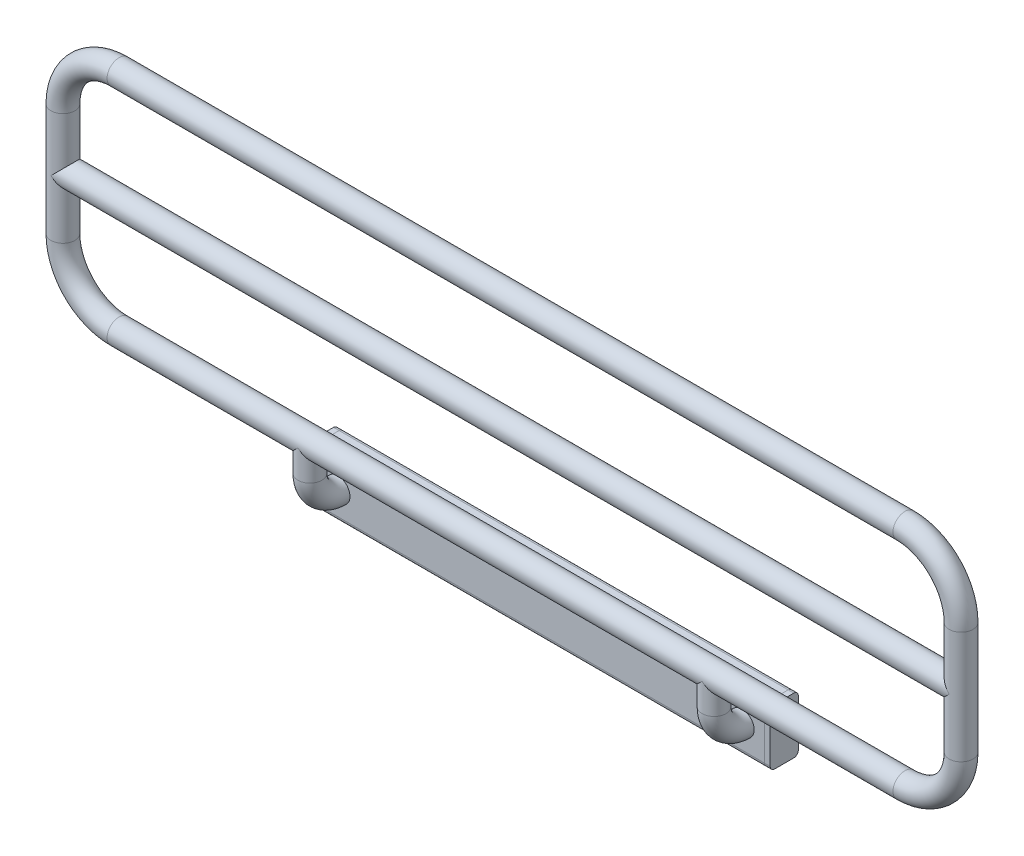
ISO-10303-21;
HEADER;
FILE_DESCRIPTION(('STEP AP214'),'2;1');
FILE_NAME('part.step','',(''),(''),'','','');
FILE_SCHEMA(('AUTOMOTIVE_DESIGN { 1 0 10303 214 1 1 1 1 }'));
ENDSEC;
DATA;
#1=APPLICATION_CONTEXT('core data for automotive mechanical design processes');
#2=APPLICATION_PROTOCOL_DEFINITION('international standard','automotive_design',2000,#1);
#3=PRODUCT_CONTEXT('',#1,'mechanical');
#4=PRODUCT('Part','Part','',(#3));
#5=PRODUCT_RELATED_PRODUCT_CATEGORY('part','',(#4));
#6=PRODUCT_DEFINITION_FORMATION('','',#4);
#7=PRODUCT_DEFINITION_CONTEXT('part definition',#1,'design');
#8=PRODUCT_DEFINITION('design','',#6,#7);
#9=PRODUCT_DEFINITION_SHAPE('','',#8);
#10=(LENGTH_UNIT() NAMED_UNIT(*) SI_UNIT(.MILLI.,.METRE.));
#11=(NAMED_UNIT(*) PLANE_ANGLE_UNIT() SI_UNIT($,.RADIAN.));
#12=(NAMED_UNIT(*) SI_UNIT($,.STERADIAN.) SOLID_ANGLE_UNIT());
#13=UNCERTAINTY_MEASURE_WITH_UNIT(LENGTH_MEASURE(1.E-05),#10,'distance_accuracy_value','');
#14=(GEOMETRIC_REPRESENTATION_CONTEXT(3) GLOBAL_UNCERTAINTY_ASSIGNED_CONTEXT((#13)) GLOBAL_UNIT_ASSIGNED_CONTEXT((#10,
#11,#12)) REPRESENTATION_CONTEXT('',''));
#15=CARTESIAN_POINT('',(0.,0.,0.));
#16=DIRECTION('',(0.,0.,1.));
#17=DIRECTION('',(1.,0.,0.));
#18=AXIS2_PLACEMENT_3D('',#15,#16,#17);
#19=CARTESIAN_POINT('',(-205.,-21.,21.));
#20=DIRECTION('',(1.,0.,0.));
#21=DIRECTION('',(0.,0.,1.));
#22=AXIS2_PLACEMENT_3D('',#19,#20,#21);
#23=CYLINDRICAL_SURFACE('',#22,4.);
#24=CARTESIAN_POINT('',(-200.,-21.,21.));
#25=DIRECTION('',(1.,0.,0.));
#26=DIRECTION('',(0.,0.,-1.));
#27=AXIS2_PLACEMENT_3D('',#24,#25,#26);
#28=CIRCLE('',#27,4.);
#29=CARTESIAN_POINT('',(-200.,-21.,25.));
#30=VERTEX_POINT('',#29);
#31=CARTESIAN_POINT('',(-200.,-25.,21.));
#32=VERTEX_POINT('',#31);
#33=EDGE_CURVE('E152',#30,#32,#28,.T.);
#34=ORIENTED_EDGE('',*,*,#33,.F.);
#35=DIRECTION('',(1.,0.,0.));
#36=VECTOR('',#35,1.);
#37=CARTESIAN_POINT('',(-205.,-21.,25.));
#38=LINE('',#37,#36);
#39=CARTESIAN_POINT('',(-205.,-21.,25.));
#40=VERTEX_POINT('',#39);
#41=EDGE_CURVE('E151',#40,#30,#38,.T.);
#42=ORIENTED_EDGE('',*,*,#41,.F.);
#43=CARTESIAN_POINT('',(-205.,-21.,21.));
#44=DIRECTION('',(1.,0.,0.));
#45=DIRECTION('',(0.,0.,-1.));
#46=AXIS2_PLACEMENT_3D('',#43,#44,#45);
#47=CIRCLE('',#46,4.);
#48=CARTESIAN_POINT('',(-205.,-25.,21.));
#49=VERTEX_POINT('',#48);
#50=EDGE_CURVE('E170',#40,#49,#47,.T.);
#51=ORIENTED_EDGE('',*,*,#50,.T.);
#52=DIRECTION('',(1.,0.,0.));
#53=VECTOR('',#52,1.);
#54=CARTESIAN_POINT('',(-205.,-25.,21.));
#55=LINE('',#54,#53);
#56=EDGE_CURVE('E13',#49,#32,#55,.T.);
#57=ORIENTED_EDGE('',*,*,#56,.T.);
#58=EDGE_LOOP('',(#34,#42,#51,#57));
#59=FACE_BOUND('',#58,.T.);
#60=ADVANCED_FACE('F56',(#59),#23,.T.);
#61=CARTESIAN_POINT('',(-205.,-25.,21.));
#62=DIRECTION('',(0.,1.,0.));
#63=DIRECTION('',(0.,0.,1.));
#64=AXIS2_PLACEMENT_3D('',#61,#62,#63);
#65=PLANE('',#64);
#66=DIRECTION('',(0.,0.,-1.));
#67=VECTOR('',#66,1.);
#68=CARTESIAN_POINT('',(-200.,-25.,21.));
#69=LINE('',#68,#67);
#70=CARTESIAN_POINT('',(-200.,-25.,4.00000000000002));
#71=VERTEX_POINT('',#70);
#72=EDGE_CURVE('E154',#32,#71,#69,.T.);
#73=ORIENTED_EDGE('',*,*,#72,.F.);
#74=ORIENTED_EDGE('',*,*,#56,.F.);
#75=DIRECTION('',(0.,0.,-1.));
#76=VECTOR('',#75,1.);
#77=CARTESIAN_POINT('',(-205.,-25.,21.));
#78=LINE('',#77,#76);
#79=CARTESIAN_POINT('',(-205.,-25.,4.00000000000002));
#80=VERTEX_POINT('',#79);
#81=EDGE_CURVE('E110',#49,#80,#78,.T.);
#82=ORIENTED_EDGE('',*,*,#81,.T.);
#83=DIRECTION('',(1.,0.,0.));
#84=VECTOR('',#83,1.);
#85=CARTESIAN_POINT('',(-205.,-25.,4.00000000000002));
#86=LINE('',#85,#84);
#87=EDGE_CURVE('E64',#80,#71,#86,.T.);
#88=ORIENTED_EDGE('',*,*,#87,.T.);
#89=EDGE_LOOP('',(#73,#74,#82,#88));
#90=FACE_BOUND('',#89,.T.);
#91=ADVANCED_FACE('F182',(#90),#65,.F.);
#92=CARTESIAN_POINT('',(-205.,-21.,3.99999999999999));
#93=DIRECTION('',(1.,0.,0.));
#94=DIRECTION('',(0.,0.,1.));
#95=AXIS2_PLACEMENT_3D('',#92,#93,#94);
#96=CYLINDRICAL_SURFACE('',#95,4.);
#97=CARTESIAN_POINT('',(-200.,-21.,3.99999999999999));
#98=DIRECTION('',(1.,0.,0.));
#99=DIRECTION('',(0.,0.,-1.));
#100=AXIS2_PLACEMENT_3D('',#97,#98,#99);
#101=CIRCLE('',#100,4.);
#102=CARTESIAN_POINT('',(-200.,-21.,0.));
#103=VERTEX_POINT('',#102);
#104=EDGE_CURVE('E157',#71,#103,#101,.T.);
#105=ORIENTED_EDGE('',*,*,#104,.F.);
#106=ORIENTED_EDGE('',*,*,#87,.F.);
#107=CARTESIAN_POINT('',(-205.,-21.,3.99999999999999));
#108=DIRECTION('',(1.,0.,0.));
#109=DIRECTION('',(0.,0.,-1.));
#110=AXIS2_PLACEMENT_3D('',#107,#108,#109);
#111=CIRCLE('',#110,4.);
#112=CARTESIAN_POINT('',(-205.,-21.,0.));
#113=VERTEX_POINT('',#112);
#114=EDGE_CURVE('E191',#80,#113,#111,.T.);
#115=ORIENTED_EDGE('',*,*,#114,.T.);
#116=DIRECTION('',(1.,0.,0.));
#117=VECTOR('',#116,1.);
#118=CARTESIAN_POINT('',(-205.,-21.,0.));
#119=LINE('',#118,#117);
#120=EDGE_CURVE('E177',#113,#103,#119,.T.);
#121=ORIENTED_EDGE('',*,*,#120,.T.);
#122=EDGE_LOOP('',(#105,#106,#115,#121));
#123=FACE_BOUND('',#122,.T.);
#124=ADVANCED_FACE('F201',(#123),#96,.T.);
#125=CARTESIAN_POINT('',(-205.,-21.,0.));
#126=DIRECTION('',(0.,0.,1.));
#127=DIRECTION('',(0.,-1.,0.));
#128=AXIS2_PLACEMENT_3D('',#125,#126,#127);
#129=PLANE('',#128);
#130=DIRECTION('',(0.,1.,0.));
#131=VECTOR('',#130,1.);
#132=CARTESIAN_POINT('',(-200.,-21.,0.));
#133=LINE('',#132,#131);
#134=CARTESIAN_POINT('',(-200.,21.,0.));
#135=VERTEX_POINT('',#134);
#136=EDGE_CURVE('E160',#103,#135,#133,.T.);
#137=ORIENTED_EDGE('',*,*,#136,.F.);
#138=ORIENTED_EDGE('',*,*,#120,.F.);
#139=DIRECTION('',(0.,1.,0.));
#140=VECTOR('',#139,1.);
#141=CARTESIAN_POINT('',(-205.,-21.,0.));
#142=LINE('',#141,#140);
#143=CARTESIAN_POINT('',(-205.,21.,0.));
#144=VERTEX_POINT('',#143);
#145=EDGE_CURVE('E146',#113,#144,#142,.T.);
#146=ORIENTED_EDGE('',*,*,#145,.T.);
#147=DIRECTION('',(1.,0.,0.));
#148=VECTOR('',#147,1.);
#149=CARTESIAN_POINT('',(-205.,21.,0.));
#150=LINE('',#149,#148);
#151=EDGE_CURVE('E174',#144,#135,#150,.T.);
#152=ORIENTED_EDGE('',*,*,#151,.T.);
#153=EDGE_LOOP('',(#137,#138,#146,#152));
#154=FACE_BOUND('',#153,.T.);
#155=ADVANCED_FACE('F197',(#154),#129,.F.);
#156=CARTESIAN_POINT('',(-205.,21.,3.99999999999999));
#157=DIRECTION('',(1.,0.,0.));
#158=DIRECTION('',(0.,0.,1.));
#159=AXIS2_PLACEMENT_3D('',#156,#157,#158);
#160=CYLINDRICAL_SURFACE('',#159,4.);
#161=CARTESIAN_POINT('',(-200.,21.,3.99999999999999));
#162=DIRECTION('',(1.,0.,0.));
#163=DIRECTION('',(0.,0.,-1.));
#164=AXIS2_PLACEMENT_3D('',#161,#162,#163);
#165=CIRCLE('',#164,4.);
#166=CARTESIAN_POINT('',(-200.,25.,4.00000000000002));
#167=VERTEX_POINT('',#166);
#168=EDGE_CURVE('E163',#135,#167,#165,.T.);
#169=ORIENTED_EDGE('',*,*,#168,.F.);
#170=ORIENTED_EDGE('',*,*,#151,.F.);
#171=CARTESIAN_POINT('',(-205.,21.,3.99999999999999));
#172=DIRECTION('',(1.,0.,0.));
#173=DIRECTION('',(0.,0.,-1.));
#174=AXIS2_PLACEMENT_3D('',#171,#172,#173);
#175=CIRCLE('',#174,4.);
#176=CARTESIAN_POINT('',(-205.,25.,4.00000000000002));
#177=VERTEX_POINT('',#176);
#178=EDGE_CURVE('E144',#144,#177,#175,.T.);
#179=ORIENTED_EDGE('',*,*,#178,.T.);
#180=DIRECTION('',(1.,0.,0.));
#181=VECTOR('',#180,1.);
#182=CARTESIAN_POINT('',(-205.,25.,4.00000000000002));
#183=LINE('',#182,#181);
#184=EDGE_CURVE('E138',#177,#167,#183,.T.);
#185=ORIENTED_EDGE('',*,*,#184,.T.);
#186=EDGE_LOOP('',(#169,#170,#179,#185));
#187=FACE_BOUND('',#186,.T.);
#188=ADVANCED_FACE('F200',(#187),#160,.T.);
#189=CARTESIAN_POINT('',(-205.,25.,4.00000000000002));
#190=DIRECTION('',(0.,-1.,0.));
#191=DIRECTION('',(0.,0.,-1.));
#192=AXIS2_PLACEMENT_3D('',#189,#190,#191);
#193=PLANE('',#192);
#194=DIRECTION('',(0.,0.,1.));
#195=VECTOR('',#194,1.);
#196=CARTESIAN_POINT('',(-200.,25.,4.00000000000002));
#197=LINE('',#196,#195);
#198=CARTESIAN_POINT('',(-200.,25.,21.));
#199=VERTEX_POINT('',#198);
#200=EDGE_CURVE('E166',#167,#199,#197,.T.);
#201=ORIENTED_EDGE('',*,*,#200,.F.);
#202=ORIENTED_EDGE('',*,*,#184,.F.);
#203=DIRECTION('',(0.,0.,1.));
#204=VECTOR('',#203,1.);
#205=CARTESIAN_POINT('',(-205.,25.,4.00000000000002));
#206=LINE('',#205,#204);
#207=CARTESIAN_POINT('',(-205.,25.,21.));
#208=VERTEX_POINT('',#207);
#209=EDGE_CURVE('E128',#177,#208,#206,.T.);
#210=ORIENTED_EDGE('',*,*,#209,.T.);
#211=DIRECTION('',(1.,0.,0.));
#212=VECTOR('',#211,1.);
#213=CARTESIAN_POINT('',(-205.,25.,21.));
#214=LINE('',#213,#212);
#215=EDGE_CURVE('E133',#208,#199,#214,.T.);
#216=ORIENTED_EDGE('',*,*,#215,.T.);
#217=EDGE_LOOP('',(#201,#202,#210,#216));
#218=FACE_BOUND('',#217,.T.);
#219=ADVANCED_FACE('F141',(#218),#193,.F.);
#220=CARTESIAN_POINT('',(-205.,21.,21.));
#221=DIRECTION('',(1.,0.,0.));
#222=DIRECTION('',(0.,0.,1.));
#223=AXIS2_PLACEMENT_3D('',#220,#221,#222);
#224=CYLINDRICAL_SURFACE('',#223,4.);
#225=CARTESIAN_POINT('',(-200.,21.,21.));
#226=DIRECTION('',(1.,0.,0.));
#227=DIRECTION('',(0.,0.,-1.));
#228=AXIS2_PLACEMENT_3D('',#225,#226,#227);
#229=CIRCLE('',#228,4.);
#230=CARTESIAN_POINT('',(-200.,21.,25.));
#231=VERTEX_POINT('',#230);
#232=EDGE_CURVE('E135',#199,#231,#229,.T.);
#233=ORIENTED_EDGE('',*,*,#232,.F.);
#234=ORIENTED_EDGE('',*,*,#215,.F.);
#235=CARTESIAN_POINT('',(-205.,21.,21.));
#236=DIRECTION('',(1.,0.,0.));
#237=DIRECTION('',(0.,0.,-1.));
#238=AXIS2_PLACEMENT_3D('',#235,#236,#237);
#239=CIRCLE('',#238,4.);
#240=CARTESIAN_POINT('',(-205.,21.,25.));
#241=VERTEX_POINT('',#240);
#242=EDGE_CURVE('E124',#208,#241,#239,.T.);
#243=ORIENTED_EDGE('',*,*,#242,.T.);
#244=DIRECTION('',(1.,0.,0.));
#245=VECTOR('',#244,1.);
#246=CARTESIAN_POINT('',(-205.,21.,25.));
#247=LINE('',#246,#245);
#248=EDGE_CURVE('E139',#241,#231,#247,.T.);
#249=ORIENTED_EDGE('',*,*,#248,.T.);
#250=EDGE_LOOP('',(#233,#234,#243,#249));
#251=FACE_BOUND('',#250,.T.);
#252=ADVANCED_FACE('F134',(#251),#224,.T.);
#253=CARTESIAN_POINT('',(-205.,21.,25.));
#254=DIRECTION('',(0.,0.,-1.));
#255=DIRECTION('',(0.,1.,0.));
#256=AXIS2_PLACEMENT_3D('',#253,#254,#255);
#257=PLANE('',#256);
#258=DIRECTION('',(0.,-1.,0.));
#259=VECTOR('',#258,1.);
#260=CARTESIAN_POINT('',(-200.,21.,25.));
#261=LINE('',#260,#259);
#262=EDGE_CURVE('E98',#231,#30,#261,.T.);
#263=ORIENTED_EDGE('',*,*,#262,.F.);
#264=ORIENTED_EDGE('',*,*,#248,.F.);
#265=DIRECTION('',(0.,-1.,0.));
#266=VECTOR('',#265,1.);
#267=CARTESIAN_POINT('',(-205.,21.,25.));
#268=LINE('',#267,#266);
#269=EDGE_CURVE('E72',#241,#40,#268,.T.);
#270=ORIENTED_EDGE('',*,*,#269,.T.);
#271=ORIENTED_EDGE('',*,*,#41,.T.);
#272=EDGE_LOOP('',(#263,#264,#270,#271));
#273=FACE_BOUND('',#272,.T.);
#274=ADVANCED_FACE('F252',(#273),#257,.F.);
#275=CARTESIAN_POINT('',(-205.,-21.,21.));
#276=DIRECTION('',(-1.,0.,0.));
#277=DIRECTION('',(0.,0.,-1.));
#278=AXIS2_PLACEMENT_3D('',#275,#276,#277);
#279=PLANE('',#278);
#280=ORIENTED_EDGE('',*,*,#50,.F.);
#281=ORIENTED_EDGE('',*,*,#269,.F.);
#282=ORIENTED_EDGE('',*,*,#242,.F.);
#283=ORIENTED_EDGE('',*,*,#209,.F.);
#284=ORIENTED_EDGE('',*,*,#178,.F.);
#285=ORIENTED_EDGE('',*,*,#145,.F.);
#286=ORIENTED_EDGE('',*,*,#114,.F.);
#287=ORIENTED_EDGE('',*,*,#81,.F.);
#288=EDGE_LOOP('',(#280,#281,#282,#283,#284,#285,#286,#287));
#289=FACE_BOUND('',#288,.T.);
#290=ADVANCED_FACE('F126',(#289),#279,.T.);
#291=CARTESIAN_POINT('',(-200.,-21.,21.));
#292=DIRECTION('',(-1.,0.,0.));
#293=DIRECTION('',(0.,0.,-1.));
#294=AXIS2_PLACEMENT_3D('',#291,#292,#293);
#295=PLANE('',#294);
#296=ORIENTED_EDGE('',*,*,#33,.T.);
#297=ORIENTED_EDGE('',*,*,#72,.T.);
#298=ORIENTED_EDGE('',*,*,#104,.T.);
#299=ORIENTED_EDGE('',*,*,#136,.T.);
#300=ORIENTED_EDGE('',*,*,#168,.T.);
#301=ORIENTED_EDGE('',*,*,#200,.T.);
#302=ORIENTED_EDGE('',*,*,#232,.T.);
#303=ORIENTED_EDGE('',*,*,#262,.T.);
#304=EDGE_LOOP('',(#296,#297,#298,#299,#300,#301,#302,#303));
#305=FACE_BOUND('',#304,.T.);
#306=ADVANCED_FACE('F185',(#305),#295,.F.);
#307=CLOSED_SHELL('',(#60,#91,#124,#155,#188,#219,#252,#274,#290,#306));
#308=MANIFOLD_SOLID_BREP('B2',#307);
#309=CARTESIAN_POINT('',(205.,-21.,21.));
#310=DIRECTION('',(-1.,0.,0.));
#311=DIRECTION('',(0.,0.,1.));
#312=AXIS2_PLACEMENT_3D('',#309,#310,#311);
#313=CYLINDRICAL_SURFACE('',#312,4.);
#314=CARTESIAN_POINT('',(200.,-21.,21.));
#315=DIRECTION('',(1.,0.,0.));
#316=DIRECTION('',(0.,0.,-1.));
#317=AXIS2_PLACEMENT_3D('',#314,#315,#316);
#318=CIRCLE('',#317,4.);
#319=CARTESIAN_POINT('',(200.,-21.,25.));
#320=VERTEX_POINT('',#319);
#321=CARTESIAN_POINT('',(200.,-25.,21.));
#322=VERTEX_POINT('',#321);
#323=EDGE_CURVE('E422',#320,#322,#318,.T.);
#324=ORIENTED_EDGE('',*,*,#323,.T.);
#325=DIRECTION('',(-1.,0.,0.));
#326=VECTOR('',#325,1.);
#327=CARTESIAN_POINT('',(205.,-25.,21.));
#328=LINE('',#327,#326);
#329=CARTESIAN_POINT('',(205.,-25.,21.));
#330=VERTEX_POINT('',#329);
#331=EDGE_CURVE('E54',#330,#322,#328,.T.);
#332=ORIENTED_EDGE('',*,*,#331,.F.);
#333=CARTESIAN_POINT('',(205.,-21.,21.));
#334=DIRECTION('',(1.,0.,0.));
#335=DIRECTION('',(0.,0.,-1.));
#336=AXIS2_PLACEMENT_3D('',#333,#334,#335);
#337=CIRCLE('',#336,4.);
#338=CARTESIAN_POINT('',(205.,-21.,25.));
#339=VERTEX_POINT('',#338);
#340=EDGE_CURVE('E436',#339,#330,#337,.T.);
#341=ORIENTED_EDGE('',*,*,#340,.F.);
#342=DIRECTION('',(-1.,0.,0.));
#343=VECTOR('',#342,1.);
#344=CARTESIAN_POINT('',(205.,-21.,25.));
#345=LINE('',#344,#343);
#346=EDGE_CURVE('E418',#339,#320,#345,.T.);
#347=ORIENTED_EDGE('',*,*,#346,.T.);
#348=EDGE_LOOP('',(#324,#332,#341,#347));
#349=FACE_BOUND('',#348,.T.);
#350=ADVANCED_FACE('F326',(#349),#313,.T.);
#351=CARTESIAN_POINT('',(205.,-25.,21.));
#352=DIRECTION('',(0.,1.,0.));
#353=DIRECTION('',(0.,0.,1.));
#354=AXIS2_PLACEMENT_3D('',#351,#352,#353);
#355=PLANE('',#354);
#356=DIRECTION('',(0.,0.,-1.));
#357=VECTOR('',#356,1.);
#358=CARTESIAN_POINT('',(200.,-25.,21.));
#359=LINE('',#358,#357);
#360=CARTESIAN_POINT('',(200.,-25.,4.00000000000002));
#361=VERTEX_POINT('',#360);
#362=EDGE_CURVE('E425',#322,#361,#359,.T.);
#363=ORIENTED_EDGE('',*,*,#362,.T.);
#364=DIRECTION('',(-1.,0.,0.));
#365=VECTOR('',#364,1.);
#366=CARTESIAN_POINT('',(205.,-25.,4.00000000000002));
#367=LINE('',#366,#365);
#368=CARTESIAN_POINT('',(205.,-25.,4.00000000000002));
#369=VERTEX_POINT('',#368);
#370=EDGE_CURVE('E334',#369,#361,#367,.T.);
#371=ORIENTED_EDGE('',*,*,#370,.F.);
#372=DIRECTION('',(0.,0.,-1.));
#373=VECTOR('',#372,1.);
#374=CARTESIAN_POINT('',(205.,-25.,21.));
#375=LINE('',#374,#373);
#376=EDGE_CURVE('E385',#330,#369,#375,.T.);
#377=ORIENTED_EDGE('',*,*,#376,.F.);
#378=ORIENTED_EDGE('',*,*,#331,.T.);
#379=EDGE_LOOP('',(#363,#371,#377,#378));
#380=FACE_BOUND('',#379,.T.);
#381=ADVANCED_FACE('F471',(#380),#355,.F.);
#382=CARTESIAN_POINT('',(205.,-21.,3.99999999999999));
#383=DIRECTION('',(-1.,0.,0.));
#384=DIRECTION('',(0.,0.,1.));
#385=AXIS2_PLACEMENT_3D('',#382,#383,#384);
#386=CYLINDRICAL_SURFACE('',#385,4.);
#387=CARTESIAN_POINT('',(200.,-21.,3.99999999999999));
#388=DIRECTION('',(1.,0.,0.));
#389=DIRECTION('',(0.,0.,-1.));
#390=AXIS2_PLACEMENT_3D('',#387,#388,#389);
#391=CIRCLE('',#390,4.);
#392=CARTESIAN_POINT('',(200.,-21.,0.));
#393=VERTEX_POINT('',#392);
#394=EDGE_CURVE('E427',#361,#393,#391,.T.);
#395=ORIENTED_EDGE('',*,*,#394,.T.);
#396=DIRECTION('',(-1.,0.,0.));
#397=VECTOR('',#396,1.);
#398=CARTESIAN_POINT('',(205.,-21.,0.));
#399=LINE('',#398,#397);
#400=CARTESIAN_POINT('',(205.,-21.,0.));
#401=VERTEX_POINT('',#400);
#402=EDGE_CURVE('E443',#401,#393,#399,.T.);
#403=ORIENTED_EDGE('',*,*,#402,.F.);
#404=CARTESIAN_POINT('',(205.,-21.,3.99999999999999));
#405=DIRECTION('',(1.,0.,0.));
#406=DIRECTION('',(0.,0.,-1.));
#407=AXIS2_PLACEMENT_3D('',#404,#405,#406);
#408=CIRCLE('',#407,4.);
#409=EDGE_CURVE('E451',#369,#401,#408,.T.);
#410=ORIENTED_EDGE('',*,*,#409,.F.);
#411=ORIENTED_EDGE('',*,*,#370,.T.);
#412=EDGE_LOOP('',(#395,#403,#410,#411));
#413=FACE_BOUND('',#412,.T.);
#414=ADVANCED_FACE('F449',(#413),#386,.T.);
#415=CARTESIAN_POINT('',(205.,-21.,0.));
#416=DIRECTION('',(0.,0.,1.));
#417=DIRECTION('',(0.,-1.,0.));
#418=AXIS2_PLACEMENT_3D('',#415,#416,#417);
#419=PLANE('',#418);
#420=DIRECTION('',(0.,1.,0.));
#421=VECTOR('',#420,1.);
#422=CARTESIAN_POINT('',(200.,-21.,0.));
#423=LINE('',#422,#421);
#424=CARTESIAN_POINT('',(200.,21.,0.));
#425=VERTEX_POINT('',#424);
#426=EDGE_CURVE('E429',#393,#425,#423,.T.);
#427=ORIENTED_EDGE('',*,*,#426,.T.);
#428=DIRECTION('',(-1.,0.,0.));
#429=VECTOR('',#428,1.);
#430=CARTESIAN_POINT('',(205.,21.,0.));
#431=LINE('',#430,#429);
#432=CARTESIAN_POINT('',(205.,21.,0.));
#433=VERTEX_POINT('',#432);
#434=EDGE_CURVE('E440',#433,#425,#431,.T.);
#435=ORIENTED_EDGE('',*,*,#434,.F.);
#436=DIRECTION('',(0.,1.,0.));
#437=VECTOR('',#436,1.);
#438=CARTESIAN_POINT('',(205.,-21.,0.));
#439=LINE('',#438,#437);
#440=EDGE_CURVE('E463',#401,#433,#439,.T.);
#441=ORIENTED_EDGE('',*,*,#440,.F.);
#442=ORIENTED_EDGE('',*,*,#402,.T.);
#443=EDGE_LOOP('',(#427,#435,#441,#442));
#444=FACE_BOUND('',#443,.T.);
#445=ADVANCED_FACE('F459',(#444),#419,.F.);
#446=CARTESIAN_POINT('',(205.,21.,3.99999999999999));
#447=DIRECTION('',(-1.,0.,0.));
#448=DIRECTION('',(0.,0.,1.));
#449=AXIS2_PLACEMENT_3D('',#446,#447,#448);
#450=CYLINDRICAL_SURFACE('',#449,4.);
#451=CARTESIAN_POINT('',(200.,21.,3.99999999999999));
#452=DIRECTION('',(1.,0.,0.));
#453=DIRECTION('',(0.,0.,-1.));
#454=AXIS2_PLACEMENT_3D('',#451,#452,#453);
#455=CIRCLE('',#454,4.);
#456=CARTESIAN_POINT('',(200.,25.,4.00000000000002));
#457=VERTEX_POINT('',#456);
#458=EDGE_CURVE('E431',#425,#457,#455,.T.);
#459=ORIENTED_EDGE('',*,*,#458,.T.);
#460=DIRECTION('',(-1.,0.,0.));
#461=VECTOR('',#460,1.);
#462=CARTESIAN_POINT('',(205.,25.,4.00000000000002));
#463=LINE('',#462,#461);
#464=CARTESIAN_POINT('',(205.,25.,4.00000000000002));
#465=VERTEX_POINT('',#464);
#466=EDGE_CURVE('E413',#465,#457,#463,.T.);
#467=ORIENTED_EDGE('',*,*,#466,.F.);
#468=CARTESIAN_POINT('',(205.,21.,3.99999999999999));
#469=DIRECTION('',(1.,0.,0.));
#470=DIRECTION('',(0.,0.,-1.));
#471=AXIS2_PLACEMENT_3D('',#468,#469,#470);
#472=CIRCLE('',#471,4.);
#473=EDGE_CURVE('E404',#433,#465,#472,.T.);
#474=ORIENTED_EDGE('',*,*,#473,.F.);
#475=ORIENTED_EDGE('',*,*,#434,.T.);
#476=EDGE_LOOP('',(#459,#467,#474,#475));
#477=FACE_BOUND('',#476,.T.);
#478=ADVANCED_FACE('F462',(#477),#450,.T.);
#479=CARTESIAN_POINT('',(205.,25.,4.00000000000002));
#480=DIRECTION('',(0.,-1.,0.));
#481=DIRECTION('',(0.,0.,-1.));
#482=AXIS2_PLACEMENT_3D('',#479,#480,#481);
#483=PLANE('',#482);
#484=DIRECTION('',(0.,0.,1.));
#485=VECTOR('',#484,1.);
#486=CARTESIAN_POINT('',(200.,25.,4.00000000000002));
#487=LINE('',#486,#485);
#488=CARTESIAN_POINT('',(200.,25.,21.));
#489=VERTEX_POINT('',#488);
#490=EDGE_CURVE('E412',#457,#489,#487,.T.);
#491=ORIENTED_EDGE('',*,*,#490,.T.);
#492=DIRECTION('',(-1.,0.,0.));
#493=VECTOR('',#492,1.);
#494=CARTESIAN_POINT('',(205.,25.,21.));
#495=LINE('',#494,#493);
#496=CARTESIAN_POINT('',(205.,25.,21.));
#497=VERTEX_POINT('',#496);
#498=EDGE_CURVE('E409',#497,#489,#495,.T.);
#499=ORIENTED_EDGE('',*,*,#498,.F.);
#500=DIRECTION('',(0.,0.,1.));
#501=VECTOR('',#500,1.);
#502=CARTESIAN_POINT('',(205.,25.,4.00000000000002));
#503=LINE('',#502,#501);
#504=EDGE_CURVE('E398',#465,#497,#503,.T.);
#505=ORIENTED_EDGE('',*,*,#504,.F.);
#506=ORIENTED_EDGE('',*,*,#466,.T.);
#507=EDGE_LOOP('',(#491,#499,#505,#506));
#508=FACE_BOUND('',#507,.T.);
#509=ADVANCED_FACE('F410',(#508),#483,.F.);
#510=CARTESIAN_POINT('',(205.,21.,21.));
#511=DIRECTION('',(-1.,0.,0.));
#512=DIRECTION('',(0.,0.,1.));
#513=AXIS2_PLACEMENT_3D('',#510,#511,#512);
#514=CYLINDRICAL_SURFACE('',#513,4.);
#515=CARTESIAN_POINT('',(200.,21.,21.));
#516=DIRECTION('',(1.,0.,0.));
#517=DIRECTION('',(0.,0.,-1.));
#518=AXIS2_PLACEMENT_3D('',#515,#516,#517);
#519=CIRCLE('',#518,4.);
#520=CARTESIAN_POINT('',(200.,21.,25.));
#521=VERTEX_POINT('',#520);
#522=EDGE_CURVE('E371',#489,#521,#519,.T.);
#523=ORIENTED_EDGE('',*,*,#522,.T.);
#524=DIRECTION('',(-1.,0.,0.));
#525=VECTOR('',#524,1.);
#526=CARTESIAN_POINT('',(205.,21.,25.));
#527=LINE('',#526,#525);
#528=CARTESIAN_POINT('',(205.,21.,25.));
#529=VERTEX_POINT('',#528);
#530=EDGE_CURVE('E414',#529,#521,#527,.T.);
#531=ORIENTED_EDGE('',*,*,#530,.F.);
#532=CARTESIAN_POINT('',(205.,21.,21.));
#533=DIRECTION('',(1.,0.,0.));
#534=DIRECTION('',(0.,0.,-1.));
#535=AXIS2_PLACEMENT_3D('',#532,#533,#534);
#536=CIRCLE('',#535,4.);
#537=EDGE_CURVE('E402',#497,#529,#536,.T.);
#538=ORIENTED_EDGE('',*,*,#537,.F.);
#539=ORIENTED_EDGE('',*,*,#498,.T.);
#540=EDGE_LOOP('',(#523,#531,#538,#539));
#541=FACE_BOUND('',#540,.T.);
#542=ADVANCED_FACE('F416',(#541),#514,.T.);
#543=CARTESIAN_POINT('',(205.,21.,25.));
#544=DIRECTION('',(0.,0.,-1.));
#545=DIRECTION('',(0.,1.,0.));
#546=AXIS2_PLACEMENT_3D('',#543,#544,#545);
#547=PLANE('',#546);
#548=DIRECTION('',(0.,-1.,0.));
#549=VECTOR('',#548,1.);
#550=CARTESIAN_POINT('',(200.,21.,25.));
#551=LINE('',#550,#549);
#552=EDGE_CURVE('E377',#521,#320,#551,.T.);
#553=ORIENTED_EDGE('',*,*,#552,.T.);
#554=ORIENTED_EDGE('',*,*,#346,.F.);
#555=DIRECTION('',(0.,-1.,0.));
#556=VECTOR('',#555,1.);
#557=CARTESIAN_POINT('',(205.,21.,25.));
#558=LINE('',#557,#556);
#559=EDGE_CURVE('E342',#529,#339,#558,.T.);
#560=ORIENTED_EDGE('',*,*,#559,.F.);
#561=ORIENTED_EDGE('',*,*,#530,.T.);
#562=EDGE_LOOP('',(#553,#554,#560,#561));
#563=FACE_BOUND('',#562,.T.);
#564=ADVANCED_FACE('F487',(#563),#547,.F.);
#565=CARTESIAN_POINT('',(205.,-21.,21.));
#566=DIRECTION('',(1.,0.,0.));
#567=DIRECTION('',(0.,0.,-1.));
#568=AXIS2_PLACEMENT_3D('',#565,#566,#567);
#569=PLANE('',#568);
#570=ORIENTED_EDGE('',*,*,#340,.T.);
#571=ORIENTED_EDGE('',*,*,#376,.T.);
#572=ORIENTED_EDGE('',*,*,#409,.T.);
#573=ORIENTED_EDGE('',*,*,#440,.T.);
#574=ORIENTED_EDGE('',*,*,#473,.T.);
#575=ORIENTED_EDGE('',*,*,#504,.T.);
#576=ORIENTED_EDGE('',*,*,#537,.T.);
#577=ORIENTED_EDGE('',*,*,#559,.T.);
#578=EDGE_LOOP('',(#570,#571,#572,#573,#574,#575,#576,#577));
#579=FACE_BOUND('',#578,.T.);
#580=ADVANCED_FACE('F400',(#579),#569,.T.);
#581=CARTESIAN_POINT('',(200.,-21.,21.));
#582=DIRECTION('',(1.,0.,0.));
#583=DIRECTION('',(0.,0.,-1.));
#584=AXIS2_PLACEMENT_3D('',#581,#582,#583);
#585=PLANE('',#584);
#586=ORIENTED_EDGE('',*,*,#323,.F.);
#587=ORIENTED_EDGE('',*,*,#552,.F.);
#588=ORIENTED_EDGE('',*,*,#522,.F.);
#589=ORIENTED_EDGE('',*,*,#490,.F.);
#590=ORIENTED_EDGE('',*,*,#458,.F.);
#591=ORIENTED_EDGE('',*,*,#426,.F.);
#592=ORIENTED_EDGE('',*,*,#394,.F.);
#593=ORIENTED_EDGE('',*,*,#362,.F.);
#594=EDGE_LOOP('',(#586,#587,#588,#589,#590,#591,#592,#593));
#595=FACE_BOUND('',#594,.T.);
#596=ADVANCED_FACE('F455',(#595),#585,.F.);
#597=CLOSED_SHELL('',(#350,#381,#414,#445,#478,#509,#542,#564,#580,#596));
#598=MANIFOLD_SOLID_BREP('B7',#597);
#599=CARTESIAN_POINT('',(200.,-21.,21.));
#600=DIRECTION('',(1.,0.,0.));
#601=DIRECTION('',(0.,0.,-1.));
#602=AXIS2_PLACEMENT_3D('',#599,#600,#601);
#603=PLANE('',#602);
#604=CARTESIAN_POINT('',(200.,-21.,21.));
#605=DIRECTION('',(1.,0.,0.));
#606=DIRECTION('',(0.,0.,-1.));
#607=AXIS2_PLACEMENT_3D('',#604,#605,#606);
#608=CIRCLE('',#607,4.);
#609=CARTESIAN_POINT('',(200.,-21.,25.));
#610=VERTEX_POINT('',#609);
#611=CARTESIAN_POINT('',(200.,-25.,21.));
#612=VERTEX_POINT('',#611);
#613=EDGE_CURVE('E740',#610,#612,#608,.T.);
#614=ORIENTED_EDGE('',*,*,#613,.T.);
#615=DIRECTION('',(0.,0.,-1.));
#616=VECTOR('',#615,1.);
#617=CARTESIAN_POINT('',(200.,-25.,21.));
#618=LINE('',#617,#616);
#619=CARTESIAN_POINT('',(200.,-25.,4.00000000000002));
#620=VERTEX_POINT('',#619);
#621=EDGE_CURVE('E743',#612,#620,#618,.T.);
#622=ORIENTED_EDGE('',*,*,#621,.T.);
#623=CARTESIAN_POINT('',(200.,-21.,3.99999999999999));
#624=DIRECTION('',(1.,0.,0.));
#625=DIRECTION('',(0.,0.,-1.));
#626=AXIS2_PLACEMENT_3D('',#623,#624,#625);
#627=CIRCLE('',#626,4.);
#628=CARTESIAN_POINT('',(200.,-21.,0.));
#629=VERTEX_POINT('',#628);
#630=EDGE_CURVE('E746',#620,#629,#627,.T.);
#631=ORIENTED_EDGE('',*,*,#630,.T.);
#632=DIRECTION('',(0.,1.,0.));
#633=VECTOR('',#632,1.);
#634=CARTESIAN_POINT('',(200.,21.,0.));
#635=LINE('',#634,#633);
#636=CARTESIAN_POINT('',(200.,21.,0.));
#637=VERTEX_POINT('',#636);
#638=EDGE_CURVE('E748',#629,#637,#635,.T.);
#639=ORIENTED_EDGE('',*,*,#638,.T.);
#640=CARTESIAN_POINT('',(200.,21.,3.99999999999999));
#641=DIRECTION('',(1.,0.,0.));
#642=DIRECTION('',(0.,0.,1.));
#643=AXIS2_PLACEMENT_3D('',#640,#641,#642);
#644=CIRCLE('',#643,4.);
#645=CARTESIAN_POINT('',(200.,25.,4.00000000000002));
#646=VERTEX_POINT('',#645);
#647=EDGE_CURVE('E750',#637,#646,#644,.T.);
#648=ORIENTED_EDGE('',*,*,#647,.T.);
#649=DIRECTION('',(0.,0.,1.));
#650=VECTOR('',#649,1.);
#651=CARTESIAN_POINT('',(200.,25.,21.));
#652=LINE('',#651,#650);
#653=CARTESIAN_POINT('',(200.,25.,21.));
#654=VERTEX_POINT('',#653);
#655=EDGE_CURVE('E752',#646,#654,#652,.T.);
#656=ORIENTED_EDGE('',*,*,#655,.T.);
#657=CARTESIAN_POINT('',(200.,21.,21.));
#658=DIRECTION('',(1.,0.,0.));
#659=DIRECTION('',(0.,0.,-1.));
#660=AXIS2_PLACEMENT_3D('',#657,#658,#659);
#661=CIRCLE('',#660,4.);
#662=CARTESIAN_POINT('',(200.,21.,25.));
#663=VERTEX_POINT('',#662);
#664=EDGE_CURVE('E754',#654,#663,#661,.T.);
#665=ORIENTED_EDGE('',*,*,#664,.T.);
#666=DIRECTION('',(0.,-1.,0.));
#667=VECTOR('',#666,1.);
#668=CARTESIAN_POINT('',(200.,21.,25.));
#669=LINE('',#668,#667);
#670=EDGE_CURVE('E756',#663,#610,#669,.T.);
#671=ORIENTED_EDGE('',*,*,#670,.T.);
#672=EDGE_LOOP('',(#614,#622,#631,#639,#648,#656,#665,#671));
#673=FACE_BOUND('',#672,.T.);
#674=DIRECTION('',(0.,0.,-1.));
#675=VECTOR('',#674,1.);
#676=CARTESIAN_POINT('',(200.,-23.,21.));
#677=LINE('',#676,#675);
#678=CARTESIAN_POINT('',(200.,-23.,21.));
#679=VERTEX_POINT('',#678);
#680=CARTESIAN_POINT('',(200.,-23.,4.00000000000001));
#681=VERTEX_POINT('',#680);
#682=EDGE_CURVE('E683',#679,#681,#677,.T.);
#683=ORIENTED_EDGE('',*,*,#682,.F.);
#684=CARTESIAN_POINT('',(200.,-21.,21.));
#685=DIRECTION('',(1.,0.,0.));
#686=DIRECTION('',(0.,0.,-1.));
#687=AXIS2_PLACEMENT_3D('',#684,#685,#686);
#688=CIRCLE('',#687,2.);
#689=CARTESIAN_POINT('',(200.,-21.,23.));
#690=VERTEX_POINT('',#689);
#691=EDGE_CURVE('E675',#690,#679,#688,.T.);
#692=ORIENTED_EDGE('',*,*,#691,.F.);
#693=DIRECTION('',(0.,-1.,0.));
#694=VECTOR('',#693,1.);
#695=CARTESIAN_POINT('',(200.,21.,23.));
#696=LINE('',#695,#694);
#697=CARTESIAN_POINT('',(200.,21.,23.));
#698=VERTEX_POINT('',#697);
#699=EDGE_CURVE('E708',#698,#690,#696,.T.);
#700=ORIENTED_EDGE('',*,*,#699,.F.);
#701=CARTESIAN_POINT('',(200.,21.,21.));
#702=DIRECTION('',(1.,0.,0.));
#703=DIRECTION('',(0.,0.,-1.));
#704=AXIS2_PLACEMENT_3D('',#701,#702,#703);
#705=CIRCLE('',#704,2.);
#706=CARTESIAN_POINT('',(200.,23.,21.));
#707=VERTEX_POINT('',#706);
#708=EDGE_CURVE('E706',#707,#698,#705,.T.);
#709=ORIENTED_EDGE('',*,*,#708,.F.);
#710=DIRECTION('',(0.,0.,1.));
#711=VECTOR('',#710,1.);
#712=CARTESIAN_POINT('',(200.,23.,21.));
#713=LINE('',#712,#711);
#714=CARTESIAN_POINT('',(200.,23.,4.00000000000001));
#715=VERTEX_POINT('',#714);
#716=EDGE_CURVE('E704',#715,#707,#713,.T.);
#717=ORIENTED_EDGE('',*,*,#716,.F.);
#718=CARTESIAN_POINT('',(200.,21.,3.99999999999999));
#719=DIRECTION('',(1.,0.,0.));
#720=DIRECTION('',(0.,0.,1.));
#721=AXIS2_PLACEMENT_3D('',#718,#719,#720);
#722=CIRCLE('',#721,2.);
#723=CARTESIAN_POINT('',(200.,21.,1.99999999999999));
#724=VERTEX_POINT('',#723);
#725=EDGE_CURVE('E702',#724,#715,#722,.T.);
#726=ORIENTED_EDGE('',*,*,#725,.F.);
#727=DIRECTION('',(0.,1.,0.));
#728=VECTOR('',#727,1.);
#729=CARTESIAN_POINT('',(200.,21.,1.99999999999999));
#730=LINE('',#729,#728);
#731=CARTESIAN_POINT('',(200.,-21.,1.99999999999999));
#732=VERTEX_POINT('',#731);
#733=EDGE_CURVE('E698',#732,#724,#730,.T.);
#734=ORIENTED_EDGE('',*,*,#733,.F.);
#735=CARTESIAN_POINT('',(200.,-21.,3.99999999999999));
#736=DIRECTION('',(1.,0.,0.));
#737=DIRECTION('',(0.,0.,-1.));
#738=AXIS2_PLACEMENT_3D('',#735,#736,#737);
#739=CIRCLE('',#738,2.);
#740=EDGE_CURVE('E696',#681,#732,#739,.T.);
#741=ORIENTED_EDGE('',*,*,#740,.F.);
#742=EDGE_LOOP('',(#683,#692,#700,#709,#717,#726,#734,#741));
#743=FACE_BOUND('',#742,.T.);
#744=ADVANCED_FACE('F562',(#673,#743),#603,.T.);
#745=CARTESIAN_POINT('',(-200.,-21.,21.));
#746=DIRECTION('',(1.,0.,0.));
#747=DIRECTION('',(0.,0.,-1.));
#748=AXIS2_PLACEMENT_3D('',#745,#746,#747);
#749=PLANE('',#748);
#750=CARTESIAN_POINT('',(-200.,-21.,21.));
#751=DIRECTION('',(1.,0.,0.));
#752=DIRECTION('',(0.,0.,-1.));
#753=AXIS2_PLACEMENT_3D('',#750,#751,#752);
#754=CIRCLE('',#753,4.);
#755=CARTESIAN_POINT('',(-200.,-21.,25.));
#756=VERTEX_POINT('',#755);
#757=CARTESIAN_POINT('',(-200.,-25.,21.));
#758=VERTEX_POINT('',#757);
#759=EDGE_CURVE('E691',#756,#758,#754,.T.);
#760=ORIENTED_EDGE('',*,*,#759,.F.);
#761=DIRECTION('',(0.,-1.,0.));
#762=VECTOR('',#761,1.);
#763=CARTESIAN_POINT('',(-200.,21.,25.));
#764=LINE('',#763,#762);
#765=CARTESIAN_POINT('',(-200.,21.,25.));
#766=VERTEX_POINT('',#765);
#767=EDGE_CURVE('E744',#766,#756,#764,.T.);
#768=ORIENTED_EDGE('',*,*,#767,.F.);
#769=CARTESIAN_POINT('',(-200.,21.,21.));
#770=DIRECTION('',(1.,0.,0.));
#771=DIRECTION('',(0.,0.,-1.));
#772=AXIS2_PLACEMENT_3D('',#769,#770,#771);
#773=CIRCLE('',#772,4.);
#774=CARTESIAN_POINT('',(-200.,25.,21.));
#775=VERTEX_POINT('',#774);
#776=EDGE_CURVE('E771',#775,#766,#773,.T.);
#777=ORIENTED_EDGE('',*,*,#776,.F.);
#778=DIRECTION('',(0.,0.,1.));
#779=VECTOR('',#778,1.);
#780=CARTESIAN_POINT('',(-200.,25.,21.));
#781=LINE('',#780,#779);
#782=CARTESIAN_POINT('',(-200.,25.,4.00000000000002));
#783=VERTEX_POINT('',#782);
#784=EDGE_CURVE('E769',#783,#775,#781,.T.);
#785=ORIENTED_EDGE('',*,*,#784,.F.);
#786=CARTESIAN_POINT('',(-200.,21.,3.99999999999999));
#787=DIRECTION('',(1.,0.,0.));
#788=DIRECTION('',(0.,0.,1.));
#789=AXIS2_PLACEMENT_3D('',#786,#787,#788);
#790=CIRCLE('',#789,4.);
#791=CARTESIAN_POINT('',(-200.,21.,0.));
#792=VERTEX_POINT('',#791);
#793=EDGE_CURVE('E767',#792,#783,#790,.T.);
#794=ORIENTED_EDGE('',*,*,#793,.F.);
#795=DIRECTION('',(0.,1.,0.));
#796=VECTOR('',#795,1.);
#797=CARTESIAN_POINT('',(-200.,21.,0.));
#798=LINE('',#797,#796);
#799=CARTESIAN_POINT('',(-200.,-21.,0.));
#800=VERTEX_POINT('',#799);
#801=EDGE_CURVE('E765',#800,#792,#798,.T.);
#802=ORIENTED_EDGE('',*,*,#801,.F.);
#803=CARTESIAN_POINT('',(-200.,-21.,3.99999999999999));
#804=DIRECTION('',(1.,0.,0.));
#805=DIRECTION('',(0.,0.,-1.));
#806=AXIS2_PLACEMENT_3D('',#803,#804,#805);
#807=CIRCLE('',#806,4.);
#808=CARTESIAN_POINT('',(-200.,-25.,4.00000000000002));
#809=VERTEX_POINT('',#808);
#810=EDGE_CURVE('E763',#809,#800,#807,.T.);
#811=ORIENTED_EDGE('',*,*,#810,.F.);
#812=DIRECTION('',(0.,0.,-1.));
#813=VECTOR('',#812,1.);
#814=CARTESIAN_POINT('',(-200.,-25.,21.));
#815=LINE('',#814,#813);
#816=EDGE_CURVE('E761',#758,#809,#815,.T.);
#817=ORIENTED_EDGE('',*,*,#816,.F.);
#818=EDGE_LOOP('',(#760,#768,#777,#785,#794,#802,#811,#817));
#819=FACE_BOUND('',#818,.T.);
#820=CARTESIAN_POINT('',(-200.,-21.,21.));
#821=DIRECTION('',(1.,0.,0.));
#822=DIRECTION('',(0.,0.,-1.));
#823=AXIS2_PLACEMENT_3D('',#820,#821,#822);
#824=CIRCLE('',#823,2.);
#825=CARTESIAN_POINT('',(-200.,-21.,23.));
#826=VERTEX_POINT('',#825);
#827=CARTESIAN_POINT('',(-200.,-23.,21.));
#828=VERTEX_POINT('',#827);
#829=EDGE_CURVE('E585',#826,#828,#824,.T.);
#830=ORIENTED_EDGE('',*,*,#829,.T.);
#831=DIRECTION('',(0.,0.,-1.));
#832=VECTOR('',#831,1.);
#833=CARTESIAN_POINT('',(-200.,-23.,21.));
#834=LINE('',#833,#832);
#835=CARTESIAN_POINT('',(-200.,-23.,4.00000000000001));
#836=VERTEX_POINT('',#835);
#837=EDGE_CURVE('E690',#828,#836,#834,.T.);
#838=ORIENTED_EDGE('',*,*,#837,.T.);
#839=CARTESIAN_POINT('',(-200.,-21.,3.99999999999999));
#840=DIRECTION('',(1.,0.,0.));
#841=DIRECTION('',(0.,0.,-1.));
#842=AXIS2_PLACEMENT_3D('',#839,#840,#841);
#843=CIRCLE('',#842,2.);
#844=CARTESIAN_POINT('',(-200.,-21.,1.99999999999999));
#845=VERTEX_POINT('',#844);
#846=EDGE_CURVE('E712',#836,#845,#843,.T.);
#847=ORIENTED_EDGE('',*,*,#846,.T.);
#848=DIRECTION('',(0.,1.,0.));
#849=VECTOR('',#848,1.);
#850=CARTESIAN_POINT('',(-200.,21.,1.99999999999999));
#851=LINE('',#850,#849);
#852=CARTESIAN_POINT('',(-200.,21.,1.99999999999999));
#853=VERTEX_POINT('',#852);
#854=EDGE_CURVE('E715',#845,#853,#851,.T.);
#855=ORIENTED_EDGE('',*,*,#854,.T.);
#856=CARTESIAN_POINT('',(-200.,21.,3.99999999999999));
#857=DIRECTION('',(1.,0.,0.));
#858=DIRECTION('',(0.,0.,1.));
#859=AXIS2_PLACEMENT_3D('',#856,#857,#858);
#860=CIRCLE('',#859,2.);
#861=CARTESIAN_POINT('',(-200.,23.,4.00000000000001));
#862=VERTEX_POINT('',#861);
#863=EDGE_CURVE('E718',#853,#862,#860,.T.);
#864=ORIENTED_EDGE('',*,*,#863,.T.);
#865=DIRECTION('',(0.,0.,1.));
#866=VECTOR('',#865,1.);
#867=CARTESIAN_POINT('',(-200.,23.,21.));
#868=LINE('',#867,#866);
#869=CARTESIAN_POINT('',(-200.,23.,21.));
#870=VERTEX_POINT('',#869);
#871=EDGE_CURVE('E721',#862,#870,#868,.T.);
#872=ORIENTED_EDGE('',*,*,#871,.T.);
#873=CARTESIAN_POINT('',(-200.,21.,21.));
#874=DIRECTION('',(1.,0.,0.));
#875=DIRECTION('',(0.,0.,-1.));
#876=AXIS2_PLACEMENT_3D('',#873,#874,#875);
#877=CIRCLE('',#876,2.);
#878=CARTESIAN_POINT('',(-200.,21.,23.));
#879=VERTEX_POINT('',#878);
#880=EDGE_CURVE('E724',#870,#879,#877,.T.);
#881=ORIENTED_EDGE('',*,*,#880,.T.);
#882=DIRECTION('',(0.,-1.,0.));
#883=VECTOR('',#882,1.);
#884=CARTESIAN_POINT('',(-200.,21.,23.));
#885=LINE('',#884,#883);
#886=EDGE_CURVE('E684',#879,#826,#885,.T.);
#887=ORIENTED_EDGE('',*,*,#886,.T.);
#888=EDGE_LOOP('',(#830,#838,#847,#855,#864,#872,#881,#887));
#889=FACE_BOUND('',#888,.T.);
#890=ADVANCED_FACE('F801',(#819,#889),#749,.F.);
#891=CARTESIAN_POINT('',(200.,-21.,21.));
#892=DIRECTION('',(-1.,0.,0.));
#893=DIRECTION('',(0.,0.,1.));
#894=AXIS2_PLACEMENT_3D('',#891,#892,#893);
#895=CYLINDRICAL_SURFACE('',#894,4.);
#896=ORIENTED_EDGE('',*,*,#759,.T.);
#897=DIRECTION('',(-1.,0.,0.));
#898=VECTOR('',#897,1.);
#899=CARTESIAN_POINT('',(200.,-25.,21.));
#900=LINE('',#899,#898);
#901=EDGE_CURVE('E324',#612,#758,#900,.T.);
#902=ORIENTED_EDGE('',*,*,#901,.F.);
#903=ORIENTED_EDGE('',*,*,#613,.F.);
#904=DIRECTION('',(-1.,0.,0.));
#905=VECTOR('',#904,1.);
#906=CARTESIAN_POINT('',(200.,-21.,25.));
#907=LINE('',#906,#905);
#908=EDGE_CURVE('E758',#610,#756,#907,.T.);
#909=ORIENTED_EDGE('',*,*,#908,.T.);
#910=EDGE_LOOP('',(#896,#902,#903,#909));
#911=FACE_BOUND('',#910,.T.);
#912=ADVANCED_FACE('F564',(#911),#895,.T.);
#913=CARTESIAN_POINT('',(200.,-25.,21.));
#914=DIRECTION('',(0.,1.,0.));
#915=DIRECTION('',(0.,0.,1.));
#916=AXIS2_PLACEMENT_3D('',#913,#914,#915);
#917=PLANE('',#916);
#918=ORIENTED_EDGE('',*,*,#816,.T.);
#919=DIRECTION('',(-1.,0.,0.));
#920=VECTOR('',#919,1.);
#921=CARTESIAN_POINT('',(200.,-25.,4.00000000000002));
#922=LINE('',#921,#920);
#923=EDGE_CURVE('E570',#620,#809,#922,.T.);
#924=ORIENTED_EDGE('',*,*,#923,.F.);
#925=ORIENTED_EDGE('',*,*,#621,.F.);
#926=ORIENTED_EDGE('',*,*,#901,.T.);
#927=EDGE_LOOP('',(#918,#924,#925,#926));
#928=FACE_BOUND('',#927,.T.);
#929=ADVANCED_FACE('F818',(#928),#917,.F.);
#930=CARTESIAN_POINT('',(200.,-21.,3.99999999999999));
#931=DIRECTION('',(-1.,0.,0.));
#932=DIRECTION('',(0.,0.,1.));
#933=AXIS2_PLACEMENT_3D('',#930,#931,#932);
#934=CYLINDRICAL_SURFACE('',#933,4.);
#935=ORIENTED_EDGE('',*,*,#810,.T.);
#936=DIRECTION('',(-1.,0.,0.));
#937=VECTOR('',#936,1.);
#938=CARTESIAN_POINT('',(200.,-21.,0.));
#939=LINE('',#938,#937);
#940=EDGE_CURVE('E788',#629,#800,#939,.T.);
#941=ORIENTED_EDGE('',*,*,#940,.F.);
#942=ORIENTED_EDGE('',*,*,#630,.F.);
#943=ORIENTED_EDGE('',*,*,#923,.T.);
#944=EDGE_LOOP('',(#935,#941,#942,#943));
#945=FACE_BOUND('',#944,.T.);
#946=ADVANCED_FACE('F795',(#945),#934,.T.);
#947=CARTESIAN_POINT('',(200.,21.,0.));
#948=DIRECTION('',(0.,0.,1.));
#949=DIRECTION('',(0.,-1.,0.));
#950=AXIS2_PLACEMENT_3D('',#947,#948,#949);
#951=PLANE('',#950);
#952=ORIENTED_EDGE('',*,*,#801,.T.);
#953=DIRECTION('',(-1.,0.,0.));
#954=VECTOR('',#953,1.);
#955=CARTESIAN_POINT('',(200.,21.,0.));
#956=LINE('',#955,#954);
#957=EDGE_CURVE('E785',#637,#792,#956,.T.);
#958=ORIENTED_EDGE('',*,*,#957,.F.);
#959=ORIENTED_EDGE('',*,*,#638,.F.);
#960=ORIENTED_EDGE('',*,*,#940,.T.);
#961=EDGE_LOOP('',(#952,#958,#959,#960));
#962=FACE_BOUND('',#961,.T.);
#963=ADVANCED_FACE('F807',(#962),#951,.F.);
#964=CARTESIAN_POINT('',(200.,21.,3.99999999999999));
#965=DIRECTION('',(-1.,0.,0.));
#966=DIRECTION('',(0.,0.,1.));
#967=AXIS2_PLACEMENT_3D('',#964,#965,#966);
#968=CYLINDRICAL_SURFACE('',#967,4.);
#969=ORIENTED_EDGE('',*,*,#793,.T.);
#970=DIRECTION('',(-1.,0.,0.));
#971=VECTOR('',#970,1.);
#972=CARTESIAN_POINT('',(200.,25.,4.00000000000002));
#973=LINE('',#972,#971);
#974=EDGE_CURVE('E782',#646,#783,#973,.T.);
#975=ORIENTED_EDGE('',*,*,#974,.F.);
#976=ORIENTED_EDGE('',*,*,#647,.F.);
#977=ORIENTED_EDGE('',*,*,#957,.T.);
#978=EDGE_LOOP('',(#969,#975,#976,#977));
#979=FACE_BOUND('',#978,.T.);
#980=ADVANCED_FACE('F811',(#979),#968,.T.);
#981=CARTESIAN_POINT('',(200.,25.,21.));
#982=DIRECTION('',(0.,-1.,0.));
#983=DIRECTION('',(0.,0.,-1.));
#984=AXIS2_PLACEMENT_3D('',#981,#982,#983);
#985=PLANE('',#984);
#986=ORIENTED_EDGE('',*,*,#784,.T.);
#987=DIRECTION('',(-1.,0.,0.));
#988=VECTOR('',#987,1.);
#989=CARTESIAN_POINT('',(200.,25.,21.));
#990=LINE('',#989,#988);
#991=EDGE_CURVE('E779',#654,#775,#990,.T.);
#992=ORIENTED_EDGE('',*,*,#991,.F.);
#993=ORIENTED_EDGE('',*,*,#655,.F.);
#994=ORIENTED_EDGE('',*,*,#974,.T.);
#995=EDGE_LOOP('',(#986,#992,#993,#994));
#996=FACE_BOUND('',#995,.T.);
#997=ADVANCED_FACE('F831',(#996),#985,.F.);
#998=CARTESIAN_POINT('',(200.,21.,21.));
#999=DIRECTION('',(-1.,0.,0.));
#1000=DIRECTION('',(0.,0.,1.));
#1001=AXIS2_PLACEMENT_3D('',#998,#999,#1000);
#1002=CYLINDRICAL_SURFACE('',#1001,4.);
#1003=ORIENTED_EDGE('',*,*,#776,.T.);
#1004=DIRECTION('',(-1.,0.,0.));
#1005=VECTOR('',#1004,1.);
#1006=CARTESIAN_POINT('',(200.,21.,25.));
#1007=LINE('',#1006,#1005);
#1008=EDGE_CURVE('E776',#663,#766,#1007,.T.);
#1009=ORIENTED_EDGE('',*,*,#1008,.F.);
#1010=ORIENTED_EDGE('',*,*,#664,.F.);
#1011=ORIENTED_EDGE('',*,*,#991,.T.);
#1012=EDGE_LOOP('',(#1003,#1009,#1010,#1011));
#1013=FACE_BOUND('',#1012,.T.);
#1014=ADVANCED_FACE('F829',(#1013),#1002,.T.);
#1015=CARTESIAN_POINT('',(200.,21.,25.));
#1016=DIRECTION('',(0.,0.,-1.));
#1017=DIRECTION('',(0.,1.,0.));
#1018=AXIS2_PLACEMENT_3D('',#1015,#1016,#1017);
#1019=PLANE('',#1018);
#1020=ORIENTED_EDGE('',*,*,#767,.T.);
#1021=ORIENTED_EDGE('',*,*,#908,.F.);
#1022=ORIENTED_EDGE('',*,*,#670,.F.);
#1023=ORIENTED_EDGE('',*,*,#1008,.T.);
#1024=EDGE_LOOP('',(#1020,#1021,#1022,#1023));
#1025=FACE_BOUND('',#1024,.T.);
#1026=ADVANCED_FACE('F824',(#1025),#1019,.F.);
#1027=CARTESIAN_POINT('',(200.,-21.,21.));
#1028=DIRECTION('',(-1.,0.,0.));
#1029=DIRECTION('',(0.,0.,1.));
#1030=AXIS2_PLACEMENT_3D('',#1027,#1028,#1029);
#1031=CYLINDRICAL_SURFACE('',#1030,2.);
#1032=ORIENTED_EDGE('',*,*,#829,.F.);
#1033=DIRECTION('',(-1.,0.,0.));
#1034=VECTOR('',#1033,1.);
#1035=CARTESIAN_POINT('',(200.,-21.,23.));
#1036=LINE('',#1035,#1034);
#1037=EDGE_CURVE('E679',#690,#826,#1036,.T.);
#1038=ORIENTED_EDGE('',*,*,#1037,.F.);
#1039=ORIENTED_EDGE('',*,*,#691,.T.);
#1040=DIRECTION('',(-1.,0.,0.));
#1041=VECTOR('',#1040,1.);
#1042=CARTESIAN_POINT('',(200.,-23.,21.));
#1043=LINE('',#1042,#1041);
#1044=EDGE_CURVE('E678',#679,#828,#1043,.T.);
#1045=ORIENTED_EDGE('',*,*,#1044,.T.);
#1046=EDGE_LOOP('',(#1032,#1038,#1039,#1045));
#1047=FACE_BOUND('',#1046,.T.);
#1048=ADVANCED_FACE('F677',(#1047),#1031,.F.);
#1049=CARTESIAN_POINT('',(200.,-23.,21.));
#1050=DIRECTION('',(0.,1.,0.));
#1051=DIRECTION('',(0.,0.,1.));
#1052=AXIS2_PLACEMENT_3D('',#1049,#1050,#1051);
#1053=PLANE('',#1052);
#1054=ORIENTED_EDGE('',*,*,#837,.F.);
#1055=ORIENTED_EDGE('',*,*,#1044,.F.);
#1056=ORIENTED_EDGE('',*,*,#682,.T.);
#1057=DIRECTION('',(-1.,0.,0.));
#1058=VECTOR('',#1057,1.);
#1059=CARTESIAN_POINT('',(200.,-23.,4.00000000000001));
#1060=LINE('',#1059,#1058);
#1061=EDGE_CURVE('E692',#681,#836,#1060,.T.);
#1062=ORIENTED_EDGE('',*,*,#1061,.T.);
#1063=EDGE_LOOP('',(#1054,#1055,#1056,#1062));
#1064=FACE_BOUND('',#1063,.T.);
#1065=ADVANCED_FACE('F687',(#1064),#1053,.T.);
#1066=CARTESIAN_POINT('',(200.,-21.,3.99999999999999));
#1067=DIRECTION('',(-1.,0.,0.));
#1068=DIRECTION('',(0.,0.,1.));
#1069=AXIS2_PLACEMENT_3D('',#1066,#1067,#1068);
#1070=CYLINDRICAL_SURFACE('',#1069,2.);
#1071=ORIENTED_EDGE('',*,*,#846,.F.);
#1072=ORIENTED_EDGE('',*,*,#1061,.F.);
#1073=ORIENTED_EDGE('',*,*,#740,.T.);
#1074=DIRECTION('',(-1.,0.,0.));
#1075=VECTOR('',#1074,1.);
#1076=CARTESIAN_POINT('',(200.,-21.,1.99999999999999));
#1077=LINE('',#1076,#1075);
#1078=EDGE_CURVE('E737',#732,#845,#1077,.T.);
#1079=ORIENTED_EDGE('',*,*,#1078,.T.);
#1080=EDGE_LOOP('',(#1071,#1072,#1073,#1079));
#1081=FACE_BOUND('',#1080,.T.);
#1082=ADVANCED_FACE('F856',(#1081),#1070,.F.);
#1083=CARTESIAN_POINT('',(200.,21.,1.99999999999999));
#1084=DIRECTION('',(0.,0.,1.));
#1085=DIRECTION('',(0.,-1.,0.));
#1086=AXIS2_PLACEMENT_3D('',#1083,#1084,#1085);
#1087=PLANE('',#1086);
#1088=ORIENTED_EDGE('',*,*,#854,.F.);
#1089=ORIENTED_EDGE('',*,*,#1078,.F.);
#1090=ORIENTED_EDGE('',*,*,#733,.T.);
#1091=DIRECTION('',(-1.,0.,0.));
#1092=VECTOR('',#1091,1.);
#1093=CARTESIAN_POINT('',(200.,21.,1.99999999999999));
#1094=LINE('',#1093,#1092);
#1095=EDGE_CURVE('E735',#724,#853,#1094,.T.);
#1096=ORIENTED_EDGE('',*,*,#1095,.T.);
#1097=EDGE_LOOP('',(#1088,#1089,#1090,#1096));
#1098=FACE_BOUND('',#1097,.T.);
#1099=ADVANCED_FACE('F860',(#1098),#1087,.T.);
#1100=CARTESIAN_POINT('',(200.,21.,3.99999999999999));
#1101=DIRECTION('',(-1.,0.,0.));
#1102=DIRECTION('',(0.,0.,1.));
#1103=AXIS2_PLACEMENT_3D('',#1100,#1101,#1102);
#1104=CYLINDRICAL_SURFACE('',#1103,2.);
#1105=ORIENTED_EDGE('',*,*,#863,.F.);
#1106=ORIENTED_EDGE('',*,*,#1095,.F.);
#1107=ORIENTED_EDGE('',*,*,#725,.T.);
#1108=DIRECTION('',(-1.,0.,0.));
#1109=VECTOR('',#1108,1.);
#1110=CARTESIAN_POINT('',(200.,23.,4.00000000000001));
#1111=LINE('',#1110,#1109);
#1112=EDGE_CURVE('E733',#715,#862,#1111,.T.);
#1113=ORIENTED_EDGE('',*,*,#1112,.T.);
#1114=EDGE_LOOP('',(#1105,#1106,#1107,#1113));
#1115=FACE_BOUND('',#1114,.T.);
#1116=ADVANCED_FACE('F866',(#1115),#1104,.F.);
#1117=CARTESIAN_POINT('',(200.,23.,21.));
#1118=DIRECTION('',(0.,-1.,0.));
#1119=DIRECTION('',(0.,0.,-1.));
#1120=AXIS2_PLACEMENT_3D('',#1117,#1118,#1119);
#1121=PLANE('',#1120);
#1122=ORIENTED_EDGE('',*,*,#871,.F.);
#1123=ORIENTED_EDGE('',*,*,#1112,.F.);
#1124=ORIENTED_EDGE('',*,*,#716,.T.);
#1125=DIRECTION('',(-1.,0.,0.));
#1126=VECTOR('',#1125,1.);
#1127=CARTESIAN_POINT('',(200.,23.,21.));
#1128=LINE('',#1127,#1126);
#1129=EDGE_CURVE('E731',#707,#870,#1128,.T.);
#1130=ORIENTED_EDGE('',*,*,#1129,.T.);
#1131=EDGE_LOOP('',(#1122,#1123,#1124,#1130));
#1132=FACE_BOUND('',#1131,.T.);
#1133=ADVANCED_FACE('F870',(#1132),#1121,.T.);
#1134=CARTESIAN_POINT('',(200.,21.,21.));
#1135=DIRECTION('',(-1.,0.,0.));
#1136=DIRECTION('',(0.,0.,1.));
#1137=AXIS2_PLACEMENT_3D('',#1134,#1135,#1136);
#1138=CYLINDRICAL_SURFACE('',#1137,2.);
#1139=ORIENTED_EDGE('',*,*,#880,.F.);
#1140=ORIENTED_EDGE('',*,*,#1129,.F.);
#1141=ORIENTED_EDGE('',*,*,#708,.T.);
#1142=DIRECTION('',(-1.,0.,0.));
#1143=VECTOR('',#1142,1.);
#1144=CARTESIAN_POINT('',(200.,21.,23.));
#1145=LINE('',#1144,#1143);
#1146=EDGE_CURVE('E577',#698,#879,#1145,.T.);
#1147=ORIENTED_EDGE('',*,*,#1146,.T.);
#1148=EDGE_LOOP('',(#1139,#1140,#1141,#1147));
#1149=FACE_BOUND('',#1148,.T.);
#1150=ADVANCED_FACE('F874',(#1149),#1138,.F.);
#1151=CARTESIAN_POINT('',(200.,21.,23.));
#1152=DIRECTION('',(0.,0.,-1.));
#1153=DIRECTION('',(-1.,0.,0.));
#1154=AXIS2_PLACEMENT_3D('',#1151,#1152,#1153);
#1155=PLANE('',#1154);
#1156=ORIENTED_EDGE('',*,*,#886,.F.);
#1157=ORIENTED_EDGE('',*,*,#1146,.F.);
#1158=ORIENTED_EDGE('',*,*,#699,.T.);
#1159=ORIENTED_EDGE('',*,*,#1037,.T.);
#1160=EDGE_LOOP('',(#1156,#1157,#1158,#1159));
#1161=FACE_BOUND('',#1160,.T.);
#1162=ADVANCED_FACE('F878',(#1161),#1155,.T.);
#1163=CLOSED_SHELL('',(#744,#890,#912,#929,#946,#963,#980,#997,#1014,#1026,#1048,#1065,#1082,
#1099,#1116,#1133,#1150,#1162));
#1164=MANIFOLD_SOLID_BREP('B48',#1163);
#1165=CARTESIAN_POINT('',(350.,200.,50.));
#1166=DIRECTION('',(0.,0.,1.));
#1167=DIRECTION('',(1.,0.,0.));
#1168=AXIS2_PLACEMENT_3D('',#1165,#1166,#1167);
#1169=TOROIDAL_SURFACE('',#1168,49.9999999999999,10.668);
#1170=CARTESIAN_POINT('',(400.,200.,50.));
#1171=DIRECTION('',(0.,-1.,0.));
#1172=DIRECTION('',(0.,0.,-1.));
#1173=AXIS2_PLACEMENT_3D('',#1170,#1171,#1172);
#1174=CIRCLE('',#1173,10.668);
#1175=CARTESIAN_POINT('',(410.668,200.,50.));
#1176=VERTEX_POINT('',#1175);
#1177=EDGE_CURVE('E1009',#1176,#1176,#1174,.T.);
#1178=CARTESIAN_POINT('',(350.,250.,50.));
#1179=DIRECTION('',(1.,0.,0.));
#1180=DIRECTION('',(0.,0.,-1.));
#1181=AXIS2_PLACEMENT_3D('',#1178,#1179,#1180);
#1182=CIRCLE('',#1181,10.668);
#1183=CARTESIAN_POINT('',(350.,260.668,50.));
#1184=VERTEX_POINT('',#1183);
#1185=EDGE_CURVE('E560',#1184,#1184,#1182,.T.);
#1186=CARTESIAN_POINT('',(350.,200.,50.));
#1187=DIRECTION('',(0.,0.,1.));
#1188=DIRECTION('',(1.,0.,0.));
#1189=AXIS2_PLACEMENT_3D('',#1186,#1187,#1188);
#1190=CIRCLE('',#1189,60.6679999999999);
#1191=EDGE_CURVE('',#1176,#1184,#1190,.T.);
#1192=ORIENTED_EDGE('',*,*,#1177,.F.);
#1193=ORIENTED_EDGE('',*,*,#1185,.T.);
#1194=ORIENTED_EDGE('',*,*,#1191,.T.);
#1195=ORIENTED_EDGE('',*,*,#1191,.F.);
#1196=EDGE_LOOP('',(#1192,#1194,#1193,#1195));
#1197=FACE_BOUND('',#1196,.T.);
#1198=ADVANCED_FACE('F1000',(#1197),#1169,.T.);
#1199=CARTESIAN_POINT('',(400.,100.,50.));
#1200=DIRECTION('',(0.,1.,0.));
#1201=DIRECTION('',(0.,0.,1.));
#1202=AXIS2_PLACEMENT_3D('',#1199,#1200,#1201);
#1203=CYLINDRICAL_SURFACE('',#1202,10.668);
#1204=ORIENTED_EDGE('',*,*,#1177,.T.);
#1205=EDGE_LOOP('',(#1204));
#1206=FACE_BOUND('',#1205,.T.);
#1207=CARTESIAN_POINT('',(400.,100.,50.));
#1208=DIRECTION('',(0.,-1.,0.));
#1209=DIRECTION('',(0.,0.,-1.));
#1210=AXIS2_PLACEMENT_3D('',#1207,#1208,#1209);
#1211=CIRCLE('',#1210,10.668);
#1212=CARTESIAN_POINT('',(410.668,100.,50.));
#1213=VERTEX_POINT('',#1212);
#1214=EDGE_CURVE('E1193',#1213,#1213,#1211,.T.);
#1215=ORIENTED_EDGE('',*,*,#1214,.F.);
#1216=EDGE_LOOP('',(#1215));
#1217=FACE_BOUND('',#1216,.T.);
#1218=CARTESIAN_POINT('',(400.,150.,50.));
#1219=DIRECTION('',(0.707106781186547,0.707106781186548,0.));
#1220=DIRECTION('',(0.707106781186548,-0.707106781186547,0.));
#1221=AXIS2_PLACEMENT_3D('',#1218,#1219,#1220);
#1222=ELLIPSE('',#1221,15.0868302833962,10.668);
#1223=CARTESIAN_POINT('',(400.,150.,39.332));
#1224=VERTEX_POINT('',#1223);
#1225=CARTESIAN_POINT('',(400.,150.,60.668));
#1226=VERTEX_POINT('',#1225);
#1227=EDGE_CURVE('E1248',#1224,#1226,#1222,.T.);
#1228=ORIENTED_EDGE('',*,*,#1227,.T.);
#1229=CARTESIAN_POINT('',(400.,150.,50.));
#1230=DIRECTION('',(0.707106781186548,-0.707106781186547,0.));
#1231=DIRECTION('',(0.707106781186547,0.707106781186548,0.));
#1232=AXIS2_PLACEMENT_3D('',#1229,#1230,#1231);
#1233=ELLIPSE('',#1232,15.0868302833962,10.668);
#1234=EDGE_CURVE('E1015',#1226,#1224,#1233,.T.);
#1235=ORIENTED_EDGE('',*,*,#1234,.T.);
#1236=EDGE_LOOP('',(#1228,#1235));
#1237=FACE_BOUND('',#1236,.T.);
#1238=ADVANCED_FACE('F1116',(#1206,#1217,#1237),#1203,.T.);
#1239=CARTESIAN_POINT('',(180.,50.,50.));
#1240=DIRECTION('',(1.,0.,0.));
#1241=DIRECTION('',(0.,0.,-1.));
#1242=AXIS2_PLACEMENT_3D('',#1239,#1240,#1241);
#1243=CYLINDRICAL_SURFACE('',#1242,10.668);
#1244=CARTESIAN_POINT('',(180.,42.8302229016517,42.1006));
#1245=CARTESIAN_POINT('',(179.81458976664,42.8302200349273,42.1006013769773));
#1246=CARTESIAN_POINT('',(179.629153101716,42.8229911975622,42.1071453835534));
#1247=CARTESIAN_POINT('',(179.260261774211,42.794512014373,42.1331375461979));
#1248=CARTESIAN_POINT('',(179.076807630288,42.7732580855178,42.1525889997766));
#1249=CARTESIAN_POINT('',(178.713258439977,42.7178955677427,42.2039371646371));
#1250=CARTESIAN_POINT('',(178.533171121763,42.683760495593,42.2358595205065));
#1251=CARTESIAN_POINT('',(178.177924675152,42.6043495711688,42.3114646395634));
#1252=CARTESIAN_POINT('',(178.002768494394,42.5590672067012,42.3551542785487));
#1253=CARTESIAN_POINT('',(177.660665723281,42.4599911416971,42.4528647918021));
#1254=CARTESIAN_POINT('',(177.493639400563,42.406322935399,42.5067354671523));
#1255=CARTESIAN_POINT('',(177.165757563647,42.2918845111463,42.6245039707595));
#1256=CARTESIAN_POINT('',(177.004901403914,42.231115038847,42.6884007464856));
#1257=CARTESIAN_POINT('',(176.531905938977,42.040735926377,42.8942912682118));
#1258=CARTESIAN_POINT('',(176.229092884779,41.902979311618,43.0505571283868));
#1259=CARTESIAN_POINT('',(175.765302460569,41.6744059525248,43.3284858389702));
#1260=CARTESIAN_POINT('',(175.595889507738,41.5867588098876,43.4391239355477));
#1261=CARTESIAN_POINT('',(175.26654799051,41.409774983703,43.6726243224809));
#1262=CARTESIAN_POINT('',(175.106620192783,41.320438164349,43.795487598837));
#1263=CARTESIAN_POINT('',(174.796353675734,41.141809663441,44.0532925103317));
#1264=CARTESIAN_POINT('',(174.646028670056,41.0525182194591,44.1882507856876));
#1265=CARTESIAN_POINT('',(174.355609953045,40.8757699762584,44.4698742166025));
#1266=CARTESIAN_POINT('',(174.21551626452,40.7883131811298,44.6165393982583));
#1267=CARTESIAN_POINT('',(173.919586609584,40.599911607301,44.9513993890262));
#1268=CARTESIAN_POINT('',(173.766083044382,40.4997020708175,45.1420849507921));
#1269=CARTESIAN_POINT('',(173.475840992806,40.3067751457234,45.5394613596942));
#1270=CARTESIAN_POINT('',(173.339106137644,40.2140593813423,45.7461556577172));
#1271=CARTESIAN_POINT('',(173.084322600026,40.0388876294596,46.1743149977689));
#1272=CARTESIAN_POINT('',(172.966239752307,39.9564129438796,46.3957519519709));
#1273=CARTESIAN_POINT('',(172.750390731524,39.8040846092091,46.8524011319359));
#1274=CARTESIAN_POINT('',(172.652614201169,39.7342245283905,47.0876062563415));
#1275=CARTESIAN_POINT('',(172.504930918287,39.6279229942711,47.4985856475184));
#1276=CARTESIAN_POINT('',(172.449415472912,39.5877057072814,47.6713919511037));
#1277=CARTESIAN_POINT('',(172.35008647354,39.5154534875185,48.0219921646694));
#1278=CARTESIAN_POINT('',(172.306270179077,39.483416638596,48.1997848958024));
#1279=CARTESIAN_POINT('',(172.230941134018,39.428182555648,48.5591894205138));
#1280=CARTESIAN_POINT('',(172.199420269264,39.4049794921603,48.7407986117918));
#1281=CARTESIAN_POINT('',(172.149096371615,39.3678740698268,49.1067260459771));
#1282=CARTESIAN_POINT('',(172.130293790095,39.3539720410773,49.2910443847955));
#1283=CARTESIAN_POINT('',(172.105668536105,39.335755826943,49.6614834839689));
#1284=CARTESIAN_POINT('',(172.099878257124,39.331465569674,49.8476075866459));
#1285=CARTESIAN_POINT('',(172.101465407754,39.3326408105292,50.2197678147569));
#1286=CARTESIAN_POINT('',(172.108842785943,39.338106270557,50.4058039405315));
#1287=CARTESIAN_POINT('',(172.136650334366,39.3586709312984,50.7763950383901));
#1288=CARTESIAN_POINT('',(172.15708319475,39.3737721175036,50.9609496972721));
#1289=CARTESIAN_POINT('',(172.210689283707,39.4132754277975,51.3271814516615));
#1290=CARTESIAN_POINT('',(172.243862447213,39.4376775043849,51.5088585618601));
#1291=CARTESIAN_POINT('',(172.321196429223,39.4943320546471,51.8622998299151));
#1292=CARTESIAN_POINT('',(172.364967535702,39.526305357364,52.0341946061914));
#1293=CARTESIAN_POINT('',(172.463461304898,39.5978860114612,52.3732434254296));
#1294=CARTESIAN_POINT('',(172.518187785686,39.6374960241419,52.5403957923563));
#1295=CARTESIAN_POINT('',(172.637964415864,39.7236417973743,52.869064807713));
#1296=CARTESIAN_POINT('',(172.703011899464,39.7701757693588,53.0305828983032));
#1297=CARTESIAN_POINT('',(172.842815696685,39.8694235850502,53.3474247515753));
#1298=CARTESIAN_POINT('',(172.917575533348,39.9221396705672,53.5027462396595));
#1299=CARTESIAN_POINT('',(173.172765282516,40.1004594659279,53.9917097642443));
#1300=CARTESIAN_POINT('',(173.371085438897,40.2367016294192,54.3123641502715));
#1301=CARTESIAN_POINT('',(173.806456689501,40.5269203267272,54.9172976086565));
#1302=CARTESIAN_POINT('',(174.043542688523,40.6809128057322,55.2015434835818));
#1303=CARTESIAN_POINT('',(174.449457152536,40.9335673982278,55.6249497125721));
#1304=CARTESIAN_POINT('',(174.607321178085,41.0295361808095,55.7764377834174));
#1305=CARTESIAN_POINT('',(174.934762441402,41.2224828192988,56.0656087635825));
#1306=CARTESIAN_POINT('',(175.104341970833,41.3194608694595,56.2032889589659));
#1307=CARTESIAN_POINT('',(175.454837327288,41.5121987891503,56.4645042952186));
#1308=CARTESIAN_POINT('',(175.635757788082,41.6079581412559,56.5880335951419));
#1309=CARTESIAN_POINT('',(176.008642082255,41.7956908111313,56.8203976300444));
#1310=CARTESIAN_POINT('',(176.200603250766,41.8876650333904,56.9292358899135));
#1311=CARTESIAN_POINT('',(176.554623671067,42.0465884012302,57.1106162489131));
#1312=CARTESIAN_POINT('',(176.714666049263,42.1147816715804,57.1860113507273));
#1313=CARTESIAN_POINT('',(177.041570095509,42.2452886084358,57.3266553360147));
#1314=CARTESIAN_POINT('',(177.208433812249,42.3076004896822,57.3919011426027));
#1315=CARTESIAN_POINT('',(177.548362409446,42.4243282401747,57.5114842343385));
#1316=CARTESIAN_POINT('',(177.721415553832,42.4787581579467,57.5658409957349));
#1317=CARTESIAN_POINT('',(178.073388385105,42.5777988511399,57.6630265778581));
#1318=CARTESIAN_POINT('',(178.252303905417,42.6224164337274,57.7058633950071));
#1319=CARTESIAN_POINT('',(178.581970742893,42.6927756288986,57.7725540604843));
#1320=CARTESIAN_POINT('',(178.731892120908,42.7204768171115,57.7984465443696));
#1321=CARTESIAN_POINT('',(179.034275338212,42.7670174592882,57.8416325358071));
#1322=CARTESIAN_POINT('',(179.186735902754,42.785861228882,57.8589302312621));
#1323=CARTESIAN_POINT('',(179.493179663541,42.8139499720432,57.884622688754));
#1324=CARTESIAN_POINT('',(179.647161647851,42.8232020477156,57.8930240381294));
#1325=CARTESIAN_POINT('',(179.955634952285,42.8317435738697,57.9007820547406));
#1326=CARTESIAN_POINT('',(180.110126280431,42.8310328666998,57.9001385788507));
#1327=CARTESIAN_POINT('',(180.4183756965,42.8196769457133,57.8898192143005));
#1328=CARTESIAN_POINT('',(180.572134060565,42.8090358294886,57.8801470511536));
#1329=CARTESIAN_POINT('',(180.877852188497,42.7782866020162,57.8519736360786));
#1330=CARTESIAN_POINT('',(181.029811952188,42.7581784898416,57.833472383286));
#1331=CARTESIAN_POINT('',(181.481926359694,42.6847001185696,57.7651295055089));
#1332=CARTESIAN_POINT('',(181.778087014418,42.6181860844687,57.702457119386));
#1333=CARTESIAN_POINT('',(182.466495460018,42.4276418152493,57.5159282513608));
#1334=CARTESIAN_POINT('',(182.851387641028,42.2913062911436,57.3777624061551));
#1335=CARTESIAN_POINT('',(183.402226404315,42.0657232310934,57.1320410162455));
#1336=CARTESIAN_POINT('',(183.581651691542,41.9868923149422,57.0435731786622));
#1337=CARTESIAN_POINT('',(183.931685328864,41.8244373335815,56.8543348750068));
#1338=CARTESIAN_POINT('',(184.102294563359,41.7408137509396,56.753565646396));
#1339=CARTESIAN_POINT('',(184.440046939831,41.5680391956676,56.5366761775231));
#1340=CARTESIAN_POINT('',(184.606885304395,41.4787968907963,56.4201563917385));
#1341=CARTESIAN_POINT('',(184.930836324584,41.2993870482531,56.1748405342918));
#1342=CARTESIAN_POINT('',(185.087946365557,41.2092192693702,56.0460411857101));
#1343=CARTESIAN_POINT('',(185.391962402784,41.0298319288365,55.7765470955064));
#1344=CARTESIAN_POINT('',(185.538875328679,40.940611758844,55.6358605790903));
#1345=CARTESIAN_POINT('',(185.822135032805,40.764706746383,55.3427333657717));
#1346=CARTESIAN_POINT('',(185.958481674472,40.678021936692,55.1902925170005));
#1347=CARTESIAN_POINT('',(186.219754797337,40.5088906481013,54.8741318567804));
#1348=CARTESIAN_POINT('',(186.344697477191,40.4264382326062,54.7104286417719));
#1349=CARTESIAN_POINT('',(186.582505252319,40.2672056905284,54.3719450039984));
#1350=CARTESIAN_POINT('',(186.695374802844,40.1904234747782,54.1971687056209));
#1351=CARTESIAN_POINT('',(186.908048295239,40.0440526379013,53.8370681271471));
#1352=CARTESIAN_POINT('',(187.007858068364,39.9744608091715,53.6517486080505));
#1353=CARTESIAN_POINT('',(187.1933471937,39.843937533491,53.2712457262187));
#1354=CARTESIAN_POINT('',(187.279028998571,39.7830045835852,53.0760640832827));
#1355=CARTESIAN_POINT('',(187.423246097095,39.6797210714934,52.7072087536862));
#1356=CARTESIAN_POINT('',(187.483927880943,39.6359537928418,52.5347689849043));
#1357=CARTESIAN_POINT('',(187.59358740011,39.5564927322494,52.1844061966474));
#1358=CARTESIAN_POINT('',(187.642567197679,39.5207975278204,52.006484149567));
#1359=CARTESIAN_POINT('',(187.728170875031,39.4582033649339,51.6462535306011));
#1360=CARTESIAN_POINT('',(187.764800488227,39.4313003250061,51.463947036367));
#1361=CARTESIAN_POINT('',(187.825207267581,39.3868405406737,51.0960802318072));
#1362=CARTESIAN_POINT('',(187.848984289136,39.3692839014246,50.9105198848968));
#1363=CARTESIAN_POINT('',(187.883368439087,39.3438718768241,50.5369466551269));
#1364=CARTESIAN_POINT('',(187.893935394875,39.336046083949,50.3489280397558));
#1365=CARTESIAN_POINT('',(187.901595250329,39.3303746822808,49.9724643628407));
#1366=CARTESIAN_POINT('',(187.898688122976,39.3325290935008,49.7840193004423));
#1367=CARTESIAN_POINT('',(187.879446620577,39.3467685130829,49.4081778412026));
#1368=CARTESIAN_POINT('',(187.86311086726,39.3588545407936,49.220781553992));
#1369=CARTESIAN_POINT('',(187.817271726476,39.3926816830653,48.8484975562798));
#1370=CARTESIAN_POINT('',(187.787768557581,39.4144226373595,48.6636098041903));
#1371=CARTESIAN_POINT('',(187.717692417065,39.4658677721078,48.3060710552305));
#1372=CARTESIAN_POINT('',(187.677690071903,39.495160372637,48.1332480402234));
#1373=CARTESIAN_POINT('',(187.586604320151,39.5615471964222,47.7920252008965));
#1374=CARTESIAN_POINT('',(187.535517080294,39.5986441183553,47.6236269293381));
#1375=CARTESIAN_POINT('',(187.422866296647,39.6799648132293,47.2921968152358));
#1376=CARTESIAN_POINT('',(187.361305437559,39.7241867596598,47.1291636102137));
#1377=CARTESIAN_POINT('',(187.228316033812,39.8190327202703,46.809068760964));
#1378=CARTESIAN_POINT('',(187.156883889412,39.869659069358,46.6520093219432));
#1379=CARTESIAN_POINT('',(186.91380973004,40.040469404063,46.1605305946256));
#1380=CARTESIAN_POINT('',(186.724417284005,40.1714838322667,45.8384327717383));
#1381=CARTESIAN_POINT('',(186.307015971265,40.4522144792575,45.2293878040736));
#1382=CARTESIAN_POINT('',(186.078977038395,40.6019452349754,44.942468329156));
#1383=CARTESIAN_POINT('',(185.688021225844,40.8486864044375,44.5142195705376));
#1384=CARTESIAN_POINT('',(185.536021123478,40.9425536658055,44.3609063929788));
#1385=CARTESIAN_POINT('',(185.220495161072,41.1318931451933,44.067601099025));
#1386=CARTESIAN_POINT('',(185.056967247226,41.2273656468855,43.9276113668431));
#1387=CARTESIAN_POINT('',(184.718761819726,41.4178743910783,43.6612161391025));
#1388=CARTESIAN_POINT('',(184.544077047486,41.5129103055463,43.5348196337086));
#1389=CARTESIAN_POINT('',(184.183926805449,41.7001642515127,43.2961245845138));
#1390=CARTESIAN_POINT('',(183.998463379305,41.7923828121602,43.1838233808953));
#1391=CARTESIAN_POINT('',(183.64850629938,41.9565197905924,42.9912986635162));
#1392=CARTESIAN_POINT('',(183.485633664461,42.029269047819,42.9088437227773));
#1393=CARTESIAN_POINT('',(183.152629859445,42.169169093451,42.7546455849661));
#1394=CARTESIAN_POINT('',(182.982498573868,42.2363197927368,42.6829025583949));
#1395=CARTESIAN_POINT('',(182.46206141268,42.4261343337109,42.484942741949));
#1396=CARTESIAN_POINT('',(182.100745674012,42.5376369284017,42.375456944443));
#1397=CARTESIAN_POINT('',(181.448957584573,42.6902752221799,42.2293786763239));
#1398=CARTESIAN_POINT('',(181.163589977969,42.7420640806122,42.1813679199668));
#1399=CARTESIAN_POINT('',(180.730048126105,42.7945890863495,42.1330586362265));
#1400=CARTESIAN_POINT('',(180.584626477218,42.8079043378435,42.1209066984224));
#1401=CARTESIAN_POINT('',(180.292808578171,42.8257214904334,42.1046776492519));
#1402=CARTESIAN_POINT('',(180.146412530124,42.8302251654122,42.1005989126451));
#1403=CARTESIAN_POINT('',(180.,42.8302229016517,42.1006));
#1404=B_SPLINE_CURVE_WITH_KNOTS('',3,(#1244,#1245,#1246,#1247,#1248,#1249,#1250,#1251,#1252,
#1253,#1254,#1255,#1256,#1257,#1258,#1259,#1260,#1261,#1262,#1263,#1264,#1265,#1266,#1267,#1268,
#1269,#1270,#1271,#1272,#1273,#1274,#1275,#1276,#1277,#1278,#1279,#1280,#1281,#1282,#1283,#1284,
#1285,#1286,#1287,#1288,#1289,#1290,#1291,#1292,#1293,#1294,#1295,#1296,#1297,#1298,#1299,#1300,
#1301,#1302,#1303,#1304,#1305,#1306,#1307,#1308,#1309,#1310,#1311,#1312,#1313,#1314,#1315,#1316,
#1317,#1318,#1319,#1320,#1321,#1322,#1323,#1324,#1325,#1326,#1327,#1328,#1329,#1330,#1331,#1332,
#1333,#1334,#1335,#1336,#1337,#1338,#1339,#1340,#1341,#1342,#1343,#1344,#1345,#1346,#1347,#1348,
#1349,#1350,#1351,#1352,#1353,#1354,#1355,#1356,#1357,#1358,#1359,#1360,#1361,#1362,#1363,#1364,
#1365,#1366,#1367,#1368,#1369,#1370,#1371,#1372,#1373,#1374,#1375,#1376,#1377,#1378,#1379,#1380,
#1381,#1382,#1383,#1384,#1385,#1386,#1387,#1388,#1389,#1390,#1391,#1392,#1393,#1394,#1395,#1396,
#1397,#1398,#1399,#1400,#1401,#1402,#1403),.UNSPECIFIED.,.T.,.F.,(4,2,2,2,2,2,2,2,2,2,2,2,2,2,2,
2,2,2,2,2,2,2,2,2,2,2,2,2,2,2,2,2,2,2,2,2,2,2,2,2,2,2,2,2,2,2,2,2,2,2,2,2,2,2,2,2,2,2,2,2,2,2,2,
2,2,2,2,2,2,2,2,2,2,2,2,2,2,2,2,4),(0.,0.556027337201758,1.11219677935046,1.66951597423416,
2.22716152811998,2.77714504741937,3.32707086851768,4.42612518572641,5.08722245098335,
5.74837307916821,6.41044770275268,7.07252380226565,7.8649740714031,8.65759564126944,
9.44874807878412,10.239495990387,10.796661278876,11.3536959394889,11.9103623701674,
12.4670485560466,13.0251190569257,13.5831873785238,14.1413707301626,14.699551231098,
15.2396939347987,15.7800252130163,16.3202171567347,16.8606055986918,18.0585353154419,
19.257549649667,19.9736803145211,20.6899514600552,21.4065171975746,22.1229106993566,
22.6912824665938,23.2598262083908,23.8273437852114,24.3944664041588,24.8579229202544,
25.321153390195,25.7840406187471,26.2469351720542,26.7096388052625,27.1723424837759,
28.0984296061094,29.3841997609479,30.028864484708,30.6734644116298,31.3395368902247,
32.005787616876,32.6715810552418,33.337383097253,34.0022241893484,34.6668190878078,
35.3311162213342,35.9952979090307,36.5586355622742,37.1218738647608,37.6848503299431,
38.2478331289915,38.8125238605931,39.3772157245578,39.9419655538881,40.5067060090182,
41.0455099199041,41.5845004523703,42.1233530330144,42.6624026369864,43.8455666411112,
45.0296553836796,45.7353078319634,46.4410863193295,47.1473287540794,47.8534377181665,
48.4424828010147,49.0315372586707,50.2060665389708,51.08448481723,51.5236502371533,
51.9627272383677),.UNSPECIFIED.);
#1405=CARTESIAN_POINT('',(180.,42.8302229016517,42.1006));
#1406=VERTEX_POINT('',#1405);
#1407=EDGE_CURVE('E1102',#1406,#1406,#1404,.T.);
#1408=ORIENTED_EDGE('',*,*,#1407,.F.);
#1409=EDGE_LOOP('',(#1408));
#1410=FACE_BOUND('',#1409,.T.);
#1411=ADVANCED_FACE('F1114',(#1410),#1243,.T.);
#1412=CARTESIAN_POINT('',(180.,50.,50.));
#1413=DIRECTION('',(0.,-1.,0.));
#1414=DIRECTION('',(0.,0.,-1.));
#1415=AXIS2_PLACEMENT_3D('',#1412,#1413,#1414);
#1416=CYLINDRICAL_SURFACE('',#1415,10.668);
#1417=CARTESIAN_POINT('',(180.,25.,50.));
#1418=DIRECTION('',(0.,1.,0.));
#1419=DIRECTION('',(1.,0.,0.));
#1420=AXIS2_PLACEMENT_3D('',#1417,#1418,#1419);
#1421=CIRCLE('',#1420,10.668);
#1422=CARTESIAN_POINT('',(180.,25.,60.668));
#1423=VERTEX_POINT('',#1422);
#1424=EDGE_CURVE('E1055',#1423,#1423,#1421,.T.);
#1425=ORIENTED_EDGE('',*,*,#1424,.T.);
#1426=EDGE_LOOP('',(#1425));
#1427=FACE_BOUND('',#1426,.T.);
#1428=CARTESIAN_POINT('',(180.,50.,50.));
#1429=DIRECTION('',(0.707106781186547,-0.707106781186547,0.));
#1430=DIRECTION('',(-0.707106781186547,-0.707106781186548,0.));
#1431=AXIS2_PLACEMENT_3D('',#1428,#1429,#1430);
#1432=ELLIPSE('',#1431,15.0868302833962,10.668);
#1433=CARTESIAN_POINT('',(180.,50.,39.332));
#1434=VERTEX_POINT('',#1433);
#1435=CARTESIAN_POINT('',(180.,50.,60.668));
#1436=VERTEX_POINT('',#1435);
#1437=EDGE_CURVE('E1042',#1434,#1436,#1432,.F.);
#1438=ORIENTED_EDGE('',*,*,#1437,.F.);
#1439=CARTESIAN_POINT('',(180.,50.,50.));
#1440=DIRECTION('',(-0.707106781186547,-0.707106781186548,0.));
#1441=DIRECTION('',(0.707106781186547,-0.707106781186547,0.));
#1442=AXIS2_PLACEMENT_3D('',#1439,#1440,#1441);
#1443=ELLIPSE('',#1442,15.0868302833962,10.668);
#1444=EDGE_CURVE('E1022',#1436,#1434,#1443,.F.);
#1445=ORIENTED_EDGE('',*,*,#1444,.F.);
#1446=EDGE_LOOP('',(#1438,#1445));
#1447=FACE_BOUND('',#1446,.T.);
#1448=ADVANCED_FACE('F1045',(#1427,#1447),#1416,.T.);
#1449=CARTESIAN_POINT('',(180.,50.,50.));
#1450=DIRECTION('',(0.,-1.,0.));
#1451=DIRECTION('',(0.,0.,-1.));
#1452=AXIS2_PLACEMENT_3D('',#1449,#1450,#1451);
#1453=CYLINDRICAL_SURFACE('',#1452,7.8994);
#1454=CARTESIAN_POINT('',(180.,25.,50.));
#1455=DIRECTION('',(0.,1.,0.));
#1456=DIRECTION('',(1.,0.,0.));
#1457=AXIS2_PLACEMENT_3D('',#1454,#1455,#1456);
#1458=CIRCLE('',#1457,7.8994);
#1459=CARTESIAN_POINT('',(180.,25.,57.8994));
#1460=VERTEX_POINT('',#1459);
#1461=EDGE_CURVE('E1043',#1460,#1460,#1458,.T.);
#1462=ORIENTED_EDGE('',*,*,#1461,.F.);
#1463=EDGE_LOOP('',(#1462));
#1464=FACE_BOUND('',#1463,.T.);
#1465=ORIENTED_EDGE('',*,*,#1407,.T.);
#1466=EDGE_LOOP('',(#1465));
#1467=FACE_BOUND('',#1466,.T.);
#1468=ADVANCED_FACE('F1094',(#1464,#1467),#1453,.F.);
#1469=CARTESIAN_POINT('',(180.,0.,25.));
#1470=DIRECTION('',(0.,0.,1.));
#1471=DIRECTION('',(1.,0.,0.));
#1472=AXIS2_PLACEMENT_3D('',#1469,#1470,#1471);
#1473=PLANE('',#1472);
#1474=CARTESIAN_POINT('',(180.,0.,25.));
#1475=DIRECTION('',(0.,0.,1.));
#1476=DIRECTION('',(1.,0.,0.));
#1477=AXIS2_PLACEMENT_3D('',#1474,#1475,#1476);
#1478=CIRCLE('',#1477,7.8994);
#1479=CARTESIAN_POINT('',(180.,-7.89939999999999,25.));
#1480=VERTEX_POINT('',#1479);
#1481=EDGE_CURVE('E1046',#1480,#1480,#1478,.T.);
#1482=ORIENTED_EDGE('',*,*,#1481,.T.);
#1483=EDGE_LOOP('',(#1482));
#1484=FACE_BOUND('',#1483,.T.);
#1485=CARTESIAN_POINT('',(180.,0.,25.));
#1486=DIRECTION('',(0.,0.,1.));
#1487=DIRECTION('',(1.,0.,0.));
#1488=AXIS2_PLACEMENT_3D('',#1485,#1486,#1487);
#1489=CIRCLE('',#1488,10.668);
#1490=CARTESIAN_POINT('',(180.,-10.668,25.));
#1491=VERTEX_POINT('',#1490);
#1492=EDGE_CURVE('E1049',#1491,#1491,#1489,.T.);
#1493=ORIENTED_EDGE('',*,*,#1492,.F.);
#1494=EDGE_LOOP('',(#1493));
#1495=FACE_BOUND('',#1494,.T.);
#1496=ADVANCED_FACE('F1086',(#1484,#1495),#1473,.F.);
#1497=CARTESIAN_POINT('',(180.,25.,25.));
#1498=DIRECTION('',(1.,0.,0.));
#1499=DIRECTION('',(0.,0.,-1.));
#1500=AXIS2_PLACEMENT_3D('',#1497,#1498,#1499);
#1501=TOROIDAL_SURFACE('',#1500,25.,10.668);
#1502=CARTESIAN_POINT('',(180.,25.,25.));
#1503=DIRECTION('',(1.,0.,0.));
#1504=DIRECTION('',(0.,0.,-1.));
#1505=AXIS2_PLACEMENT_3D('',#1502,#1503,#1504);
#1506=CIRCLE('',#1505,35.668);
#1507=EDGE_CURVE('',#1423,#1491,#1506,.T.);
#1508=ORIENTED_EDGE('',*,*,#1424,.F.);
#1509=ORIENTED_EDGE('',*,*,#1492,.T.);
#1510=ORIENTED_EDGE('',*,*,#1507,.T.);
#1511=ORIENTED_EDGE('',*,*,#1507,.F.);
#1512=EDGE_LOOP('',(#1508,#1510,#1509,#1511));
#1513=FACE_BOUND('',#1512,.T.);
#1514=ADVANCED_FACE('F1082',(#1513),#1501,.T.);
#1515=CARTESIAN_POINT('',(180.,25.,25.));
#1516=DIRECTION('',(1.,0.,0.));
#1517=DIRECTION('',(0.,0.,-1.));
#1518=AXIS2_PLACEMENT_3D('',#1515,#1516,#1517);
#1519=TOROIDAL_SURFACE('',#1518,25.,7.8994);
#1520=CARTESIAN_POINT('',(180.,25.,25.));
#1521=DIRECTION('',(1.,0.,0.));
#1522=DIRECTION('',(0.,0.,-1.));
#1523=AXIS2_PLACEMENT_3D('',#1520,#1521,#1522);
#1524=CIRCLE('',#1523,32.8994);
#1525=EDGE_CURVE('',#1460,#1480,#1524,.T.);
#1526=ORIENTED_EDGE('',*,*,#1461,.T.);
#1527=ORIENTED_EDGE('',*,*,#1481,.F.);
#1528=ORIENTED_EDGE('',*,*,#1525,.T.);
#1529=ORIENTED_EDGE('',*,*,#1525,.F.);
#1530=EDGE_LOOP('',(#1526,#1528,#1527,#1529));
#1531=FACE_BOUND('',#1530,.T.);
#1532=ADVANCED_FACE('F1085',(#1531),#1519,.F.);
#1533=CARTESIAN_POINT('',(-350.,200.,50.));
#1534=DIRECTION('',(0.,0.,1.));
#1535=DIRECTION('',(-1.,0.,0.));
#1536=AXIS2_PLACEMENT_3D('',#1533,#1534,#1535);
#1537=TOROIDAL_SURFACE('',#1536,49.9999999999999,10.668);
#1538=CARTESIAN_POINT('',(-350.,250.,50.));
#1539=DIRECTION('',(-1.,0.,0.));
#1540=DIRECTION('',(0.,0.,1.));
#1541=AXIS2_PLACEMENT_3D('',#1538,#1539,#1540);
#1542=CIRCLE('',#1541,10.668);
#1543=CARTESIAN_POINT('',(-350.,260.668,50.));
#1544=VERTEX_POINT('',#1543);
#1545=EDGE_CURVE('E1255',#1544,#1544,#1542,.T.);
#1546=CARTESIAN_POINT('',(-400.,200.,50.));
#1547=DIRECTION('',(0.,-1.,0.));
#1548=DIRECTION('',(0.,0.,1.));
#1549=AXIS2_PLACEMENT_3D('',#1546,#1547,#1548);
#1550=CIRCLE('',#1549,10.668);
#1551=CARTESIAN_POINT('',(-410.668,200.,50.));
#1552=VERTEX_POINT('',#1551);
#1553=EDGE_CURVE('E1259',#1552,#1552,#1550,.T.);
#1554=CARTESIAN_POINT('',(-350.,200.,50.));
#1555=DIRECTION('',(0.,0.,1.));
#1556=DIRECTION('',(-1.,0.,0.));
#1557=AXIS2_PLACEMENT_3D('',#1554,#1555,#1556);
#1558=CIRCLE('',#1557,60.6679999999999);
#1559=EDGE_CURVE('',#1544,#1552,#1558,.T.);
#1560=ORIENTED_EDGE('',*,*,#1545,.T.);
#1561=ORIENTED_EDGE('',*,*,#1553,.F.);
#1562=ORIENTED_EDGE('',*,*,#1559,.T.);
#1563=ORIENTED_EDGE('',*,*,#1559,.F.);
#1564=EDGE_LOOP('',(#1560,#1562,#1561,#1563));
#1565=FACE_BOUND('',#1564,.T.);
#1566=ADVANCED_FACE('F1090',(#1565),#1537,.T.);
#1567=CARTESIAN_POINT('',(-400.,100.,50.));
#1568=DIRECTION('',(0.,1.,0.));
#1569=DIRECTION('',(0.,0.,1.));
#1570=AXIS2_PLACEMENT_3D('',#1567,#1568,#1569);
#1571=CYLINDRICAL_SURFACE('',#1570,10.668);
#1572=ORIENTED_EDGE('',*,*,#1553,.T.);
#1573=EDGE_LOOP('',(#1572));
#1574=FACE_BOUND('',#1573,.T.);
#1575=CARTESIAN_POINT('',(-400.,100.,50.));
#1576=DIRECTION('',(0.,-1.,0.));
#1577=DIRECTION('',(0.,0.,1.));
#1578=AXIS2_PLACEMENT_3D('',#1575,#1576,#1577);
#1579=CIRCLE('',#1578,10.668);
#1580=CARTESIAN_POINT('',(-410.668,100.,50.));
#1581=VERTEX_POINT('',#1580);
#1582=EDGE_CURVE('E1267',#1581,#1581,#1579,.T.);
#1583=ORIENTED_EDGE('',*,*,#1582,.F.);
#1584=EDGE_LOOP('',(#1583));
#1585=FACE_BOUND('',#1584,.T.);
#1586=CARTESIAN_POINT('',(-400.,150.,50.));
#1587=DIRECTION('',(0.707106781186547,-0.707106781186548,0.));
#1588=DIRECTION('',(-0.707106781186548,-0.707106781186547,0.));
#1589=AXIS2_PLACEMENT_3D('',#1586,#1587,#1588);
#1590=ELLIPSE('',#1589,15.0868302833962,10.668);
#1591=CARTESIAN_POINT('',(-400.,150.,39.332));
#1592=VERTEX_POINT('',#1591);
#1593=CARTESIAN_POINT('',(-400.,150.,60.668));
#1594=VERTEX_POINT('',#1593);
#1595=EDGE_CURVE('E1059',#1592,#1594,#1590,.T.);
#1596=ORIENTED_EDGE('',*,*,#1595,.F.);
#1597=CARTESIAN_POINT('',(-400.,150.,50.));
#1598=DIRECTION('',(0.707106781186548,0.707106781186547,0.));
#1599=DIRECTION('',(-0.707106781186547,0.707106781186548,0.));
#1600=AXIS2_PLACEMENT_3D('',#1597,#1598,#1599);
#1601=ELLIPSE('',#1600,15.0868302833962,10.668);
#1602=EDGE_CURVE('E1062',#1594,#1592,#1601,.T.);
#1603=ORIENTED_EDGE('',*,*,#1602,.F.);
#1604=EDGE_LOOP('',(#1596,#1603));
#1605=FACE_BOUND('',#1604,.T.);
#1606=ADVANCED_FACE('F1228',(#1574,#1585,#1605),#1571,.T.);
#1607=CARTESIAN_POINT('',(-350.,100.,50.));
#1608=DIRECTION('',(0.,0.,1.));
#1609=DIRECTION('',(-1.,0.,0.));
#1610=AXIS2_PLACEMENT_3D('',#1607,#1608,#1609);
#1611=TOROIDAL_SURFACE('',#1610,50.,10.668);
#1612=CARTESIAN_POINT('',(-350.,50.,50.));
#1613=DIRECTION('',(1.,0.,0.));
#1614=DIRECTION('',(0.,0.,-1.));
#1615=AXIS2_PLACEMENT_3D('',#1612,#1613,#1614);
#1616=CIRCLE('',#1615,10.668);
#1617=CARTESIAN_POINT('',(-350.,39.332,50.));
#1618=VERTEX_POINT('',#1617);
#1619=EDGE_CURVE('E1271',#1618,#1618,#1616,.T.);
#1620=CARTESIAN_POINT('',(-350.,100.,50.));
#1621=DIRECTION('',(0.,0.,1.));
#1622=DIRECTION('',(-1.,0.,0.));
#1623=AXIS2_PLACEMENT_3D('',#1620,#1621,#1622);
#1624=CIRCLE('',#1623,60.668);
#1625=EDGE_CURVE('',#1581,#1618,#1624,.T.);
#1626=ORIENTED_EDGE('',*,*,#1582,.T.);
#1627=ORIENTED_EDGE('',*,*,#1619,.F.);
#1628=ORIENTED_EDGE('',*,*,#1625,.T.);
#1629=ORIENTED_EDGE('',*,*,#1625,.F.);
#1630=EDGE_LOOP('',(#1626,#1628,#1627,#1629));
#1631=FACE_BOUND('',#1630,.T.);
#1632=ADVANCED_FACE('F1225',(#1631),#1611,.T.);
#1633=CARTESIAN_POINT('',(-180.,25.,25.));
#1634=DIRECTION('',(-1.,0.,0.));
#1635=DIRECTION('',(0.,0.,-1.));
#1636=AXIS2_PLACEMENT_3D('',#1633,#1634,#1635);
#1637=TOROIDAL_SURFACE('',#1636,25.,7.8994);
#1638=CARTESIAN_POINT('',(-180.,0.,25.));
#1639=DIRECTION('',(0.,0.,-1.));
#1640=DIRECTION('',(-1.,0.,0.));
#1641=AXIS2_PLACEMENT_3D('',#1638,#1639,#1640);
#1642=CIRCLE('',#1641,7.8994);
#1643=CARTESIAN_POINT('',(-180.,-7.89939999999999,25.));
#1644=VERTEX_POINT('',#1643);
#1645=EDGE_CURVE('E1282',#1644,#1644,#1642,.T.);
#1646=CARTESIAN_POINT('',(-180.,25.,50.));
#1647=DIRECTION('',(0.,-1.,0.));
#1648=DIRECTION('',(-1.,0.,0.));
#1649=AXIS2_PLACEMENT_3D('',#1646,#1647,#1648);
#1650=CIRCLE('',#1649,7.8994);
#1651=CARTESIAN_POINT('',(-180.,25.,57.8994));
#1652=VERTEX_POINT('',#1651);
#1653=EDGE_CURVE('E1276',#1652,#1652,#1650,.T.);
#1654=CARTESIAN_POINT('',(-180.,25.,25.));
#1655=DIRECTION('',(-1.,0.,0.));
#1656=DIRECTION('',(0.,0.,-1.));
#1657=AXIS2_PLACEMENT_3D('',#1654,#1655,#1656);
#1658=CIRCLE('',#1657,32.8994);
#1659=EDGE_CURVE('',#1644,#1652,#1658,.T.);
#1660=ORIENTED_EDGE('',*,*,#1645,.T.);
#1661=ORIENTED_EDGE('',*,*,#1653,.F.);
#1662=ORIENTED_EDGE('',*,*,#1659,.T.);
#1663=ORIENTED_EDGE('',*,*,#1659,.F.);
#1664=EDGE_LOOP('',(#1660,#1662,#1661,#1663));
#1665=FACE_BOUND('',#1664,.T.);
#1666=ADVANCED_FACE('F1227',(#1665),#1637,.F.);
#1667=CARTESIAN_POINT('',(-180.,25.,25.));
#1668=DIRECTION('',(-1.,0.,0.));
#1669=DIRECTION('',(0.,0.,-1.));
#1670=AXIS2_PLACEMENT_3D('',#1667,#1668,#1669);
#1671=TOROIDAL_SURFACE('',#1670,25.,10.668);
#1672=CARTESIAN_POINT('',(-180.,0.,25.));
#1673=DIRECTION('',(0.,0.,-1.));
#1674=DIRECTION('',(-1.,0.,0.));
#1675=AXIS2_PLACEMENT_3D('',#1672,#1673,#1674);
#1676=CIRCLE('',#1675,10.668);
#1677=CARTESIAN_POINT('',(-180.,-10.668,25.));
#1678=VERTEX_POINT('',#1677);
#1679=EDGE_CURVE('E1279',#1678,#1678,#1676,.T.);
#1680=CARTESIAN_POINT('',(-180.,25.,50.));
#1681=DIRECTION('',(0.,-1.,0.));
#1682=DIRECTION('',(-1.,0.,0.));
#1683=AXIS2_PLACEMENT_3D('',#1680,#1681,#1682);
#1684=CIRCLE('',#1683,10.668);
#1685=CARTESIAN_POINT('',(-180.,25.,60.668));
#1686=VERTEX_POINT('',#1685);
#1687=EDGE_CURVE('E1288',#1686,#1686,#1684,.T.);
#1688=CARTESIAN_POINT('',(-180.,25.,25.));
#1689=DIRECTION('',(-1.,0.,0.));
#1690=DIRECTION('',(0.,0.,-1.));
#1691=AXIS2_PLACEMENT_3D('',#1688,#1689,#1690);
#1692=CIRCLE('',#1691,35.668);
#1693=EDGE_CURVE('',#1678,#1686,#1692,.T.);
#1694=ORIENTED_EDGE('',*,*,#1679,.F.);
#1695=ORIENTED_EDGE('',*,*,#1687,.T.);
#1696=ORIENTED_EDGE('',*,*,#1693,.T.);
#1697=ORIENTED_EDGE('',*,*,#1693,.F.);
#1698=EDGE_LOOP('',(#1694,#1696,#1695,#1697));
#1699=FACE_BOUND('',#1698,.T.);
#1700=ADVANCED_FACE('F1307',(#1699),#1671,.T.);
#1701=CARTESIAN_POINT('',(-180.,0.,25.));
#1702=DIRECTION('',(0.,0.,1.));
#1703=DIRECTION('',(-1.,0.,0.));
#1704=AXIS2_PLACEMENT_3D('',#1701,#1702,#1703);
#1705=PLANE('',#1704);
#1706=ORIENTED_EDGE('',*,*,#1645,.F.);
#1707=EDGE_LOOP('',(#1706));
#1708=FACE_BOUND('',#1707,.T.);
#1709=ORIENTED_EDGE('',*,*,#1679,.T.);
#1710=EDGE_LOOP('',(#1709));
#1711=FACE_BOUND('',#1710,.T.);
#1712=ADVANCED_FACE('F1299',(#1708,#1711),#1705,.F.);
#1713=CARTESIAN_POINT('',(-180.,50.,50.));
#1714=DIRECTION('',(0.,-1.,0.));
#1715=DIRECTION('',(0.,0.,-1.));
#1716=AXIS2_PLACEMENT_3D('',#1713,#1714,#1715);
#1717=CYLINDRICAL_SURFACE('',#1716,7.8994);
#1718=ORIENTED_EDGE('',*,*,#1653,.T.);
#1719=EDGE_LOOP('',(#1718));
#1720=FACE_BOUND('',#1719,.T.);
#1721=CARTESIAN_POINT('',(-180.,42.8302229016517,42.1006));
#1722=CARTESIAN_POINT('',(-179.81458976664,42.8302200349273,42.1006013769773));
#1723=CARTESIAN_POINT('',(-179.629153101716,42.8229911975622,42.1071453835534));
#1724=CARTESIAN_POINT('',(-179.260261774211,42.794512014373,42.1331375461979));
#1725=CARTESIAN_POINT('',(-179.076807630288,42.7732580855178,42.1525889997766));
#1726=CARTESIAN_POINT('',(-178.713258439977,42.7178955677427,42.2039371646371));
#1727=CARTESIAN_POINT('',(-178.533171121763,42.683760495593,42.2358595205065));
#1728=CARTESIAN_POINT('',(-178.177924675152,42.6043495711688,42.3114646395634));
#1729=CARTESIAN_POINT('',(-178.002768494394,42.5590672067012,42.3551542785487));
#1730=CARTESIAN_POINT('',(-177.660665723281,42.4599911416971,42.4528647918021));
#1731=CARTESIAN_POINT('',(-177.493639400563,42.406322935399,42.5067354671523));
#1732=CARTESIAN_POINT('',(-177.165757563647,42.2918845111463,42.6245039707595));
#1733=CARTESIAN_POINT('',(-177.004901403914,42.231115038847,42.6884007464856));
#1734=CARTESIAN_POINT('',(-176.531905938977,42.040735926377,42.8942912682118));
#1735=CARTESIAN_POINT('',(-176.229092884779,41.902979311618,43.0505571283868));
#1736=CARTESIAN_POINT('',(-175.765302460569,41.6744059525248,43.3284858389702));
#1737=CARTESIAN_POINT('',(-175.595889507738,41.5867588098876,43.4391239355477));
#1738=CARTESIAN_POINT('',(-175.26654799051,41.409774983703,43.6726243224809));
#1739=CARTESIAN_POINT('',(-175.106620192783,41.320438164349,43.795487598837));
#1740=CARTESIAN_POINT('',(-174.796353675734,41.141809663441,44.0532925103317));
#1741=CARTESIAN_POINT('',(-174.646028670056,41.0525182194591,44.1882507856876));
#1742=CARTESIAN_POINT('',(-174.355609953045,40.8757699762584,44.4698742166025));
#1743=CARTESIAN_POINT('',(-174.21551626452,40.7883131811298,44.6165393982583));
#1744=CARTESIAN_POINT('',(-173.919586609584,40.599911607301,44.9513993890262));
#1745=CARTESIAN_POINT('',(-173.766083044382,40.4997020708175,45.1420849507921));
#1746=CARTESIAN_POINT('',(-173.475840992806,40.3067751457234,45.5394613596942));
#1747=CARTESIAN_POINT('',(-173.339106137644,40.2140593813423,45.7461556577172));
#1748=CARTESIAN_POINT('',(-173.084322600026,40.0388876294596,46.1743149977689));
#1749=CARTESIAN_POINT('',(-172.966239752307,39.9564129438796,46.3957519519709));
#1750=CARTESIAN_POINT('',(-172.750390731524,39.8040846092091,46.8524011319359));
#1751=CARTESIAN_POINT('',(-172.652614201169,39.7342245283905,47.0876062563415));
#1752=CARTESIAN_POINT('',(-172.504930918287,39.6279229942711,47.4985856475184));
#1753=CARTESIAN_POINT('',(-172.449415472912,39.5877057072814,47.6713919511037));
#1754=CARTESIAN_POINT('',(-172.35008647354,39.5154534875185,48.0219921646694));
#1755=CARTESIAN_POINT('',(-172.306270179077,39.483416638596,48.1997848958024));
#1756=CARTESIAN_POINT('',(-172.230941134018,39.428182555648,48.5591894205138));
#1757=CARTESIAN_POINT('',(-172.199420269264,39.4049794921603,48.7407986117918));
#1758=CARTESIAN_POINT('',(-172.149096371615,39.3678740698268,49.1067260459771));
#1759=CARTESIAN_POINT('',(-172.130293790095,39.3539720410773,49.2910443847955));
#1760=CARTESIAN_POINT('',(-172.105668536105,39.335755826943,49.6614834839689));
#1761=CARTESIAN_POINT('',(-172.099878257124,39.331465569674,49.8476075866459));
#1762=CARTESIAN_POINT('',(-172.101465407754,39.3326408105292,50.2197678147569));
#1763=CARTESIAN_POINT('',(-172.108842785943,39.338106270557,50.4058039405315));
#1764=CARTESIAN_POINT('',(-172.136650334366,39.3586709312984,50.7763950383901));
#1765=CARTESIAN_POINT('',(-172.15708319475,39.3737721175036,50.9609496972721));
#1766=CARTESIAN_POINT('',(-172.210689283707,39.4132754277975,51.3271814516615));
#1767=CARTESIAN_POINT('',(-172.243862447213,39.4376775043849,51.5088585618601));
#1768=CARTESIAN_POINT('',(-172.321196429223,39.4943320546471,51.8622998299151));
#1769=CARTESIAN_POINT('',(-172.364967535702,39.526305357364,52.0341946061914));
#1770=CARTESIAN_POINT('',(-172.463461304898,39.5978860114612,52.3732434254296));
#1771=CARTESIAN_POINT('',(-172.518187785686,39.6374960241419,52.5403957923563));
#1772=CARTESIAN_POINT('',(-172.637964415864,39.7236417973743,52.869064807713));
#1773=CARTESIAN_POINT('',(-172.703011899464,39.7701757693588,53.0305828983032));
#1774=CARTESIAN_POINT('',(-172.842815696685,39.8694235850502,53.3474247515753));
#1775=CARTESIAN_POINT('',(-172.917575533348,39.9221396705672,53.5027462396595));
#1776=CARTESIAN_POINT('',(-173.172765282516,40.1004594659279,53.9917097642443));
#1777=CARTESIAN_POINT('',(-173.371085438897,40.2367016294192,54.3123641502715));
#1778=CARTESIAN_POINT('',(-173.806456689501,40.5269203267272,54.9172976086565));
#1779=CARTESIAN_POINT('',(-174.043542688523,40.6809128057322,55.2015434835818));
#1780=CARTESIAN_POINT('',(-174.449457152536,40.9335673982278,55.6249497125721));
#1781=CARTESIAN_POINT('',(-174.607321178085,41.0295361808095,55.7764377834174));
#1782=CARTESIAN_POINT('',(-174.934762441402,41.2224828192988,56.0656087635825));
#1783=CARTESIAN_POINT('',(-175.104341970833,41.3194608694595,56.2032889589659));
#1784=CARTESIAN_POINT('',(-175.454837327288,41.5121987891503,56.4645042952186));
#1785=CARTESIAN_POINT('',(-175.635757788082,41.6079581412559,56.5880335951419));
#1786=CARTESIAN_POINT('',(-176.008642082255,41.7956908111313,56.8203976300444));
#1787=CARTESIAN_POINT('',(-176.200603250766,41.8876650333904,56.9292358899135));
#1788=CARTESIAN_POINT('',(-176.554623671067,42.0465884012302,57.1106162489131));
#1789=CARTESIAN_POINT('',(-176.714666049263,42.1147816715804,57.1860113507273));
#1790=CARTESIAN_POINT('',(-177.041570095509,42.2452886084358,57.3266553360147));
#1791=CARTESIAN_POINT('',(-177.208433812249,42.3076004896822,57.3919011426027));
#1792=CARTESIAN_POINT('',(-177.548362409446,42.4243282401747,57.5114842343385));
#1793=CARTESIAN_POINT('',(-177.721415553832,42.4787581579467,57.5658409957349));
#1794=CARTESIAN_POINT('',(-178.073388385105,42.5777988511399,57.6630265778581));
#1795=CARTESIAN_POINT('',(-178.252303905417,42.6224164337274,57.7058633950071));
#1796=CARTESIAN_POINT('',(-178.581970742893,42.6927756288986,57.7725540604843));
#1797=CARTESIAN_POINT('',(-178.731892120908,42.7204768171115,57.7984465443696));
#1798=CARTESIAN_POINT('',(-179.034275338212,42.7670174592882,57.8416325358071));
#1799=CARTESIAN_POINT('',(-179.186735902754,42.785861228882,57.8589302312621));
#1800=CARTESIAN_POINT('',(-179.493179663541,42.8139499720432,57.884622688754));
#1801=CARTESIAN_POINT('',(-179.647161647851,42.8232020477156,57.8930240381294));
#1802=CARTESIAN_POINT('',(-179.955634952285,42.8317435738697,57.9007820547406));
#1803=CARTESIAN_POINT('',(-180.110126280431,42.8310328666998,57.9001385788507));
#1804=CARTESIAN_POINT('',(-180.4183756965,42.8196769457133,57.8898192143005));
#1805=CARTESIAN_POINT('',(-180.572134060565,42.8090358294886,57.8801470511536));
#1806=CARTESIAN_POINT('',(-180.877852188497,42.7782866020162,57.8519736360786));
#1807=CARTESIAN_POINT('',(-181.029811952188,42.7581784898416,57.833472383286));
#1808=CARTESIAN_POINT('',(-181.481926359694,42.6847001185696,57.7651295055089));
#1809=CARTESIAN_POINT('',(-181.778087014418,42.6181860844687,57.702457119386));
#1810=CARTESIAN_POINT('',(-182.466495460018,42.4276418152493,57.5159282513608));
#1811=CARTESIAN_POINT('',(-182.851387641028,42.2913062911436,57.3777624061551));
#1812=CARTESIAN_POINT('',(-183.402226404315,42.0657232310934,57.1320410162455));
#1813=CARTESIAN_POINT('',(-183.581651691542,41.9868923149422,57.0435731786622));
#1814=CARTESIAN_POINT('',(-183.931685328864,41.8244373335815,56.8543348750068));
#1815=CARTESIAN_POINT('',(-184.102294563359,41.7408137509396,56.753565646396));
#1816=CARTESIAN_POINT('',(-184.440046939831,41.5680391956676,56.5366761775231));
#1817=CARTESIAN_POINT('',(-184.606885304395,41.4787968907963,56.4201563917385));
#1818=CARTESIAN_POINT('',(-184.930836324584,41.2993870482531,56.1748405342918));
#1819=CARTESIAN_POINT('',(-185.087946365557,41.2092192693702,56.0460411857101));
#1820=CARTESIAN_POINT('',(-185.391962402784,41.0298319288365,55.7765470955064));
#1821=CARTESIAN_POINT('',(-185.538875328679,40.940611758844,55.6358605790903));
#1822=CARTESIAN_POINT('',(-185.822135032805,40.764706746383,55.3427333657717));
#1823=CARTESIAN_POINT('',(-185.958481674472,40.678021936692,55.1902925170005));
#1824=CARTESIAN_POINT('',(-186.219754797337,40.5088906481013,54.8741318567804));
#1825=CARTESIAN_POINT('',(-186.344697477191,40.4264382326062,54.7104286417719));
#1826=CARTESIAN_POINT('',(-186.582505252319,40.2672056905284,54.3719450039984));
#1827=CARTESIAN_POINT('',(-186.695374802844,40.1904234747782,54.1971687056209));
#1828=CARTESIAN_POINT('',(-186.908048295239,40.0440526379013,53.8370681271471));
#1829=CARTESIAN_POINT('',(-187.007858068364,39.9744608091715,53.6517486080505));
#1830=CARTESIAN_POINT('',(-187.1933471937,39.843937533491,53.2712457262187));
#1831=CARTESIAN_POINT('',(-187.279028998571,39.7830045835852,53.0760640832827));
#1832=CARTESIAN_POINT('',(-187.423246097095,39.6797210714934,52.7072087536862));
#1833=CARTESIAN_POINT('',(-187.483927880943,39.6359537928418,52.5347689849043));
#1834=CARTESIAN_POINT('',(-187.59358740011,39.5564927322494,52.1844061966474));
#1835=CARTESIAN_POINT('',(-187.642567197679,39.5207975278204,52.006484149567));
#1836=CARTESIAN_POINT('',(-187.728170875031,39.4582033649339,51.6462535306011));
#1837=CARTESIAN_POINT('',(-187.764800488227,39.4313003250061,51.463947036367));
#1838=CARTESIAN_POINT('',(-187.825207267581,39.3868405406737,51.0960802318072));
#1839=CARTESIAN_POINT('',(-187.848984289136,39.3692839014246,50.9105198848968));
#1840=CARTESIAN_POINT('',(-187.883368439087,39.3438718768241,50.5369466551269));
#1841=CARTESIAN_POINT('',(-187.893935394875,39.336046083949,50.3489280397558));
#1842=CARTESIAN_POINT('',(-187.901595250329,39.3303746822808,49.9724643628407));
#1843=CARTESIAN_POINT('',(-187.898688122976,39.3325290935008,49.7840193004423));
#1844=CARTESIAN_POINT('',(-187.879446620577,39.3467685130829,49.4081778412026));
#1845=CARTESIAN_POINT('',(-187.86311086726,39.3588545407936,49.220781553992));
#1846=CARTESIAN_POINT('',(-187.817271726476,39.3926816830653,48.8484975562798));
#1847=CARTESIAN_POINT('',(-187.787768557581,39.4144226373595,48.6636098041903));
#1848=CARTESIAN_POINT('',(-187.717692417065,39.4658677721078,48.3060710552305));
#1849=CARTESIAN_POINT('',(-187.677690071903,39.495160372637,48.1332480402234));
#1850=CARTESIAN_POINT('',(-187.586604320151,39.5615471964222,47.7920252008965));
#1851=CARTESIAN_POINT('',(-187.535517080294,39.5986441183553,47.6236269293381));
#1852=CARTESIAN_POINT('',(-187.422866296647,39.6799648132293,47.2921968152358));
#1853=CARTESIAN_POINT('',(-187.361305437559,39.7241867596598,47.1291636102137));
#1854=CARTESIAN_POINT('',(-187.228316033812,39.8190327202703,46.809068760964));
#1855=CARTESIAN_POINT('',(-187.156883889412,39.869659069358,46.6520093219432));
#1856=CARTESIAN_POINT('',(-186.91380973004,40.040469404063,46.1605305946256));
#1857=CARTESIAN_POINT('',(-186.724417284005,40.1714838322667,45.8384327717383));
#1858=CARTESIAN_POINT('',(-186.307015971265,40.4522144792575,45.2293878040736));
#1859=CARTESIAN_POINT('',(-186.078977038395,40.6019452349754,44.942468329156));
#1860=CARTESIAN_POINT('',(-185.688021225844,40.8486864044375,44.5142195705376));
#1861=CARTESIAN_POINT('',(-185.536021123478,40.9425536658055,44.3609063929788));
#1862=CARTESIAN_POINT('',(-185.220495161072,41.1318931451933,44.067601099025));
#1863=CARTESIAN_POINT('',(-185.056967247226,41.2273656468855,43.9276113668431));
#1864=CARTESIAN_POINT('',(-184.718761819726,41.4178743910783,43.6612161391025));
#1865=CARTESIAN_POINT('',(-184.544077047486,41.5129103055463,43.5348196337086));
#1866=CARTESIAN_POINT('',(-184.183926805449,41.7001642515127,43.2961245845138));
#1867=CARTESIAN_POINT('',(-183.998463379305,41.7923828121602,43.1838233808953));
#1868=CARTESIAN_POINT('',(-183.64850629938,41.9565197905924,42.9912986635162));
#1869=CARTESIAN_POINT('',(-183.485633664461,42.029269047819,42.9088437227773));
#1870=CARTESIAN_POINT('',(-183.152629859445,42.169169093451,42.7546455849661));
#1871=CARTESIAN_POINT('',(-182.982498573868,42.2363197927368,42.6829025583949));
#1872=CARTESIAN_POINT('',(-182.46206141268,42.4261343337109,42.484942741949));
#1873=CARTESIAN_POINT('',(-182.100745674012,42.5376369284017,42.375456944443));
#1874=CARTESIAN_POINT('',(-181.448957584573,42.6902752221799,42.2293786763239));
#1875=CARTESIAN_POINT('',(-181.163589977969,42.7420640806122,42.1813679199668));
#1876=CARTESIAN_POINT('',(-180.730048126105,42.7945890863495,42.1330586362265));
#1877=CARTESIAN_POINT('',(-180.584626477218,42.8079043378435,42.1209066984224));
#1878=CARTESIAN_POINT('',(-180.292808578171,42.8257214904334,42.1046776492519));
#1879=CARTESIAN_POINT('',(-180.146412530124,42.8302251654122,42.1005989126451));
#1880=CARTESIAN_POINT('',(-180.,42.8302229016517,42.1006));
#1881=B_SPLINE_CURVE_WITH_KNOTS('',3,(#1721,#1722,#1723,#1724,#1725,#1726,#1727,#1728,#1729,
#1730,#1731,#1732,#1733,#1734,#1735,#1736,#1737,#1738,#1739,#1740,#1741,#1742,#1743,#1744,#1745,
#1746,#1747,#1748,#1749,#1750,#1751,#1752,#1753,#1754,#1755,#1756,#1757,#1758,#1759,#1760,#1761,
#1762,#1763,#1764,#1765,#1766,#1767,#1768,#1769,#1770,#1771,#1772,#1773,#1774,#1775,#1776,#1777,
#1778,#1779,#1780,#1781,#1782,#1783,#1784,#1785,#1786,#1787,#1788,#1789,#1790,#1791,#1792,#1793,
#1794,#1795,#1796,#1797,#1798,#1799,#1800,#1801,#1802,#1803,#1804,#1805,#1806,#1807,#1808,#1809,
#1810,#1811,#1812,#1813,#1814,#1815,#1816,#1817,#1818,#1819,#1820,#1821,#1822,#1823,#1824,#1825,
#1826,#1827,#1828,#1829,#1830,#1831,#1832,#1833,#1834,#1835,#1836,#1837,#1838,#1839,#1840,#1841,
#1842,#1843,#1844,#1845,#1846,#1847,#1848,#1849,#1850,#1851,#1852,#1853,#1854,#1855,#1856,#1857,
#1858,#1859,#1860,#1861,#1862,#1863,#1864,#1865,#1866,#1867,#1868,#1869,#1870,#1871,#1872,#1873,
#1874,#1875,#1876,#1877,#1878,#1879,#1880),.UNSPECIFIED.,.T.,.F.,(4,2,2,2,2,2,2,2,2,2,2,2,2,2,2,
2,2,2,2,2,2,2,2,2,2,2,2,2,2,2,2,2,2,2,2,2,2,2,2,2,2,2,2,2,2,2,2,2,2,2,2,2,2,2,2,2,2,2,2,2,2,2,2,
2,2,2,2,2,2,2,2,2,2,2,2,2,2,2,2,4),(0.,0.556027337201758,1.11219677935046,1.66951597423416,
2.22716152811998,2.77714504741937,3.32707086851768,4.42612518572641,5.08722245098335,
5.74837307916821,6.41044770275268,7.07252380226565,7.8649740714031,8.65759564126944,
9.44874807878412,10.239495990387,10.796661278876,11.3536959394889,11.9103623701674,
12.4670485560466,13.0251190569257,13.5831873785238,14.1413707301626,14.699551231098,
15.2396939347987,15.7800252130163,16.3202171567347,16.8606055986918,18.0585353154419,
19.257549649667,19.9736803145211,20.6899514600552,21.4065171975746,22.1229106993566,
22.6912824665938,23.2598262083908,23.8273437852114,24.3944664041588,24.8579229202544,
25.321153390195,25.7840406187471,26.2469351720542,26.7096388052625,27.1723424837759,
28.0984296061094,29.3841997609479,30.028864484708,30.6734644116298,31.3395368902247,
32.005787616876,32.6715810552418,33.337383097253,34.0022241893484,34.6668190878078,
35.3311162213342,35.9952979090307,36.5586355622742,37.1218738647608,37.6848503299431,
38.2478331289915,38.8125238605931,39.3772157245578,39.9419655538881,40.5067060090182,
41.0455099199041,41.5845004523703,42.1233530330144,42.6624026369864,43.8455666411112,
45.0296553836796,45.7353078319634,46.4410863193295,47.1473287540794,47.8534377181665,
48.4424828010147,49.0315372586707,50.2060665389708,51.08448481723,51.5236502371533,
51.9627272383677),.UNSPECIFIED.);
#1882=CARTESIAN_POINT('',(-180.,42.8302229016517,42.1006));
#1883=VERTEX_POINT('',#1882);
#1884=EDGE_CURVE('E1065',#1883,#1883,#1881,.T.);
#1885=ORIENTED_EDGE('',*,*,#1884,.F.);
#1886=EDGE_LOOP('',(#1885));
#1887=FACE_BOUND('',#1886,.T.);
#1888=ADVANCED_FACE('F1296',(#1720,#1887),#1717,.F.);
#1889=CARTESIAN_POINT('',(-180.,50.,50.));
#1890=DIRECTION('',(0.,-1.,0.));
#1891=DIRECTION('',(0.,0.,-1.));
#1892=AXIS2_PLACEMENT_3D('',#1889,#1890,#1891);
#1893=CYLINDRICAL_SURFACE('',#1892,10.668);
#1894=ORIENTED_EDGE('',*,*,#1687,.F.);
#1895=EDGE_LOOP('',(#1894));
#1896=FACE_BOUND('',#1895,.T.);
#1897=CARTESIAN_POINT('',(-180.,50.,50.));
#1898=DIRECTION('',(0.707106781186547,0.707106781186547,0.));
#1899=DIRECTION('',(0.707106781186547,-0.707106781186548,0.));
#1900=AXIS2_PLACEMENT_3D('',#1897,#1898,#1899);
#1901=ELLIPSE('',#1900,15.0868302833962,10.668);
#1902=CARTESIAN_POINT('',(-180.,50.,39.332));
#1903=VERTEX_POINT('',#1902);
#1904=CARTESIAN_POINT('',(-180.,50.,60.668));
#1905=VERTEX_POINT('',#1904);
#1906=EDGE_CURVE('E1285',#1903,#1905,#1901,.F.);
#1907=ORIENTED_EDGE('',*,*,#1906,.T.);
#1908=CARTESIAN_POINT('',(-180.,50.,50.));
#1909=DIRECTION('',(-0.707106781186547,0.707106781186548,0.));
#1910=DIRECTION('',(-0.707106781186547,-0.707106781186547,0.));
#1911=AXIS2_PLACEMENT_3D('',#1908,#1909,#1910);
#1912=ELLIPSE('',#1911,15.0868302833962,10.668);
#1913=EDGE_CURVE('E1287',#1905,#1903,#1912,.F.);
#1914=ORIENTED_EDGE('',*,*,#1913,.T.);
#1915=EDGE_LOOP('',(#1907,#1914));
#1916=FACE_BOUND('',#1915,.T.);
#1917=ADVANCED_FACE('F1298',(#1896,#1916),#1893,.T.);
#1918=CARTESIAN_POINT('',(-180.,50.,50.));
#1919=DIRECTION('',(-1.,0.,0.));
#1920=DIRECTION('',(0.,0.,-1.));
#1921=AXIS2_PLACEMENT_3D('',#1918,#1919,#1920);
#1922=CYLINDRICAL_SURFACE('',#1921,10.668);
#1923=ORIENTED_EDGE('',*,*,#1884,.T.);
#1924=EDGE_LOOP('',(#1923));
#1925=FACE_BOUND('',#1924,.T.);
#1926=ADVANCED_FACE('F1223',(#1925),#1922,.T.);
#1927=CARTESIAN_POINT('',(0.,150.,50.));
#1928=DIRECTION('',(1.,0.,0.));
#1929=DIRECTION('',(0.,1.,0.));
#1930=AXIS2_PLACEMENT_3D('',#1927,#1928,#1929);
#1931=CYLINDRICAL_SURFACE('',#1930,10.668);
#1932=ORIENTED_EDGE('',*,*,#1227,.F.);
#1933=ORIENTED_EDGE('',*,*,#1234,.F.);
#1934=EDGE_LOOP('',(#1932,#1933));
#1935=FACE_BOUND('',#1934,.T.);
#1936=ORIENTED_EDGE('',*,*,#1595,.T.);
#1937=ORIENTED_EDGE('',*,*,#1602,.T.);
#1938=EDGE_LOOP('',(#1936,#1937));
#1939=FACE_BOUND('',#1938,.T.);
#1940=ADVANCED_FACE('F1130',(#1935,#1939),#1931,.T.);
#1941=CARTESIAN_POINT('',(350.,50.,50.));
#1942=DIRECTION('',(-1.,0.,0.));
#1943=DIRECTION('',(0.,0.,1.));
#1944=AXIS2_PLACEMENT_3D('',#1941,#1942,#1943);
#1945=CIRCLE('',#1944,10.668);
#1946=CARTESIAN_POINT('',(350.,39.332,50.));
#1947=VERTEX_POINT('',#1946);
#1948=EDGE_CURVE('E1186',#1947,#1947,#1945,.T.);
#1949=ORIENTED_EDGE('',*,*,#1948,.T.);
#1950=EDGE_LOOP('',(#1949));
#1951=FACE_BOUND('',#1950,.T.);
#1952=ORIENTED_EDGE('',*,*,#1444,.T.);
#1953=ORIENTED_EDGE('',*,*,#1437,.T.);
#1954=EDGE_LOOP('',(#1952,#1953));
#1955=FACE_BOUND('',#1954,.T.);
#1956=ORIENTED_EDGE('',*,*,#1913,.F.);
#1957=ORIENTED_EDGE('',*,*,#1906,.F.);
#1958=EDGE_LOOP('',(#1956,#1957));
#1959=FACE_BOUND('',#1958,.T.);
#1960=ORIENTED_EDGE('',*,*,#1619,.T.);
#1961=EDGE_LOOP('',(#1960));
#1962=FACE_BOUND('',#1961,.T.);
#1963=ADVANCED_FACE('F1040',(#1951,#1955,#1959,#1962),#1243,.T.);
#1964=CARTESIAN_POINT('',(350.,100.,50.));
#1965=DIRECTION('',(0.,0.,1.));
#1966=DIRECTION('',(1.,0.,0.));
#1967=AXIS2_PLACEMENT_3D('',#1964,#1965,#1966);
#1968=TOROIDAL_SURFACE('',#1967,50.,10.668);
#1969=CARTESIAN_POINT('',(350.,100.,50.));
#1970=DIRECTION('',(0.,0.,1.));
#1971=DIRECTION('',(1.,0.,0.));
#1972=AXIS2_PLACEMENT_3D('',#1969,#1970,#1971);
#1973=CIRCLE('',#1972,60.668);
#1974=EDGE_CURVE('',#1947,#1213,#1973,.T.);
#1975=ORIENTED_EDGE('',*,*,#1948,.F.);
#1976=ORIENTED_EDGE('',*,*,#1214,.T.);
#1977=ORIENTED_EDGE('',*,*,#1974,.T.);
#1978=ORIENTED_EDGE('',*,*,#1974,.F.);
#1979=EDGE_LOOP('',(#1975,#1977,#1976,#1978));
#1980=FACE_BOUND('',#1979,.T.);
#1981=ADVANCED_FACE('F1129',(#1980),#1968,.T.);
#1982=CARTESIAN_POINT('',(350.,250.,50.));
#1983=DIRECTION('',(-1.,0.,0.));
#1984=DIRECTION('',(0.,-1.,0.));
#1985=AXIS2_PLACEMENT_3D('',#1982,#1983,#1984);
#1986=CYLINDRICAL_SURFACE('',#1985,10.668);
#1987=ORIENTED_EDGE('',*,*,#1185,.F.);
#1988=EDGE_LOOP('',(#1987));
#1989=FACE_BOUND('',#1988,.T.);
#1990=ORIENTED_EDGE('',*,*,#1545,.F.);
#1991=EDGE_LOOP('',(#1990));
#1992=FACE_BOUND('',#1991,.T.);
#1993=ADVANCED_FACE('F1002',(#1989,#1992),#1986,.T.);
#1994=CLOSED_SHELL('',(#1198,#1238,#1411,#1448,#1468,#1496,#1514,#1532,#1566,#1606,#1632,#1666,
#1700,#1712,#1888,#1917,#1926,#1940,#1963,#1981,#1993));
#1995=CARTESIAN_POINT('',(350.,250.,50.));
#1996=DIRECTION('',(-1.,0.,0.));
#1997=DIRECTION('',(0.,-1.,0.));
#1998=AXIS2_PLACEMENT_3D('',#1995,#1996,#1997);
#1999=CYLINDRICAL_SURFACE('',#1998,7.8994);
#2000=CARTESIAN_POINT('',(350.,250.,50.));
#2001=DIRECTION('',(-1.,0.,0.));
#2002=DIRECTION('',(0.,0.,1.));
#2003=AXIS2_PLACEMENT_3D('',#2000,#2001,#2002);
#2004=CIRCLE('',#2003,7.8994);
#2005=CARTESIAN_POINT('',(350.,257.8994,50.));
#2006=VERTEX_POINT('',#2005);
#2007=EDGE_CURVE('E1196',#2006,#2006,#2004,.T.);
#2008=ORIENTED_EDGE('',*,*,#2007,.F.);
#2009=EDGE_LOOP('',(#2008));
#2010=FACE_BOUND('',#2009,.T.);
#2011=CARTESIAN_POINT('',(-350.,250.,50.));
#2012=DIRECTION('',(1.,0.,0.));
#2013=DIRECTION('',(0.,0.,-1.));
#2014=AXIS2_PLACEMENT_3D('',#2011,#2012,#2013);
#2015=CIRCLE('',#2014,7.8994);
#2016=CARTESIAN_POINT('',(-350.,257.8994,50.));
#2017=VERTEX_POINT('',#2016);
#2018=EDGE_CURVE('E1249',#2017,#2017,#2015,.T.);
#2019=ORIENTED_EDGE('',*,*,#2018,.F.);
#2020=EDGE_LOOP('',(#2019));
#2021=FACE_BOUND('',#2020,.T.);
#2022=ADVANCED_FACE('F1141',(#2010,#2021),#1999,.F.);
#2023=CARTESIAN_POINT('',(180.,50.,50.));
#2024=DIRECTION('',(1.,0.,0.));
#2025=DIRECTION('',(0.,0.,-1.));
#2026=AXIS2_PLACEMENT_3D('',#2023,#2024,#2025);
#2027=CYLINDRICAL_SURFACE('',#2026,7.8994);
#2028=CARTESIAN_POINT('',(350.,50.,50.));
#2029=DIRECTION('',(1.,0.,0.));
#2030=DIRECTION('',(0.,0.,-1.));
#2031=AXIS2_PLACEMENT_3D('',#2028,#2029,#2030);
#2032=CIRCLE('',#2031,7.8994);
#2033=CARTESIAN_POINT('',(350.,42.1006,50.));
#2034=VERTEX_POINT('',#2033);
#2035=EDGE_CURVE('E1182',#2034,#2034,#2032,.T.);
#2036=ORIENTED_EDGE('',*,*,#2035,.T.);
#2037=EDGE_LOOP('',(#2036));
#2038=FACE_BOUND('',#2037,.T.);
#2039=CARTESIAN_POINT('',(-350.,50.,50.));
#2040=DIRECTION('',(-1.,0.,0.));
#2041=DIRECTION('',(0.,0.,1.));
#2042=AXIS2_PLACEMENT_3D('',#2039,#2040,#2041);
#2043=CIRCLE('',#2042,7.8994);
#2044=CARTESIAN_POINT('',(-350.,42.1006,50.));
#2045=VERTEX_POINT('',#2044);
#2046=EDGE_CURVE('E1268',#2045,#2045,#2043,.T.);
#2047=ORIENTED_EDGE('',*,*,#2046,.T.);
#2048=EDGE_LOOP('',(#2047));
#2049=FACE_BOUND('',#2048,.T.);
#2050=ADVANCED_FACE('F1143',(#2038,#2049),#2027,.F.);
#2051=CARTESIAN_POINT('',(350.,100.,50.));
#2052=DIRECTION('',(0.,0.,1.));
#2053=DIRECTION('',(1.,0.,0.));
#2054=AXIS2_PLACEMENT_3D('',#2051,#2052,#2053);
#2055=TOROIDAL_SURFACE('',#2054,50.,7.8994);
#2056=CARTESIAN_POINT('',(400.,100.,50.));
#2057=DIRECTION('',(0.,1.,0.));
#2058=DIRECTION('',(0.,0.,1.));
#2059=AXIS2_PLACEMENT_3D('',#2056,#2057,#2058);
#2060=CIRCLE('',#2059,7.8994);
#2061=CARTESIAN_POINT('',(407.8994,100.,50.));
#2062=VERTEX_POINT('',#2061);
#2063=EDGE_CURVE('E1185',#2062,#2062,#2060,.T.);
#2064=CARTESIAN_POINT('',(350.,100.,50.));
#2065=DIRECTION('',(0.,0.,1.));
#2066=DIRECTION('',(1.,0.,0.));
#2067=AXIS2_PLACEMENT_3D('',#2064,#2065,#2066);
#2068=CIRCLE('',#2067,57.8994);
#2069=EDGE_CURVE('',#2034,#2062,#2068,.T.);
#2070=ORIENTED_EDGE('',*,*,#2035,.F.);
#2071=ORIENTED_EDGE('',*,*,#2063,.T.);
#2072=ORIENTED_EDGE('',*,*,#2069,.T.);
#2073=ORIENTED_EDGE('',*,*,#2069,.F.);
#2074=EDGE_LOOP('',(#2070,#2072,#2071,#2073));
#2075=FACE_BOUND('',#2074,.T.);
#2076=ADVANCED_FACE('F1150',(#2075),#2055,.F.);
#2077=CARTESIAN_POINT('',(400.,100.,50.));
#2078=DIRECTION('',(0.,1.,0.));
#2079=DIRECTION('',(0.,0.,1.));
#2080=AXIS2_PLACEMENT_3D('',#2077,#2078,#2079);
#2081=CYLINDRICAL_SURFACE('',#2080,7.8994);
#2082=ORIENTED_EDGE('',*,*,#2063,.F.);
#2083=EDGE_LOOP('',(#2082));
#2084=FACE_BOUND('',#2083,.T.);
#2085=CARTESIAN_POINT('',(400.,200.,50.));
#2086=DIRECTION('',(0.,1.,0.));
#2087=DIRECTION('',(0.,0.,1.));
#2088=AXIS2_PLACEMENT_3D('',#2085,#2086,#2087);
#2089=CIRCLE('',#2088,7.8994);
#2090=CARTESIAN_POINT('',(407.8994,200.,50.));
#2091=VERTEX_POINT('',#2090);
#2092=EDGE_CURVE('E1189',#2091,#2091,#2089,.T.);
#2093=ORIENTED_EDGE('',*,*,#2092,.T.);
#2094=EDGE_LOOP('',(#2093));
#2095=FACE_BOUND('',#2094,.T.);
#2096=ADVANCED_FACE('F1169',(#2084,#2095),#2081,.F.);
#2097=CARTESIAN_POINT('',(350.,200.,50.));
#2098=DIRECTION('',(0.,0.,1.));
#2099=DIRECTION('',(1.,0.,0.));
#2100=AXIS2_PLACEMENT_3D('',#2097,#2098,#2099);
#2101=TOROIDAL_SURFACE('',#2100,49.9999999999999,7.8994);
#2102=CARTESIAN_POINT('',(350.,200.,50.));
#2103=DIRECTION('',(0.,0.,1.));
#2104=DIRECTION('',(1.,0.,0.));
#2105=AXIS2_PLACEMENT_3D('',#2102,#2103,#2104);
#2106=CIRCLE('',#2105,57.8993999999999);
#2107=EDGE_CURVE('',#2091,#2006,#2106,.T.);
#2108=ORIENTED_EDGE('',*,*,#2092,.F.);
#2109=ORIENTED_EDGE('',*,*,#2007,.T.);
#2110=ORIENTED_EDGE('',*,*,#2107,.T.);
#2111=ORIENTED_EDGE('',*,*,#2107,.F.);
#2112=EDGE_LOOP('',(#2108,#2110,#2109,#2111));
#2113=FACE_BOUND('',#2112,.T.);
#2114=ADVANCED_FACE('F1140',(#2113),#2101,.F.);
#2115=CARTESIAN_POINT('',(-350.,100.,50.));
#2116=DIRECTION('',(0.,0.,1.));
#2117=DIRECTION('',(-1.,0.,0.));
#2118=AXIS2_PLACEMENT_3D('',#2115,#2116,#2117);
#2119=TOROIDAL_SURFACE('',#2118,50.,7.8994);
#2120=CARTESIAN_POINT('',(-400.,100.,50.));
#2121=DIRECTION('',(0.,1.,0.));
#2122=DIRECTION('',(0.,0.,-1.));
#2123=AXIS2_PLACEMENT_3D('',#2120,#2121,#2122);
#2124=CIRCLE('',#2123,7.8994);
#2125=CARTESIAN_POINT('',(-407.8994,100.,50.));
#2126=VERTEX_POINT('',#2125);
#2127=EDGE_CURVE('E1264',#2126,#2126,#2124,.T.);
#2128=CARTESIAN_POINT('',(-350.,100.,50.));
#2129=DIRECTION('',(0.,0.,1.));
#2130=DIRECTION('',(-1.,0.,0.));
#2131=AXIS2_PLACEMENT_3D('',#2128,#2129,#2130);
#2132=CIRCLE('',#2131,57.8994);
#2133=EDGE_CURVE('',#2126,#2045,#2132,.T.);
#2134=ORIENTED_EDGE('',*,*,#2127,.T.);
#2135=ORIENTED_EDGE('',*,*,#2046,.F.);
#2136=ORIENTED_EDGE('',*,*,#2133,.T.);
#2137=ORIENTED_EDGE('',*,*,#2133,.F.);
#2138=EDGE_LOOP('',(#2134,#2136,#2135,#2137));
#2139=FACE_BOUND('',#2138,.T.);
#2140=ADVANCED_FACE('F1203',(#2139),#2119,.F.);
#2141=CARTESIAN_POINT('',(-400.,100.,50.));
#2142=DIRECTION('',(0.,1.,0.));
#2143=DIRECTION('',(0.,0.,1.));
#2144=AXIS2_PLACEMENT_3D('',#2141,#2142,#2143);
#2145=CYLINDRICAL_SURFACE('',#2144,7.8994);
#2146=ORIENTED_EDGE('',*,*,#2127,.F.);
#2147=EDGE_LOOP('',(#2146));
#2148=FACE_BOUND('',#2147,.T.);
#2149=CARTESIAN_POINT('',(-400.,200.,50.));
#2150=DIRECTION('',(0.,1.,0.));
#2151=DIRECTION('',(0.,0.,-1.));
#2152=AXIS2_PLACEMENT_3D('',#2149,#2150,#2151);
#2153=CIRCLE('',#2152,7.8994);
#2154=CARTESIAN_POINT('',(-407.8994,200.,50.));
#2155=VERTEX_POINT('',#2154);
#2156=EDGE_CURVE('E1256',#2155,#2155,#2153,.T.);
#2157=ORIENTED_EDGE('',*,*,#2156,.T.);
#2158=EDGE_LOOP('',(#2157));
#2159=FACE_BOUND('',#2158,.T.);
#2160=ADVANCED_FACE('F1208',(#2148,#2159),#2145,.F.);
#2161=CARTESIAN_POINT('',(-350.,200.,50.));
#2162=DIRECTION('',(0.,0.,1.));
#2163=DIRECTION('',(-1.,0.,0.));
#2164=AXIS2_PLACEMENT_3D('',#2161,#2162,#2163);
#2165=TOROIDAL_SURFACE('',#2164,49.9999999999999,7.8994);
#2166=CARTESIAN_POINT('',(-350.,200.,50.));
#2167=DIRECTION('',(0.,0.,1.));
#2168=DIRECTION('',(-1.,0.,0.));
#2169=AXIS2_PLACEMENT_3D('',#2166,#2167,#2168);
#2170=CIRCLE('',#2169,57.8993999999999);
#2171=EDGE_CURVE('',#2017,#2155,#2170,.T.);
#2172=ORIENTED_EDGE('',*,*,#2018,.T.);
#2173=ORIENTED_EDGE('',*,*,#2156,.F.);
#2174=ORIENTED_EDGE('',*,*,#2171,.T.);
#2175=ORIENTED_EDGE('',*,*,#2171,.F.);
#2176=EDGE_LOOP('',(#2172,#2174,#2173,#2175));
#2177=FACE_BOUND('',#2176,.T.);
#2178=ADVANCED_FACE('F1216',(#2177),#2165,.F.);
#2179=CLOSED_SHELL('',(#2022,#2050,#2076,#2096,#2114,#2140,#2160,#2178));
#2180=CARTESIAN_POINT('',(389.332,157.8994,50.));
#2181=CARTESIAN_POINT('',(389.33199908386,157.899400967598,50.1938271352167));
#2182=CARTESIAN_POINT('',(389.337292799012,157.892256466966,50.3876430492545));
#2183=CARTESIAN_POINT('',(389.358334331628,157.863805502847,50.7736461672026));
#2184=CARTESIAN_POINT('',(389.374081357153,157.842500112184,50.9658334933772));
#2185=CARTESIAN_POINT('',(389.415656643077,157.78607626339,51.3471044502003));
#2186=CARTESIAN_POINT('',(389.441487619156,157.75095408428,51.5361872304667));
#2187=CARTESIAN_POINT('',(389.502637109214,157.667446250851,51.9098267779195));
#2188=CARTESIAN_POINT('',(389.537955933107,157.619060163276,52.0943833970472));
#2189=CARTESIAN_POINT('',(389.617101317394,157.510011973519,52.4567987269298));
#2190=CARTESIAN_POINT('',(389.660880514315,157.449418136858,52.6346884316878));
#2191=CARTESIAN_POINT('',(389.756219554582,157.316520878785,52.9839525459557));
#2192=CARTESIAN_POINT('',(389.807782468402,157.244212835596,53.1553243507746));
#2193=CARTESIAN_POINT('',(389.917714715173,157.088709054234,53.4906843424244));
#2194=CARTESIAN_POINT('',(389.976081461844,157.005517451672,53.6546753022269));
#2195=CARTESIAN_POINT('',(390.098679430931,156.828944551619,53.9748556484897));
#2196=CARTESIAN_POINT('',(390.16291283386,156.735559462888,54.1310421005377));
#2197=CARTESIAN_POINT('',(390.302329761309,156.53033577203,54.4490732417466));
#2198=CARTESIAN_POINT('',(390.37797747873,156.417590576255,54.6101290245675));
#2199=CARTESIAN_POINT('',(390.533748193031,156.18159202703,54.9220627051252));
#2200=CARTESIAN_POINT('',(390.6138717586,156.058337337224,55.0729393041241));
#2201=CARTESIAN_POINT('',(390.777382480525,155.801789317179,55.3644682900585));
#2202=CARTESIAN_POINT('',(390.860774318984,155.66848131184,55.5051051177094));
#2203=CARTESIAN_POINT('',(391.02930879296,155.392543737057,55.7756664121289));
#2204=CARTESIAN_POINT('',(391.114450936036,155.249916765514,55.905593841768));
#2205=CARTESIAN_POINT('',(391.302013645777,154.926451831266,56.1793169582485));
#2206=CARTESIAN_POINT('',(391.404509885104,154.743648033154,56.3207476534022));
#2207=CARTESIAN_POINT('',(391.607290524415,154.365474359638,56.587620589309));
#2208=CARTESIAN_POINT('',(391.707574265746,154.170100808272,56.7130581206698));
#2209=CARTESIAN_POINT('',(391.902680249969,153.767212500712,56.9471446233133));
#2210=CARTESIAN_POINT('',(391.997508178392,153.559710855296,57.0558112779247));
#2211=CARTESIAN_POINT('',(392.178073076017,153.132778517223,57.2554663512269));
#2212=CARTESIAN_POINT('',(392.263815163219,152.913354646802,57.3464647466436));
#2213=CARTESIAN_POINT('',(392.447615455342,152.389667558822,57.5359380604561));
#2214=CARTESIAN_POINT('',(392.540692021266,152.080912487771,57.6273170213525));
#2215=CARTESIAN_POINT('',(392.654260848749,151.605578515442,57.7362190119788));
#2216=CARTESIAN_POINT('',(392.687764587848,151.445193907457,57.7678154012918));
#2217=CARTESIAN_POINT('',(392.744853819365,151.121085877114,57.8211643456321));
#2218=CARTESIAN_POINT('',(392.768444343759,150.957364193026,57.8429218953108));
#2219=CARTESIAN_POINT('',(392.804823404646,150.626236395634,57.8763113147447));
#2220=CARTESIAN_POINT('',(392.817516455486,150.458810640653,57.8878537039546));
#2221=CARTESIAN_POINT('',(392.831127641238,150.123084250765,57.9002266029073));
#2222=CARTESIAN_POINT('',(392.832046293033,149.954783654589,57.9010575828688));
#2223=CARTESIAN_POINT('',(392.822058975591,149.618741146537,57.8919852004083));
#2224=CARTESIAN_POINT('',(392.811146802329,149.4509995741,57.8820762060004));
#2225=CARTESIAN_POINT('',(392.778033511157,149.117599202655,57.8517463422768));
#2226=CARTESIAN_POINT('',(392.755831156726,148.951940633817,57.8313243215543));
#2227=CARTESIAN_POINT('',(392.698427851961,148.607562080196,57.777850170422));
#2228=CARTESIAN_POINT('',(392.662151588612,148.42918664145,57.7437417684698));
#2229=CARTESIAN_POINT('',(392.578916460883,148.077497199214,57.6640102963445));
#2230=CARTESIAN_POINT('',(392.531950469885,147.90418665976,57.6183795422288));
#2231=CARTESIAN_POINT('',(392.429167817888,147.563137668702,57.5162474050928));
#2232=CARTESIAN_POINT('',(392.373334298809,147.395410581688,57.4597252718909));
#2233=CARTESIAN_POINT('',(392.254772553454,147.066332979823,57.3365511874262));
#2234=CARTESIAN_POINT('',(392.192046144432,146.904980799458,57.2699019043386));
#2235=CARTESIAN_POINT('',(392.037526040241,146.530998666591,57.1008927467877));
#2236=CARTESIAN_POINT('',(391.943484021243,146.321166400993,56.9943813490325));
#2237=CARTESIAN_POINT('',(391.749510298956,145.913808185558,56.7644871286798));
#2238=CARTESIAN_POINT('',(391.64957659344,145.716286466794,56.6410985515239));
#2239=CARTESIAN_POINT('',(391.446949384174,145.333595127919,56.3780205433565));
#2240=CARTESIAN_POINT('',(391.344253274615,145.148437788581,56.2383152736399));
#2241=CARTESIAN_POINT('',(391.139006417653,144.791076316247,55.943174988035));
#2242=CARTESIAN_POINT('',(391.036455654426,144.618870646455,55.7877418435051));
#2243=CARTESIAN_POINT('',(390.832371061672,144.285335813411,55.4588336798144));
#2244=CARTESIAN_POINT('',(390.730880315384,144.124226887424,55.285108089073));
#2245=CARTESIAN_POINT('',(390.533110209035,143.81694910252,54.9220876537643));
#2246=CARTESIAN_POINT('',(390.436831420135,143.670781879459,54.7327911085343));
#2247=CARTESIAN_POINT('',(390.252093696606,143.394969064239,54.3395450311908));
#2248=CARTESIAN_POINT('',(390.163619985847,143.265292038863,54.1356245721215));
#2249=CARTESIAN_POINT('',(389.99668051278,143.023732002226,53.713656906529));
#2250=CARTESIAN_POINT('',(389.918211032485,142.911842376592,53.49561499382));
#2251=CARTESIAN_POINT('',(389.792037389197,142.73366180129,53.1039664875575));
#2252=CARTESIAN_POINT('',(389.741590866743,142.663019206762,52.9332093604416));
#2253=CARTESIAN_POINT('',(389.648440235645,142.533332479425,52.5853120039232));
#2254=CARTESIAN_POINT('',(389.605734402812,142.474285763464,52.4081732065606));
#2255=CARTESIAN_POINT('',(389.528916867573,142.368538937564,52.0485204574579));
#2256=CARTESIAN_POINT('',(389.494800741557,142.321832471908,51.8660093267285));
#2257=CARTESIAN_POINT('',(389.435853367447,142.241376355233,51.4966621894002));
#2258=CARTESIAN_POINT('',(389.411022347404,142.207627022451,51.3098260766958));
#2259=CARTESIAN_POINT('',(389.371120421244,142.15349031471,50.932367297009));
#2260=CARTESIAN_POINT('',(389.356091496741,142.133160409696,50.7417319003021));
#2261=CARTESIAN_POINT('',(389.33631850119,142.106427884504,50.3589516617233));
#2262=CARTESIAN_POINT('',(389.331574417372,142.100025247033,50.166806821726));
#2263=CARTESIAN_POINT('',(389.332485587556,142.101255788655,49.7825915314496));
#2264=CARTESIAN_POINT('',(389.338140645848,142.108888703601,49.5905210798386));
#2265=CARTESIAN_POINT('',(389.359713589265,142.138060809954,49.2080290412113));
#2266=CARTESIAN_POINT('',(389.375631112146,142.159599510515,49.017607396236));
#2267=CARTESIAN_POINT('',(389.415969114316,142.214351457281,48.6524073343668));
#2268=CARTESIAN_POINT('',(389.439757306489,142.246697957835,48.477427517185));
#2269=CARTESIAN_POINT('',(389.495492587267,142.322784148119,48.1312307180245));
#2270=CARTESIAN_POINT('',(389.52744243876,142.366527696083,47.9600150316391));
#2271=CARTESIAN_POINT('',(389.59889394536,142.464852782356,47.6223992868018));
#2272=CARTESIAN_POINT('',(389.638393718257,142.519431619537,47.4559980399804));
#2273=CARTESIAN_POINT('',(389.724277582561,142.638852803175,47.1286940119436));
#2274=CARTESIAN_POINT('',(389.770664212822,142.703698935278,46.9677932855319));
#2275=CARTESIAN_POINT('',(389.87324354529,142.84819770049,46.6404500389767));
#2276=CARTESIAN_POINT('',(389.929908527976,142.928592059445,46.4744825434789));
#2277=CARTESIAN_POINT('',(390.049346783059,143.099743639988,46.1502426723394));
#2278=CARTESIAN_POINT('',(390.1121225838,143.190505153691,45.9919735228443));
#2279=CARTESIAN_POINT('',(390.30817206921,143.477313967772,45.5293567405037));
#2280=CARTESIAN_POINT('',(390.449204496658,143.687936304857,45.2370862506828));
#2281=CARTESIAN_POINT('',(390.683413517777,144.049911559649,44.7998448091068));
#2282=CARTESIAN_POINT('',(390.772642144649,144.190391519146,44.6434231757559));
#2283=CARTESIAN_POINT('',(390.953719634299,144.482515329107,44.3429923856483));
#2284=CARTESIAN_POINT('',(391.045568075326,144.634157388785,44.1989812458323));
#2285=CARTESIAN_POINT('',(391.230179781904,144.948246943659,43.9234860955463));
#2286=CARTESIAN_POINT('',(391.322943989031,145.11070682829,43.7920168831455));
#2287=CARTESIAN_POINT('',(391.507322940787,145.44593999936,43.5420776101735));
#2288=CARTESIAN_POINT('',(391.598937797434,145.618712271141,43.4236062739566));
#2289=CARTESIAN_POINT('',(391.771994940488,145.960883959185,43.2085541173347));
#2290=CARTESIAN_POINT('',(391.853681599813,146.12954437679,43.1109943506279));
#2291=CARTESIAN_POINT('',(392.012222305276,146.475440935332,42.9277793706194));
#2292=CARTESIAN_POINT('',(392.089076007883,146.652677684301,42.8421250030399));
#2293=CARTESIAN_POINT('',(392.235540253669,147.015273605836,42.6835100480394));
#2294=CARTESIAN_POINT('',(392.305162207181,147.200619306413,42.6105293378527));
#2295=CARTESIAN_POINT('',(392.434693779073,147.579305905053,42.4779683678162));
#2296=CARTESIAN_POINT('',(392.494607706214,147.772643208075,42.4183821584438));
#2297=CARTESIAN_POINT('',(392.588654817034,148.117801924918,42.3265799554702));
#2298=CARTESIAN_POINT('',(392.625498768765,148.26805731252,42.2912397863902));
#2299=CARTESIAN_POINT('',(392.690912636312,148.572044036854,42.2291890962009));
#2300=CARTESIAN_POINT('',(392.719487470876,148.725773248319,42.2024734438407));
#2301=CARTESIAN_POINT('',(392.767297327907,149.035789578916,42.1581058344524));
#2302=CARTESIAN_POINT('',(392.786543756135,149.192073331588,42.1404428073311));
#2303=CARTESIAN_POINT('',(392.814951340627,149.506339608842,42.1144642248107));
#2304=CARTESIAN_POINT('',(392.824112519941,149.66432212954,42.1061486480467));
#2305=CARTESIAN_POINT('',(392.831954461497,149.981276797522,42.0990268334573));
#2306=CARTESIAN_POINT('',(392.830601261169,150.140250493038,42.1002514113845));
#2307=CARTESIAN_POINT('',(392.817395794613,150.457389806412,42.1122564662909));
#2308=CARTESIAN_POINT('',(392.805543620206,150.615555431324,42.1230368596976));
#2309=CARTESIAN_POINT('',(392.771847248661,150.930031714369,42.153946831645));
#2310=CARTESIAN_POINT('',(392.749993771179,151.086340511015,42.1740850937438));
#2311=CARTESIAN_POINT('',(392.697170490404,151.396040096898,42.2233552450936));
#2312=CARTESIAN_POINT('',(392.666195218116,151.549429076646,42.2524925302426));
#2313=CARTESIAN_POINT('',(392.58700101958,151.892506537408,42.328141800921));
#2314=CARTESIAN_POINT('',(392.536388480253,152.081080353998,42.3772102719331));
#2315=CARTESIAN_POINT('',(392.424814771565,152.451313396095,42.4880783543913));
#2316=CARTESIAN_POINT('',(392.363849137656,152.632969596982,42.5498834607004));
#2317=CARTESIAN_POINT('',(392.2338386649,152.989165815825,42.6855076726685));
#2318=CARTESIAN_POINT('',(392.164778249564,153.163691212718,42.7593500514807));
#2319=CARTESIAN_POINT('',(392.020844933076,153.505019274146,42.9182764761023));
#2320=CARTESIAN_POINT('',(391.945971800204,153.671821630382,43.0033609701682));
#2321=CARTESIAN_POINT('',(391.769309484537,154.046411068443,43.211353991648));
#2322=CARTESIAN_POINT('',(391.666173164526,154.251517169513,43.3379601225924));
#2323=CARTESIAN_POINT('',(391.456903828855,154.648354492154,43.6085205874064));
#2324=CARTESIAN_POINT('',(391.350770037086,154.84008220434,43.752479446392));
#2325=CARTESIAN_POINT('',(391.138558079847,155.209833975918,44.0573086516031));
#2326=CARTESIAN_POINT('',(391.032479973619,155.387850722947,44.2181879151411));
#2327=CARTESIAN_POINT('',(390.823234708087,155.729355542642,44.5564031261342));
#2328=CARTESIAN_POINT('',(390.720067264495,155.892845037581,44.7337374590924));
#2329=CARTESIAN_POINT('',(390.518839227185,156.204915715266,45.1052455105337));
#2330=CARTESIAN_POINT('',(390.420801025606,156.35343379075,45.2994845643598));
#2331=CARTESIAN_POINT('',(390.232851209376,156.633419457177,45.7036424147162));
#2332=CARTESIAN_POINT('',(390.142940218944,156.764885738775,45.9135624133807));
#2333=CARTESIAN_POINT('',(389.973960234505,157.008815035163,46.3477523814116));
#2334=CARTESIAN_POINT('',(389.89487098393,157.121313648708,46.5719943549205));
#2335=CARTESIAN_POINT('',(389.749829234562,157.32567270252,47.0337373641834));
#2336=CARTESIAN_POINT('',(389.683872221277,157.417540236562,47.2712338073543));
#2337=CARTESIAN_POINT('',(389.578455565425,157.563392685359,47.7111884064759));
#2338=CARTESIAN_POINT('',(389.5363424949,157.621258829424,47.9117311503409));
#2339=CARTESIAN_POINT('',(389.463298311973,157.721240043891,48.3186787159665));
#2340=CARTESIAN_POINT('',(389.432364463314,157.763358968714,48.5250820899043));
#2341=CARTESIAN_POINT('',(389.382536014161,157.831051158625,48.9418458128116));
#2342=CARTESIAN_POINT('',(389.363631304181,157.856638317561,49.1522026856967));
#2343=CARTESIAN_POINT('',(389.338364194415,157.890811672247,49.5750442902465));
#2344=CARTESIAN_POINT('',(389.332001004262,157.89939893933,49.7875288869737));
#2345=CARTESIAN_POINT('',(389.332,157.8994,50.));
#2346=B_SPLINE_CURVE_WITH_KNOTS('',3,(#2180,#2181,#2182,#2183,#2184,#2185,#2186,#2187,#2188,
#2189,#2190,#2191,#2192,#2193,#2194,#2195,#2196,#2197,#2198,#2199,#2200,#2201,#2202,#2203,#2204,
#2205,#2206,#2207,#2208,#2209,#2210,#2211,#2212,#2213,#2214,#2215,#2216,#2217,#2218,#2219,#2220,
#2221,#2222,#2223,#2224,#2225,#2226,#2227,#2228,#2229,#2230,#2231,#2232,#2233,#2234,#2235,#2236,
#2237,#2238,#2239,#2240,#2241,#2242,#2243,#2244,#2245,#2246,#2247,#2248,#2249,#2250,#2251,#2252,
#2253,#2254,#2255,#2256,#2257,#2258,#2259,#2260,#2261,#2262,#2263,#2264,#2265,#2266,#2267,#2268,
#2269,#2270,#2271,#2272,#2273,#2274,#2275,#2276,#2277,#2278,#2279,#2280,#2281,#2282,#2283,#2284,
#2285,#2286,#2287,#2288,#2289,#2290,#2291,#2292,#2293,#2294,#2295,#2296,#2297,#2298,#2299,#2300,
#2301,#2302,#2303,#2304,#2305,#2306,#2307,#2308,#2309,#2310,#2311,#2312,#2313,#2314,#2315,#2316,
#2317,#2318,#2319,#2320,#2321,#2322,#2323,#2324,#2325,#2326,#2327,#2328,#2329,#2330,#2331,#2332,
#2333,#2334,#2335,#2336,#2337,#2338,#2339,#2340,#2341,#2342,#2343,#2344,#2345),.UNSPECIFIED.,
.T.,.F.,(4,2,2,2,2,2,2,2,2,2,2,2,2,2,2,2,2,2,2,2,2,2,2,2,2,2,2,2,2,2,2,2,2,2,2,2,2,2,2,2,2,2,2,
2,2,2,2,2,2,2,2,2,2,2,2,2,2,2,2,2,2,2,2,2,2,2,2,2,2,2,2,2,2,2,2,2,2,2,2,2,2,2,4),(0.,
0.581260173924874,1.16247631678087,1.74384909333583,2.32524086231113,2.90346749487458,
3.4819228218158,4.0601589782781,4.63861093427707,5.26996607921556,5.90140162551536,
6.53377743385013,7.16597769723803,7.9236430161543,8.68153092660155,9.43861417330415,
10.1952686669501,11.1965746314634,11.6966655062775,12.1965022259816,12.7006751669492,
13.2048259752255,13.7092412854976,14.2137118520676,14.7684808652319,15.3236208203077,
15.879829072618,16.4358910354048,17.1950654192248,17.9544993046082,18.7146766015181,
19.4747635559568,20.2471104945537,21.0195419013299,21.790478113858,22.561126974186,
23.1352338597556,23.7092127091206,24.2828953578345,24.856592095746,25.4327300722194,
26.0088673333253,26.5849937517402,27.161099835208,27.6990875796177,28.2372576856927,
28.7752937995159,29.3135287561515,29.8917114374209,30.4701343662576,31.62659476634,
32.3112825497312,32.9958607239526,33.6812368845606,34.3665457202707,34.9998489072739,
35.6331970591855,36.2655302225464,36.8975819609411,37.3732231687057,37.848580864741,
38.3233558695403,38.7981297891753,39.274437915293,39.7507418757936,40.2274887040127,
40.7045219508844,41.3075680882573,41.9108749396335,42.5153623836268,43.1198739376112,
43.9053719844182,44.6910753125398,45.4771948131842,46.2632372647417,47.0524654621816,
47.8417542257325,48.6295447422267,49.417063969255,50.0549678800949,50.6927155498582,
51.3299265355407,51.9670973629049),.UNSPECIFIED.);
#2347=CARTESIAN_POINT('',(389.332,157.8994,50.));
#2348=VERTEX_POINT('',#2347);
#2349=EDGE_CURVE('E1242',#2348,#2348,#2346,.T.);
#2350=ORIENTED_EDGE('',*,*,#2349,.F.);
#2351=EDGE_LOOP('',(#2350));
#2352=FACE_BOUND('',#2351,.T.);
#2353=ADVANCED_FACE('F1125',(#2352),#1203,.T.);
#2354=CARTESIAN_POINT('',(0.,150.,50.));
#2355=DIRECTION('',(1.,0.,0.));
#2356=DIRECTION('',(0.,1.,0.));
#2357=AXIS2_PLACEMENT_3D('',#2354,#2355,#2356);
#2358=CYLINDRICAL_SURFACE('',#2357,7.8994);
#2359=ORIENTED_EDGE('',*,*,#2349,.T.);
#2360=EDGE_LOOP('',(#2359));
#2361=FACE_BOUND('',#2360,.T.);
#2362=CARTESIAN_POINT('',(-389.332,157.8994,50.));
#2363=CARTESIAN_POINT('',(-389.33199908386,157.899400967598,50.1938271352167));
#2364=CARTESIAN_POINT('',(-389.337292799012,157.892256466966,50.3876430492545));
#2365=CARTESIAN_POINT('',(-389.358334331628,157.863805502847,50.7736461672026));
#2366=CARTESIAN_POINT('',(-389.374081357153,157.842500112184,50.9658334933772));
#2367=CARTESIAN_POINT('',(-389.415656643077,157.78607626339,51.3471044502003));
#2368=CARTESIAN_POINT('',(-389.441487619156,157.75095408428,51.5361872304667));
#2369=CARTESIAN_POINT('',(-389.502637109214,157.667446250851,51.9098267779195));
#2370=CARTESIAN_POINT('',(-389.537955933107,157.619060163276,52.0943833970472));
#2371=CARTESIAN_POINT('',(-389.617101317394,157.510011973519,52.4567987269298));
#2372=CARTESIAN_POINT('',(-389.660880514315,157.449418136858,52.6346884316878));
#2373=CARTESIAN_POINT('',(-389.756219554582,157.316520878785,52.9839525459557));
#2374=CARTESIAN_POINT('',(-389.807782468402,157.244212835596,53.1553243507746));
#2375=CARTESIAN_POINT('',(-389.917714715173,157.088709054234,53.4906843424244));
#2376=CARTESIAN_POINT('',(-389.976081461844,157.005517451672,53.6546753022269));
#2377=CARTESIAN_POINT('',(-390.098679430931,156.828944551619,53.9748556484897));
#2378=CARTESIAN_POINT('',(-390.16291283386,156.735559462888,54.1310421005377));
#2379=CARTESIAN_POINT('',(-390.302329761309,156.53033577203,54.4490732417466));
#2380=CARTESIAN_POINT('',(-390.37797747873,156.417590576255,54.6101290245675));
#2381=CARTESIAN_POINT('',(-390.533748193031,156.18159202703,54.9220627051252));
#2382=CARTESIAN_POINT('',(-390.6138717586,156.058337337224,55.0729393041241));
#2383=CARTESIAN_POINT('',(-390.777382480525,155.801789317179,55.3644682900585));
#2384=CARTESIAN_POINT('',(-390.860774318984,155.66848131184,55.5051051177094));
#2385=CARTESIAN_POINT('',(-391.02930879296,155.392543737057,55.7756664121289));
#2386=CARTESIAN_POINT('',(-391.114450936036,155.249916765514,55.905593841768));
#2387=CARTESIAN_POINT('',(-391.302013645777,154.926451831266,56.1793169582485));
#2388=CARTESIAN_POINT('',(-391.404509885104,154.743648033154,56.3207476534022));
#2389=CARTESIAN_POINT('',(-391.607290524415,154.365474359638,56.587620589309));
#2390=CARTESIAN_POINT('',(-391.707574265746,154.170100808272,56.7130581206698));
#2391=CARTESIAN_POINT('',(-391.902680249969,153.767212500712,56.9471446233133));
#2392=CARTESIAN_POINT('',(-391.997508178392,153.559710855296,57.0558112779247));
#2393=CARTESIAN_POINT('',(-392.178073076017,153.132778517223,57.2554663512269));
#2394=CARTESIAN_POINT('',(-392.263815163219,152.913354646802,57.3464647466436));
#2395=CARTESIAN_POINT('',(-392.447615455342,152.389667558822,57.5359380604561));
#2396=CARTESIAN_POINT('',(-392.540692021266,152.080912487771,57.6273170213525));
#2397=CARTESIAN_POINT('',(-392.654260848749,151.605578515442,57.7362190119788));
#2398=CARTESIAN_POINT('',(-392.687764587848,151.445193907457,57.7678154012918));
#2399=CARTESIAN_POINT('',(-392.744853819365,151.121085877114,57.8211643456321));
#2400=CARTESIAN_POINT('',(-392.768444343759,150.957364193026,57.8429218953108));
#2401=CARTESIAN_POINT('',(-392.804823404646,150.626236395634,57.8763113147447));
#2402=CARTESIAN_POINT('',(-392.817516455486,150.458810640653,57.8878537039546));
#2403=CARTESIAN_POINT('',(-392.831127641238,150.123084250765,57.9002266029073));
#2404=CARTESIAN_POINT('',(-392.832046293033,149.954783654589,57.9010575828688));
#2405=CARTESIAN_POINT('',(-392.822058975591,149.618741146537,57.8919852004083));
#2406=CARTESIAN_POINT('',(-392.811146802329,149.4509995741,57.8820762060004));
#2407=CARTESIAN_POINT('',(-392.778033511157,149.117599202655,57.8517463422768));
#2408=CARTESIAN_POINT('',(-392.755831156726,148.951940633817,57.8313243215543));
#2409=CARTESIAN_POINT('',(-392.698427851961,148.607562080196,57.777850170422));
#2410=CARTESIAN_POINT('',(-392.662151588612,148.42918664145,57.7437417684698));
#2411=CARTESIAN_POINT('',(-392.578916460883,148.077497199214,57.6640102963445));
#2412=CARTESIAN_POINT('',(-392.531950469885,147.90418665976,57.6183795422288));
#2413=CARTESIAN_POINT('',(-392.429167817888,147.563137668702,57.5162474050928));
#2414=CARTESIAN_POINT('',(-392.373334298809,147.395410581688,57.4597252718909));
#2415=CARTESIAN_POINT('',(-392.254772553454,147.066332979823,57.3365511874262));
#2416=CARTESIAN_POINT('',(-392.192046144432,146.904980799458,57.2699019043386));
#2417=CARTESIAN_POINT('',(-392.037526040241,146.530998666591,57.1008927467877));
#2418=CARTESIAN_POINT('',(-391.943484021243,146.321166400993,56.9943813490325));
#2419=CARTESIAN_POINT('',(-391.749510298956,145.913808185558,56.7644871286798));
#2420=CARTESIAN_POINT('',(-391.64957659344,145.716286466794,56.6410985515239));
#2421=CARTESIAN_POINT('',(-391.446949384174,145.333595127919,56.3780205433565));
#2422=CARTESIAN_POINT('',(-391.344253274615,145.148437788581,56.2383152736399));
#2423=CARTESIAN_POINT('',(-391.139006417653,144.791076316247,55.943174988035));
#2424=CARTESIAN_POINT('',(-391.036455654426,144.618870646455,55.7877418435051));
#2425=CARTESIAN_POINT('',(-390.832371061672,144.285335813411,55.4588336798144));
#2426=CARTESIAN_POINT('',(-390.730880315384,144.124226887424,55.285108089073));
#2427=CARTESIAN_POINT('',(-390.533110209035,143.81694910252,54.9220876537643));
#2428=CARTESIAN_POINT('',(-390.436831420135,143.670781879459,54.7327911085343));
#2429=CARTESIAN_POINT('',(-390.252093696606,143.394969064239,54.3395450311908));
#2430=CARTESIAN_POINT('',(-390.163619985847,143.265292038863,54.1356245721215));
#2431=CARTESIAN_POINT('',(-389.99668051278,143.023732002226,53.713656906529));
#2432=CARTESIAN_POINT('',(-389.918211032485,142.911842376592,53.49561499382));
#2433=CARTESIAN_POINT('',(-389.792037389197,142.73366180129,53.1039664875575));
#2434=CARTESIAN_POINT('',(-389.741590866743,142.663019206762,52.9332093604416));
#2435=CARTESIAN_POINT('',(-389.648440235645,142.533332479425,52.5853120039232));
#2436=CARTESIAN_POINT('',(-389.605734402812,142.474285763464,52.4081732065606));
#2437=CARTESIAN_POINT('',(-389.528916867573,142.368538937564,52.0485204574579));
#2438=CARTESIAN_POINT('',(-389.494800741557,142.321832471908,51.8660093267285));
#2439=CARTESIAN_POINT('',(-389.435853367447,142.241376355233,51.4966621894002));
#2440=CARTESIAN_POINT('',(-389.411022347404,142.207627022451,51.3098260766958));
#2441=CARTESIAN_POINT('',(-389.371120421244,142.15349031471,50.932367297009));
#2442=CARTESIAN_POINT('',(-389.356091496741,142.133160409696,50.7417319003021));
#2443=CARTESIAN_POINT('',(-389.33631850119,142.106427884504,50.3589516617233));
#2444=CARTESIAN_POINT('',(-389.331574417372,142.100025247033,50.166806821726));
#2445=CARTESIAN_POINT('',(-389.332485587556,142.101255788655,49.7825915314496));
#2446=CARTESIAN_POINT('',(-389.338140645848,142.108888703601,49.5905210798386));
#2447=CARTESIAN_POINT('',(-389.359713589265,142.138060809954,49.2080290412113));
#2448=CARTESIAN_POINT('',(-389.375631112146,142.159599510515,49.017607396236));
#2449=CARTESIAN_POINT('',(-389.415969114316,142.214351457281,48.6524073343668));
#2450=CARTESIAN_POINT('',(-389.439757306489,142.246697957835,48.477427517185));
#2451=CARTESIAN_POINT('',(-389.495492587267,142.322784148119,48.1312307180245));
#2452=CARTESIAN_POINT('',(-389.52744243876,142.366527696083,47.9600150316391));
#2453=CARTESIAN_POINT('',(-389.59889394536,142.464852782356,47.6223992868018));
#2454=CARTESIAN_POINT('',(-389.638393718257,142.519431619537,47.4559980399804));
#2455=CARTESIAN_POINT('',(-389.724277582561,142.638852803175,47.1286940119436));
#2456=CARTESIAN_POINT('',(-389.770664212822,142.703698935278,46.9677932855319));
#2457=CARTESIAN_POINT('',(-389.87324354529,142.84819770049,46.6404500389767));
#2458=CARTESIAN_POINT('',(-389.929908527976,142.928592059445,46.4744825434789));
#2459=CARTESIAN_POINT('',(-390.049346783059,143.099743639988,46.1502426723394));
#2460=CARTESIAN_POINT('',(-390.1121225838,143.190505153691,45.9919735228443));
#2461=CARTESIAN_POINT('',(-390.30817206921,143.477313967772,45.5293567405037));
#2462=CARTESIAN_POINT('',(-390.449204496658,143.687936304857,45.2370862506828));
#2463=CARTESIAN_POINT('',(-390.683413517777,144.049911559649,44.7998448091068));
#2464=CARTESIAN_POINT('',(-390.772642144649,144.190391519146,44.6434231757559));
#2465=CARTESIAN_POINT('',(-390.953719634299,144.482515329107,44.3429923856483));
#2466=CARTESIAN_POINT('',(-391.045568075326,144.634157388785,44.1989812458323));
#2467=CARTESIAN_POINT('',(-391.230179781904,144.948246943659,43.9234860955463));
#2468=CARTESIAN_POINT('',(-391.322943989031,145.11070682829,43.7920168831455));
#2469=CARTESIAN_POINT('',(-391.507322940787,145.44593999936,43.5420776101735));
#2470=CARTESIAN_POINT('',(-391.598937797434,145.618712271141,43.4236062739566));
#2471=CARTESIAN_POINT('',(-391.771994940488,145.960883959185,43.2085541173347));
#2472=CARTESIAN_POINT('',(-391.853681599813,146.12954437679,43.1109943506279));
#2473=CARTESIAN_POINT('',(-392.012222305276,146.475440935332,42.9277793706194));
#2474=CARTESIAN_POINT('',(-392.089076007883,146.652677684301,42.8421250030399));
#2475=CARTESIAN_POINT('',(-392.235540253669,147.015273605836,42.6835100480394));
#2476=CARTESIAN_POINT('',(-392.305162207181,147.200619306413,42.6105293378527));
#2477=CARTESIAN_POINT('',(-392.434693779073,147.579305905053,42.4779683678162));
#2478=CARTESIAN_POINT('',(-392.494607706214,147.772643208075,42.4183821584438));
#2479=CARTESIAN_POINT('',(-392.588654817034,148.117801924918,42.3265799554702));
#2480=CARTESIAN_POINT('',(-392.625498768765,148.26805731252,42.2912397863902));
#2481=CARTESIAN_POINT('',(-392.690912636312,148.572044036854,42.2291890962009));
#2482=CARTESIAN_POINT('',(-392.719487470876,148.725773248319,42.2024734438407));
#2483=CARTESIAN_POINT('',(-392.767297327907,149.035789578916,42.1581058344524));
#2484=CARTESIAN_POINT('',(-392.786543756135,149.192073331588,42.1404428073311));
#2485=CARTESIAN_POINT('',(-392.814951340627,149.506339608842,42.1144642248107));
#2486=CARTESIAN_POINT('',(-392.824112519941,149.66432212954,42.1061486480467));
#2487=CARTESIAN_POINT('',(-392.831954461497,149.981276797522,42.0990268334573));
#2488=CARTESIAN_POINT('',(-392.830601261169,150.140250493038,42.1002514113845));
#2489=CARTESIAN_POINT('',(-392.817395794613,150.457389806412,42.1122564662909));
#2490=CARTESIAN_POINT('',(-392.805543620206,150.615555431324,42.1230368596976));
#2491=CARTESIAN_POINT('',(-392.771847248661,150.930031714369,42.153946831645));
#2492=CARTESIAN_POINT('',(-392.749993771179,151.086340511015,42.1740850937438));
#2493=CARTESIAN_POINT('',(-392.697170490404,151.396040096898,42.2233552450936));
#2494=CARTESIAN_POINT('',(-392.666195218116,151.549429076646,42.2524925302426));
#2495=CARTESIAN_POINT('',(-392.58700101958,151.892506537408,42.328141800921));
#2496=CARTESIAN_POINT('',(-392.536388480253,152.081080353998,42.3772102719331));
#2497=CARTESIAN_POINT('',(-392.424814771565,152.451313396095,42.4880783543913));
#2498=CARTESIAN_POINT('',(-392.363849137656,152.632969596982,42.5498834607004));
#2499=CARTESIAN_POINT('',(-392.2338386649,152.989165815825,42.6855076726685));
#2500=CARTESIAN_POINT('',(-392.164778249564,153.163691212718,42.7593500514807));
#2501=CARTESIAN_POINT('',(-392.020844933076,153.505019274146,42.9182764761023));
#2502=CARTESIAN_POINT('',(-391.945971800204,153.671821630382,43.0033609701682));
#2503=CARTESIAN_POINT('',(-391.769309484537,154.046411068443,43.211353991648));
#2504=CARTESIAN_POINT('',(-391.666173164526,154.251517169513,43.3379601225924));
#2505=CARTESIAN_POINT('',(-391.456903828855,154.648354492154,43.6085205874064));
#2506=CARTESIAN_POINT('',(-391.350770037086,154.84008220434,43.752479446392));
#2507=CARTESIAN_POINT('',(-391.138558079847,155.209833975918,44.0573086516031));
#2508=CARTESIAN_POINT('',(-391.032479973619,155.387850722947,44.2181879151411));
#2509=CARTESIAN_POINT('',(-390.823234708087,155.729355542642,44.5564031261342));
#2510=CARTESIAN_POINT('',(-390.720067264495,155.892845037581,44.7337374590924));
#2511=CARTESIAN_POINT('',(-390.518839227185,156.204915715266,45.1052455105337));
#2512=CARTESIAN_POINT('',(-390.420801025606,156.35343379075,45.2994845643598));
#2513=CARTESIAN_POINT('',(-390.232851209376,156.633419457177,45.7036424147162));
#2514=CARTESIAN_POINT('',(-390.142940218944,156.764885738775,45.9135624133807));
#2515=CARTESIAN_POINT('',(-389.973960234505,157.008815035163,46.3477523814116));
#2516=CARTESIAN_POINT('',(-389.89487098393,157.121313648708,46.5719943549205));
#2517=CARTESIAN_POINT('',(-389.749829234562,157.32567270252,47.0337373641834));
#2518=CARTESIAN_POINT('',(-389.683872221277,157.417540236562,47.2712338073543));
#2519=CARTESIAN_POINT('',(-389.578455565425,157.563392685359,47.7111884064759));
#2520=CARTESIAN_POINT('',(-389.5363424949,157.621258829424,47.9117311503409));
#2521=CARTESIAN_POINT('',(-389.463298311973,157.721240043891,48.3186787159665));
#2522=CARTESIAN_POINT('',(-389.432364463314,157.763358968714,48.5250820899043));
#2523=CARTESIAN_POINT('',(-389.382536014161,157.831051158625,48.9418458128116));
#2524=CARTESIAN_POINT('',(-389.363631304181,157.856638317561,49.1522026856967));
#2525=CARTESIAN_POINT('',(-389.338364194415,157.890811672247,49.5750442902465));
#2526=CARTESIAN_POINT('',(-389.332001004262,157.89939893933,49.7875288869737));
#2527=CARTESIAN_POINT('',(-389.332,157.8994,50.));
#2528=B_SPLINE_CURVE_WITH_KNOTS('',3,(#2362,#2363,#2364,#2365,#2366,#2367,#2368,#2369,#2370,
#2371,#2372,#2373,#2374,#2375,#2376,#2377,#2378,#2379,#2380,#2381,#2382,#2383,#2384,#2385,#2386,
#2387,#2388,#2389,#2390,#2391,#2392,#2393,#2394,#2395,#2396,#2397,#2398,#2399,#2400,#2401,#2402,
#2403,#2404,#2405,#2406,#2407,#2408,#2409,#2410,#2411,#2412,#2413,#2414,#2415,#2416,#2417,#2418,
#2419,#2420,#2421,#2422,#2423,#2424,#2425,#2426,#2427,#2428,#2429,#2430,#2431,#2432,#2433,#2434,
#2435,#2436,#2437,#2438,#2439,#2440,#2441,#2442,#2443,#2444,#2445,#2446,#2447,#2448,#2449,#2450,
#2451,#2452,#2453,#2454,#2455,#2456,#2457,#2458,#2459,#2460,#2461,#2462,#2463,#2464,#2465,#2466,
#2467,#2468,#2469,#2470,#2471,#2472,#2473,#2474,#2475,#2476,#2477,#2478,#2479,#2480,#2481,#2482,
#2483,#2484,#2485,#2486,#2487,#2488,#2489,#2490,#2491,#2492,#2493,#2494,#2495,#2496,#2497,#2498,
#2499,#2500,#2501,#2502,#2503,#2504,#2505,#2506,#2507,#2508,#2509,#2510,#2511,#2512,#2513,#2514,
#2515,#2516,#2517,#2518,#2519,#2520,#2521,#2522,#2523,#2524,#2525,#2526,#2527),.UNSPECIFIED.,
.T.,.F.,(4,2,2,2,2,2,2,2,2,2,2,2,2,2,2,2,2,2,2,2,2,2,2,2,2,2,2,2,2,2,2,2,2,2,2,2,2,2,2,2,2,2,2,
2,2,2,2,2,2,2,2,2,2,2,2,2,2,2,2,2,2,2,2,2,2,2,2,2,2,2,2,2,2,2,2,2,2,2,2,2,2,2,4),(0.,
0.581260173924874,1.16247631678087,1.74384909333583,2.32524086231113,2.90346749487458,
3.4819228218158,4.0601589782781,4.63861093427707,5.26996607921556,5.90140162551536,
6.53377743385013,7.16597769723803,7.9236430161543,8.68153092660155,9.43861417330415,
10.1952686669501,11.1965746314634,11.6966655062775,12.1965022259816,12.7006751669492,
13.2048259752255,13.7092412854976,14.2137118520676,14.7684808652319,15.3236208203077,
15.879829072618,16.4358910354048,17.1950654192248,17.9544993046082,18.7146766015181,
19.4747635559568,20.2471104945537,21.0195419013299,21.790478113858,22.561126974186,
23.1352338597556,23.7092127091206,24.2828953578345,24.856592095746,25.4327300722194,
26.0088673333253,26.5849937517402,27.161099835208,27.6990875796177,28.2372576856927,
28.7752937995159,29.3135287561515,29.8917114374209,30.4701343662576,31.62659476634,
32.3112825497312,32.9958607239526,33.6812368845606,34.3665457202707,34.9998489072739,
35.6331970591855,36.2655302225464,36.8975819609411,37.3732231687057,37.848580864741,
38.3233558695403,38.7981297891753,39.274437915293,39.7507418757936,40.2274887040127,
40.7045219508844,41.3075680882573,41.9108749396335,42.5153623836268,43.1198739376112,
43.9053719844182,44.6910753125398,45.4771948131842,46.2632372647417,47.0524654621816,
47.8417542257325,48.6295447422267,49.417063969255,50.0549678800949,50.6927155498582,
51.3299265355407,51.9670973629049),.UNSPECIFIED.);
#2529=CARTESIAN_POINT('',(-389.332,157.8994,50.));
#2530=VERTEX_POINT('',#2529);
#2531=EDGE_CURVE('E1058',#2530,#2530,#2528,.T.);
#2532=ORIENTED_EDGE('',*,*,#2531,.F.);
#2533=EDGE_LOOP('',(#2532));
#2534=FACE_BOUND('',#2533,.T.);
#2535=ADVANCED_FACE('F1158',(#2361,#2534),#2358,.F.);
#2536=ORIENTED_EDGE('',*,*,#2531,.T.);
#2537=EDGE_LOOP('',(#2536));
#2538=FACE_BOUND('',#2537,.T.);
#2539=ADVANCED_FACE('F1164',(#2538),#1571,.T.);
#2540=CLOSED_SHELL('',(#2353,#2535,#2539));
#2541=ORIENTED_CLOSED_SHELL('',*,#2179,.T.);
#2542=ORIENTED_CLOSED_SHELL('',*,#2540,.T.);
#2543=BREP_WITH_VOIDS('B318',#1994,(#2541,#2542));
#2544=ADVANCED_BREP_SHAPE_REPRESENTATION('',(#18,#308,#598,#1164,#2543),#14);
#2545=SHAPE_DEFINITION_REPRESENTATION(#9,#2544);
ENDSEC;
END-ISO-10303-21;
